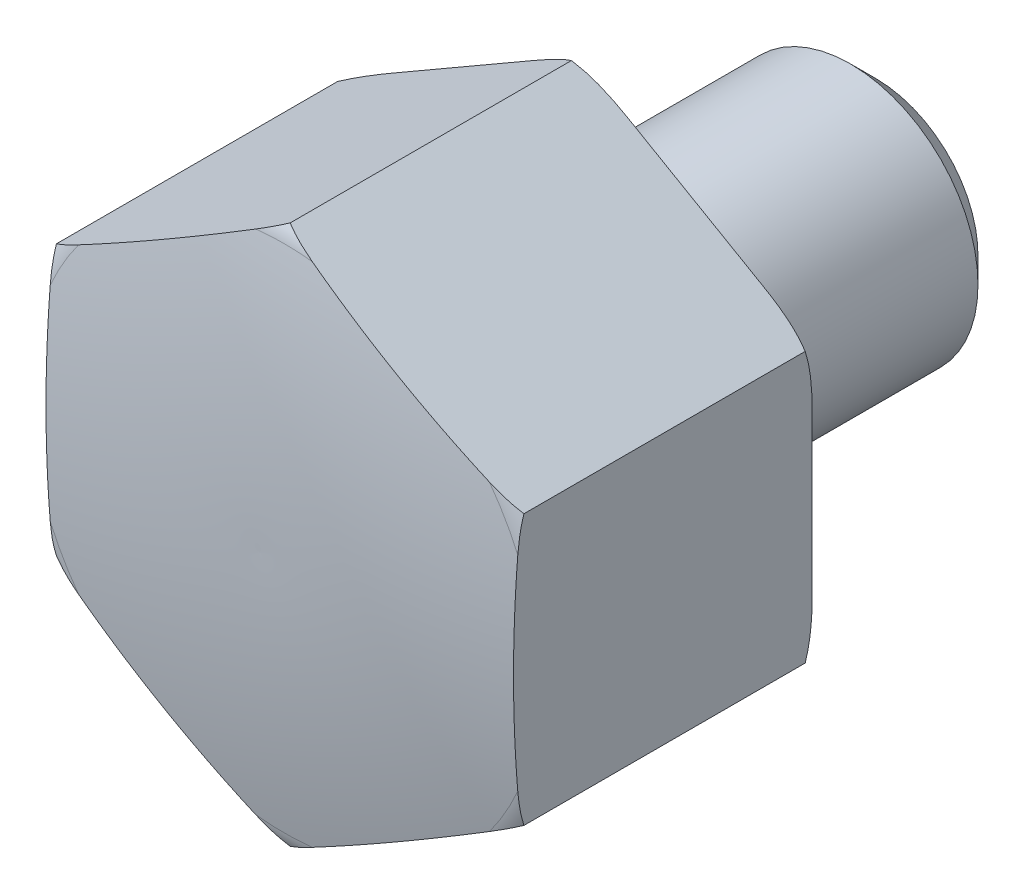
ISO-10303-21;
HEADER;
FILE_DESCRIPTION(('STEP AP214'),'2;1');
FILE_NAME('part.step','',(''),(''),'','','');
FILE_SCHEMA(('AUTOMOTIVE_DESIGN { 1 0 10303 214 1 1 1 1 }'));
ENDSEC;
DATA;
#1=APPLICATION_CONTEXT('core data for automotive mechanical design processes');
#2=APPLICATION_PROTOCOL_DEFINITION('international standard','automotive_design',2000,#1);
#3=PRODUCT_CONTEXT('',#1,'mechanical');
#4=PRODUCT('Part','Part','',(#3));
#5=PRODUCT_RELATED_PRODUCT_CATEGORY('part','',(#4));
#6=PRODUCT_DEFINITION_FORMATION('','',#4);
#7=PRODUCT_DEFINITION_CONTEXT('part definition',#1,'design');
#8=PRODUCT_DEFINITION('design','',#6,#7);
#9=PRODUCT_DEFINITION_SHAPE('','',#8);
#10=(LENGTH_UNIT() NAMED_UNIT(*) SI_UNIT(.MILLI.,.METRE.));
#11=(NAMED_UNIT(*) PLANE_ANGLE_UNIT() SI_UNIT($,.RADIAN.));
#12=(NAMED_UNIT(*) SI_UNIT($,.STERADIAN.) SOLID_ANGLE_UNIT());
#13=UNCERTAINTY_MEASURE_WITH_UNIT(LENGTH_MEASURE(1.E-05),#10,'distance_accuracy_value','');
#14=(GEOMETRIC_REPRESENTATION_CONTEXT(3) GLOBAL_UNCERTAINTY_ASSIGNED_CONTEXT((#13)) GLOBAL_UNIT_ASSIGNED_CONTEXT((#10,
#11,#12)) REPRESENTATION_CONTEXT('',''));
#15=CARTESIAN_POINT('',(0.,0.,0.));
#16=DIRECTION('',(0.,0.,1.));
#17=DIRECTION('',(1.,0.,0.));
#18=AXIS2_PLACEMENT_3D('',#15,#16,#17);
#19=CARTESIAN_POINT('',(0.,0.,2.00000000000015));
#20=DIRECTION('',(0.,0.,-1.));
#21=DIRECTION('',(0.,1.,0.));
#22=AXIS2_PLACEMENT_3D('',#19,#20,#21);
#23=TOROIDAL_SURFACE('',#22,11.5999999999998,2.00000000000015);
#24=CARTESIAN_POINT('',(0.,0.,0.));
#25=DIRECTION('',(0.,0.,-1.));
#26=DIRECTION('',(0.,1.,0.));
#27=AXIS2_PLACEMENT_3D('',#24,#25,#26);
#28=CIRCLE('',#27,11.6);
#29=CARTESIAN_POINT('',(-2.31095625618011,11.3674747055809,0.));
#30=VERTEX_POINT('',#29);
#31=CARTESIAN_POINT('',(2.31095625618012,11.3674747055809,0.));
#32=VERTEX_POINT('',#31);
#33=EDGE_CURVE('E309',#30,#32,#28,.T.);
#34=ORIENTED_EDGE('',*,*,#33,.F.);
#35=CARTESIAN_POINT('',(-11.0001999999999,6.35073749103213,0.330871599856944));
#36=CARTESIAN_POINT('',(-10.9158257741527,6.39945097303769,0.29874534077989));
#37=CARTESIAN_POINT('',(-10.8305838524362,6.44866541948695,0.269839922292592));
#38=CARTESIAN_POINT('',(-10.6588823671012,6.54779731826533,0.217725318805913));
#39=CARTESIAN_POINT('',(-10.5724240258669,6.59771406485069,0.194510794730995));
#40=CARTESIAN_POINT('',(-10.3992093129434,6.69771962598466,0.153109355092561));
#41=CARTESIAN_POINT('',(-10.3124584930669,6.74780523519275,0.134890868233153));
#42=CARTESIAN_POINT('',(-10.1383596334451,6.84832125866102,0.102650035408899));
#43=CARTESIAN_POINT('',(-10.0510114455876,6.89875175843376,0.0886287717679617));
#44=CARTESIAN_POINT('',(-9.78891298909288,7.0500743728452,0.0520689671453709));
#45=CARTESIAN_POINT('',(-9.61359394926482,7.15129486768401,0.0349190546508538));
#46=CARTESIAN_POINT('',(-9.35010257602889,7.30342168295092,0.0171205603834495));
#47=CARTESIAN_POINT('',(-9.26208969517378,7.35423594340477,0.0125080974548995));
#48=CARTESIAN_POINT('',(-9.08599828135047,7.45590236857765,0.00553454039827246));
#49=CARTESIAN_POINT('',(-8.99791975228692,7.50675453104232,0.00317332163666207));
#50=CARTESIAN_POINT('',(-8.72467991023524,7.66450962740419,-0.00126953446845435));
#51=CARTESIAN_POINT('',(-8.53948396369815,7.77143255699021,-0.000176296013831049));
#52=CARTESIAN_POINT('',(-8.16915809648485,7.9852402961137,0.00700842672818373));
#53=CARTESIAN_POINT('',(-7.98402819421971,8.09212509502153,0.0131008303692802));
#54=CARTESIAN_POINT('',(-7.61376513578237,8.30589657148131,0.0274996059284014));
#55=CARTESIAN_POINT('',(-7.4286320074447,8.41278323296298,0.0358068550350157));
#56=CARTESIAN_POINT('',(-7.05837266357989,8.62655256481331,0.0522261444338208));
#57=CARTESIAN_POINT('',(-6.8732464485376,8.73343523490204,0.0603381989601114));
#58=CARTESIAN_POINT('',(-6.50289286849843,8.94725897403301,0.0744335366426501));
#59=CARTESIAN_POINT('',(-6.31766549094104,9.05420005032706,0.080416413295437));
#60=CARTESIAN_POINT('',(-5.9471496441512,9.2681174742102,0.0889344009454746));
#61=CARTESIAN_POINT('',(-5.7618611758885,9.37509382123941,0.0914695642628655));
#62=CARTESIAN_POINT('',(-5.39121547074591,9.58908621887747,0.0925503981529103));
#63=CARTESIAN_POINT('',(-5.20585823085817,9.6961022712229,0.0910947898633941));
#64=CARTESIAN_POINT('',(-4.83518879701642,9.91010836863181,0.0845017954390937));
#65=CARTESIAN_POINT('',(-4.64987660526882,10.0170984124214,0.0793642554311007));
#66=CARTESIAN_POINT('',(-4.27827264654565,10.2316440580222,0.0664888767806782));
#67=CARTESIAN_POINT('',(-4.09198128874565,10.3391994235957,0.0587364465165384));
#68=CARTESIAN_POINT('',(-3.71944098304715,10.5542856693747,0.042456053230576));
#69=CARTESIAN_POINT('',(-3.53319203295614,10.6618165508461,0.0339281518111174));
#70=CARTESIAN_POINT('',(-3.1610772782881,10.8766571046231,0.0184498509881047));
#71=CARTESIAN_POINT('',(-2.97521159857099,10.9839667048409,0.0114958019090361));
#72=CARTESIAN_POINT('',(-2.60330471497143,11.1986872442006,0.00186432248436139));
#73=CARTESIAN_POINT('',(-2.4172634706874,11.3060982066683,-0.000811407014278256));
#74=CARTESIAN_POINT('',(-2.04408158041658,11.5215548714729,0.00125425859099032));
#75=CARTESIAN_POINT('',(-1.85694096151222,11.6296005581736,0.00603976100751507));
#76=CARTESIAN_POINT('',(-1.4832691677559,11.8453400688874,0.0267844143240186));
#77=CARTESIAN_POINT('',(-1.29673752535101,11.9530341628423,0.0427297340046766));
#78=CARTESIAN_POINT('',(-1.01703008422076,12.1145233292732,0.0784814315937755));
#79=CARTESIAN_POINT('',(-0.923298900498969,12.1686390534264,0.0924801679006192));
#80=CARTESIAN_POINT('',(-0.736470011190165,12.2765047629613,0.125154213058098));
#81=CARTESIAN_POINT('',(-0.643372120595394,12.3302548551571,0.143828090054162));
#82=CARTESIAN_POINT('',(-0.457688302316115,12.4374594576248,0.186706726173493));
#83=CARTESIAN_POINT('',(-0.365106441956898,12.4909116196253,0.210935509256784));
#84=CARTESIAN_POINT('',(-0.181287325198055,12.5970396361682,0.265835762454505));
#85=CARTESIAN_POINT('',(-0.0900516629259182,12.6497145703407,0.296514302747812));
#86=CARTESIAN_POINT('',(0.000199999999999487,12.7018213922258,0.330871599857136));
#87=B_SPLINE_CURVE_WITH_KNOTS('',3,(#35,#36,#37,#38,#39,#40,#41,#42,#43,#44,#45,#46,#47,#48,#49,
#50,#51,#52,#53,#54,#55,#56,#57,#58,#59,#60,#61,#62,#63,#64,#65,#66,#67,#68,#69,#70,#71,#72,#73,
#74,#75,#76,#77,#78,#79,#80,#81,#82,#83,#84,#85,#86),.UNSPECIFIED.,.F.,.F.,(4,2,2,2,2,2,2,2,2,2,
2,2,2,2,2,2,2,2,2,2,2,2,2,2,2,4),(0.,0.307623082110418,0.614956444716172,0.920300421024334,
1.22572306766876,1.83475616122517,2.13994387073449,2.44511468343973,3.08654497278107,
3.72809324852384,4.36989598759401,5.01165178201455,5.6535300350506,6.29539854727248,
6.9374727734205,7.57957383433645,8.2253189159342,8.87101274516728,9.51519354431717,
10.15963037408,10.8078912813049,11.4553501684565,11.7826658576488,12.1098814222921,
12.4385397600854,12.7675602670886),.UNSPECIFIED.);
#88=CARTESIAN_POINT('',(0.,12.701705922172,0.330795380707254));
#89=VERTEX_POINT('',#88);
#90=EDGE_CURVE('E151',#30,#89,#87,.T.);
#91=ORIENTED_EDGE('',*,*,#90,.T.);
#92=CARTESIAN_POINT('',(-0.0002,12.7018213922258,0.330871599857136));
#93=CARTESIAN_POINT('',(0.0841742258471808,12.6531079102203,0.298745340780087));
#94=CARTESIAN_POINT('',(0.169416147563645,12.6038934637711,0.269839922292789));
#95=CARTESIAN_POINT('',(0.341117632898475,12.5047615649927,0.217725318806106));
#96=CARTESIAN_POINT('',(0.427575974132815,12.4548448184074,0.194510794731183));
#97=CARTESIAN_POINT('',(0.600790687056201,12.3548392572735,0.153109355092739));
#98=CARTESIAN_POINT('',(0.687541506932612,12.3047536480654,0.134890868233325));
#99=CARTESIAN_POINT('',(0.861640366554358,12.2042376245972,0.102650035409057));
#100=CARTESIAN_POINT('',(0.948988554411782,12.1538071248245,0.0886287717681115));
#101=CARTESIAN_POINT('',(1.21108701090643,12.0024845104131,0.0520689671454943));
#102=CARTESIAN_POINT('',(1.38640605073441,11.9012640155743,0.034919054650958));
#103=CARTESIAN_POINT('',(1.64989742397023,11.7491372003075,0.0171205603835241));
#104=CARTESIAN_POINT('',(1.7379103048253,11.6983229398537,0.012508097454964));
#105=CARTESIAN_POINT('',(1.91400171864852,11.5966565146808,0.00553454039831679));
#106=CARTESIAN_POINT('',(2.00208024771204,11.5458043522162,0.00317332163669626));
#107=CARTESIAN_POINT('',(2.27532008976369,11.3880492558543,-0.00126953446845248));
#108=CARTESIAN_POINT('',(2.4605160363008,11.2811263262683,-0.000176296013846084));
#109=CARTESIAN_POINT('',(2.83084190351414,11.0673185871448,0.00700842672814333));
#110=CARTESIAN_POINT('',(3.0159718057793,10.9604337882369,0.0131008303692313));
#111=CARTESIAN_POINT('',(3.38623486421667,10.7466623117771,0.0274996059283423));
#112=CARTESIAN_POINT('',(3.57136799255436,10.6397756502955,0.0358068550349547));
#113=CARTESIAN_POINT('',(3.94162733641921,10.4260063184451,0.052226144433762));
#114=CARTESIAN_POINT('',(4.12675355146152,10.3191236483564,0.0603381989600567));
#115=CARTESIAN_POINT('',(4.49710713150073,10.1052999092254,0.0744335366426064));
#116=CARTESIAN_POINT('',(4.68233450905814,9.99835883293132,0.0804164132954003));
#117=CARTESIAN_POINT('',(5.05285035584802,9.78444140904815,0.0889344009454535));
#118=CARTESIAN_POINT('',(5.23813882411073,9.67746506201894,0.091469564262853));
#119=CARTESIAN_POINT('',(5.60878452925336,9.46347266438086,0.0925503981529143));
#120=CARTESIAN_POINT('',(5.79414176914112,9.35645661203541,0.0910947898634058));
#121=CARTESIAN_POINT('',(6.1648112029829,9.14245051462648,0.0845017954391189));
#122=CARTESIAN_POINT('',(6.35012339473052,9.03546047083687,0.0793642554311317));
#123=CARTESIAN_POINT('',(6.72172735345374,8.82091482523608,0.0664888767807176));
#124=CARTESIAN_POINT('',(6.90801871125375,8.71335945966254,0.0587364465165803));
#125=CARTESIAN_POINT('',(7.2805590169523,8.49827321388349,0.0424560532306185));
#126=CARTESIAN_POINT('',(7.46680796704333,8.39074233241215,0.0339281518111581));
#127=CARTESIAN_POINT('',(7.83892272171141,8.17590177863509,0.0184498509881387));
#128=CARTESIAN_POINT('',(8.02478840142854,8.06859217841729,0.0114958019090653));
#129=CARTESIAN_POINT('',(8.39669528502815,7.85387163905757,0.00186432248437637));
#130=CARTESIAN_POINT('',(8.58273652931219,7.74646067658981,-0.000811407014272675));
#131=CARTESIAN_POINT('',(8.95591841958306,7.53100401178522,0.00125425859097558));
#132=CARTESIAN_POINT('',(9.14305903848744,7.42295832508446,0.0060397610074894));
#133=CARTESIAN_POINT('',(9.5167308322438,7.20721881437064,0.0267844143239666));
#134=CARTESIAN_POINT('',(9.70326247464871,7.09952472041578,0.0427297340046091));
#135=CARTESIAN_POINT('',(9.98296991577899,6.93803555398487,0.0784814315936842));
#136=CARTESIAN_POINT('',(10.0767010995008,6.88391982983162,0.0924801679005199));
#137=CARTESIAN_POINT('',(10.2635299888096,6.77605412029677,0.125154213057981));
#138=CARTESIAN_POINT('',(10.3566278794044,6.72230402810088,0.143828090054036));
#139=CARTESIAN_POINT('',(10.5423116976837,6.61509942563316,0.186706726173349));
#140=CARTESIAN_POINT('',(10.6348935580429,6.56164726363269,0.210935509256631));
#141=CARTESIAN_POINT('',(10.8187126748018,6.45551924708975,0.265835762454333));
#142=CARTESIAN_POINT('',(10.9099483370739,6.40284431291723,0.29651430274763));
#143=CARTESIAN_POINT('',(11.0001999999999,6.35073749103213,0.330871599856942));
#144=B_SPLINE_CURVE_WITH_KNOTS('',3,(#92,#93,#94,#95,#96,#97,#98,#99,#100,#101,#102,#103,#104,
#105,#106,#107,#108,#109,#110,#111,#112,#113,#114,#115,#116,#117,#118,#119,#120,#121,#122,#123,
#124,#125,#126,#127,#128,#129,#130,#131,#132,#133,#134,#135,#136,#137,#138,#139,#140,#141,#142,
#143),.UNSPECIFIED.,.F.,.F.,(4,2,2,2,2,2,2,2,2,2,2,2,2,2,2,2,2,2,2,2,2,2,2,2,2,4),(0.,
0.307623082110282,0.614956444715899,0.920300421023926,1.22572306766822,1.83475616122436,
2.13994387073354,2.44511468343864,3.08654497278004,3.72809324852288,4.36989598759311,
5.01165178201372,5.65353003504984,6.29539854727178,6.93747277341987,7.57957383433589,
8.22531891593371,8.87101274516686,9.51519354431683,10.1596303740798,10.8078912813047,
11.4553501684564,11.7826658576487,12.109881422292,12.4385397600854,12.7675602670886),.UNSPECIFIED.);
#145=EDGE_CURVE('E373',#89,#32,#144,.T.);
#146=ORIENTED_EDGE('',*,*,#145,.T.);
#147=EDGE_LOOP('',(#34,#91,#146));
#148=FACE_BOUND('',#147,.T.);
#149=ADVANCED_FACE('F14',(#148),#23,.T.);
#150=CARTESIAN_POINT('',(8.68904374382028,7.68508417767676,0.));
#151=VERTEX_POINT('',#150);
#152=CARTESIAN_POINT('',(11.,3.68239052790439,0.));
#153=VERTEX_POINT('',#152);
#154=EDGE_CURVE('E312',#151,#153,#28,.T.);
#155=ORIENTED_EDGE('',*,*,#154,.F.);
#156=CARTESIAN_POINT('',(11.,6.3508529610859,0.330795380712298));
#157=VERTEX_POINT('',#156);
#158=EDGE_CURVE('E340',#151,#157,#144,.T.);
#159=ORIENTED_EDGE('',*,*,#158,.T.);
#160=CARTESIAN_POINT('',(11.,0.,0.092121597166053));
#161=CARTESIAN_POINT('',(11.,-0.166803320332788,0.0921251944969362));
#162=CARTESIAN_POINT('',(11.,-0.333605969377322,0.0909162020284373));
#163=CARTESIAN_POINT('',(11.,-0.66718008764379,0.0862464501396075));
#164=CARTESIAN_POINT('',(11.,-0.833951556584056,0.0827856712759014));
#165=CARTESIAN_POINT('',(11.,-1.16750102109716,0.0740653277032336));
#166=CARTESIAN_POINT('',(11.,-1.33427900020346,0.0688051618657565));
#167=CARTESIAN_POINT('',(11.,-1.66779552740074,0.0572108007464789));
#168=CARTESIAN_POINT('',(11.,-1.83453407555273,0.0508766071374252));
#169=CARTESIAN_POINT('',(11.,-2.16780802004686,0.0380819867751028));
#170=CARTESIAN_POINT('',(11.,-2.33434342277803,0.0316217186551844));
#171=CARTESIAN_POINT('',(11.,-2.66744853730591,0.0196794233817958));
#172=CARTESIAN_POINT('',(11.,-2.83401824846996,0.0141973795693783));
#173=CARTESIAN_POINT('',(11.,-3.16714902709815,0.00547123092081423));
#174=CARTESIAN_POINT('',(11.,-3.33371006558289,0.00222613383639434));
#175=CARTESIAN_POINT('',(11.,-3.6668581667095,-0.000628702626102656));
#176=CARTESIAN_POINT('',(11.,-3.83344522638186,-0.000238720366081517));
#177=CARTESIAN_POINT('',(11.,-4.22683090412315,0.00680238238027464));
#178=CARTESIAN_POINT('',(11.,-4.45360192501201,0.0156683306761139));
#179=CARTESIAN_POINT('',(11.,-4.9073047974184,0.0476165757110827));
#180=CARTESIAN_POINT('',(11.,-5.13423282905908,0.0707623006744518));
#181=CARTESIAN_POINT('',(11.,-5.50857771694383,0.12579811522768));
#182=CARTESIAN_POINT('',(11.,-5.65680935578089,0.152044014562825));
#183=CARTESIAN_POINT('',(11.,-5.9511434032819,0.215354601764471));
#184=CARTESIAN_POINT('',(11.,-6.09724395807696,0.252428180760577));
#185=CARTESIAN_POINT('',(11.,-6.38441677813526,0.339534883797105));
#186=CARTESIAN_POINT('',(11.,-6.52551846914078,0.389469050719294));
#187=CARTESIAN_POINT('',(11.,-6.800877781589,0.505324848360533));
#188=CARTESIAN_POINT('',(11.,-6.93515063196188,0.571208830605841));
#189=CARTESIAN_POINT('',(11.,-7.14508713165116,0.694680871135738));
#190=CARTESIAN_POINT('',(11.,-7.22416927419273,0.746433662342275));
#191=CARTESIAN_POINT('',(11.,-7.37601788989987,0.858763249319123));
#192=CARTESIAN_POINT('',(11.,-7.44877882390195,0.919347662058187));
#193=CARTESIAN_POINT('',(11.,-7.58594623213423,1.05069333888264));
#194=CARTESIAN_POINT('',(11.,-7.65026675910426,1.12154582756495));
#195=CARTESIAN_POINT('',(11.,-7.76598418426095,1.27315886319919));
#196=CARTESIAN_POINT('',(11.,-7.81740644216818,1.35389949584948));
#197=CARTESIAN_POINT('',(11.,-7.89182810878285,1.5019490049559));
#198=CARTESIAN_POINT('',(11.,-7.91874177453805,1.56728418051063));
#199=CARTESIAN_POINT('',(11.,-7.96137411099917,1.70152289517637));
#200=CARTESIAN_POINT('',(11.,-7.97710189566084,1.77042348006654));
#201=CARTESIAN_POINT('',(11.,-7.99617622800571,1.91023874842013));
#202=CARTESIAN_POINT('',(11.,-7.99947088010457,1.98116063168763));
#203=CARTESIAN_POINT('',(11.,-7.99324628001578,2.12244168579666));
#204=CARTESIAN_POINT('',(11.,-7.9837253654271,2.192800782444));
#205=CARTESIAN_POINT('',(11.,-7.95358375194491,2.326761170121));
#206=CARTESIAN_POINT('',(11.,-7.93363837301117,2.39051778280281));
#207=CARTESIAN_POINT('',(11.,-7.88441469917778,2.51427786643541));
#208=CARTESIAN_POINT('',(11.,-7.85513368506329,2.57428023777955));
#209=CARTESIAN_POINT('',(11.,-7.77447876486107,2.71459875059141));
#210=CARTESIAN_POINT('',(11.,-7.71901803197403,2.79256494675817));
#211=CARTESIAN_POINT('',(11.,-7.59632221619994,2.93862878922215));
#212=CARTESIAN_POINT('',(11.,-7.52905759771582,3.00670087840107));
#213=CARTESIAN_POINT('',(11.,-7.34887519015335,3.16637702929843));
#214=CARTESIAN_POINT('',(11.,-7.23045052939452,3.25172483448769));
#215=CARTESIAN_POINT('',(11.,-6.982285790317,3.40347860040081));
#216=CARTESIAN_POINT('',(11.,-6.85253063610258,3.46985880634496));
#217=CARTESIAN_POINT('',(11.,-6.59864877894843,3.58154125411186));
#218=CARTESIAN_POINT('',(11.,-6.47511710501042,3.62822783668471));
#219=CARTESIAN_POINT('',(11.,-6.22445126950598,3.71088652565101));
#220=CARTESIAN_POINT('',(11.,-6.097313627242,3.74684786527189));
#221=CARTESIAN_POINT('',(11.,-5.84042946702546,3.80990007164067));
#222=CARTESIAN_POINT('',(11.,-5.71067545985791,3.8369598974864));
#223=CARTESIAN_POINT('',(11.,-5.51512889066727,3.87188730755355));
#224=CARTESIAN_POINT('',(11.,-5.44982099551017,3.88258283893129));
#225=CARTESIAN_POINT('',(11.,-5.31895147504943,3.90225708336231));
#226=CARTESIAN_POINT('',(11.,-5.25338986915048,3.9112359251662));
#227=CARTESIAN_POINT('',(11.,-5.03839742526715,3.93808577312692));
#228=CARTESIAN_POINT('',(11.,-4.88855675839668,3.95270732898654));
#229=CARTESIAN_POINT('',(11.,-4.58837359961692,3.97551292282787));
#230=CARTESIAN_POINT('',(11.,-4.43803096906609,3.9836950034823));
#231=CARTESIAN_POINT('',(11.,-4.13699274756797,3.99502058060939));
#232=CARTESIAN_POINT('',(11.,-3.98629694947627,3.99815820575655));
#233=CARTESIAN_POINT('',(11.,-3.68490122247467,4.00061441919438));
#234=CARTESIAN_POINT('',(11.,-3.53420129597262,3.99993344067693));
#235=CARTESIAN_POINT('',(11.,-3.08101312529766,3.99385100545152));
#236=CARTESIAN_POINT('',(11.,-2.77859383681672,3.98438430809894));
#237=CARTESIAN_POINT('',(11.,-2.17385986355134,3.96253855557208));
#238=CARTESIAN_POINT('',(11.,-1.87154519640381,3.95015913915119));
#239=CARTESIAN_POINT('',(11.,-1.41709733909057,3.93397244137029));
#240=CARTESIAN_POINT('',(11.,-1.26501322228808,3.92896300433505));
#241=CARTESIAN_POINT('',(11.,-0.960806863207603,3.92031374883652));
#242=CARTESIAN_POINT('',(11.,-0.808684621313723,3.91667391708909));
#243=CARTESIAN_POINT('',(11.,-0.504403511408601,3.91117545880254));
#244=CARTESIAN_POINT('',(11.,-0.352244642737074,3.90931686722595));
#245=CARTESIAN_POINT('',(11.,-0.04791429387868,3.90758243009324));
#246=CARTESIAN_POINT('',(11.,0.104257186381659,3.90770659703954));
#247=CARTESIAN_POINT('',(11.,0.408307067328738,3.90992260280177));
#248=CARTESIAN_POINT('',(11.,0.560185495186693,3.9120108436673));
#249=CARTESIAN_POINT('',(11.,0.863907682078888,3.91792189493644));
#250=CARTESIAN_POINT('',(11.,1.01575144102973,3.92174470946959));
#251=CARTESIAN_POINT('',(11.,1.31941148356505,3.93069989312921));
#252=CARTESIAN_POINT('',(11.,1.47122776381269,3.93583237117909));
#253=CARTESIAN_POINT('',(11.,1.77483390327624,3.94681026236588));
#254=CARTESIAN_POINT('',(11.,1.92662376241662,3.95265567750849));
#255=CARTESIAN_POINT('',(11.,2.22975290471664,3.96430411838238));
#256=CARTESIAN_POINT('',(11.,2.38109218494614,3.97010721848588));
#257=CARTESIAN_POINT('',(11.,2.68380028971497,3.98084177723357));
#258=CARTESIAN_POINT('',(11.,2.83516911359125,3.98577325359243));
#259=CARTESIAN_POINT('',(11.,3.13813939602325,3.99382318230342));
#260=CARTESIAN_POINT('',(11.,3.28974091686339,3.99693946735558));
#261=CARTESIAN_POINT('',(11.,3.5929794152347,4.00030320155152));
#262=CARTESIAN_POINT('',(11.,3.74461639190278,4.00055071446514));
#263=CARTESIAN_POINT('',(11.,4.04691129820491,3.99703420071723));
#264=CARTESIAN_POINT('',(11.,4.197569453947,3.99329510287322));
#265=CARTESIAN_POINT('',(11.,4.49866089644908,3.98058401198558));
#266=CARTESIAN_POINT('',(11.,4.64909421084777,3.97161272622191));
#267=CARTESIAN_POINT('',(11.,4.9491904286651,3.94702959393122));
#268=CARTESIAN_POINT('',(11.,5.09885418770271,3.93142858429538));
#269=CARTESIAN_POINT('',(11.,5.39706339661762,3.89195135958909));
#270=CARTESIAN_POINT('',(11.,5.54560932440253,3.86807891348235));
#271=CARTESIAN_POINT('',(11.,5.79769474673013,3.81855728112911));
#272=CARTESIAN_POINT('',(11.,5.90173189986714,3.79545429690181));
#273=CARTESIAN_POINT('',(11.,6.1083567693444,3.74328382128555));
#274=CARTESIAN_POINT('',(11.,6.21094401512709,3.71421443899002));
#275=CARTESIAN_POINT('',(11.,6.41385708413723,3.64920228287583));
#276=CARTESIAN_POINT('',(11.,6.51418462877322,3.61326495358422));
#277=CARTESIAN_POINT('',(11.,6.71158830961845,3.5334440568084));
#278=CARTESIAN_POINT('',(11.,6.80866661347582,3.48956591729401));
#279=CARTESIAN_POINT('',(11.,7.00820773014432,3.38749543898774));
#280=CARTESIAN_POINT('',(11.,7.11015726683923,3.32828104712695));
#281=CARTESIAN_POINT('',(11.,7.30536999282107,3.19682380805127));
#282=CARTESIAN_POINT('',(11.,7.39864228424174,3.12459485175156));
#283=CARTESIAN_POINT('',(11.,7.55336712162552,2.98255957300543));
#284=CARTESIAN_POINT('',(11.,7.61735706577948,2.91554446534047));
#285=CARTESIAN_POINT('',(11.,7.7339241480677,2.77217553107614));
#286=CARTESIAN_POINT('',(11.,7.78651888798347,2.69583639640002));
#287=CARTESIAN_POINT('',(11.,7.8665396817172,2.55227691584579));
#288=CARTESIAN_POINT('',(11.,7.89695624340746,2.48673313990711));
#289=CARTESIAN_POINT('',(11.,7.9465395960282,2.35149756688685));
#290=CARTESIAN_POINT('',(11.,7.96571497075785,2.28180897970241));
#291=CARTESIAN_POINT('',(11.,7.99138067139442,2.13971177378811));
#292=CARTESIAN_POINT('',(11.,7.99780336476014,2.06729071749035));
#293=CARTESIAN_POINT('',(11.,7.99717373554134,1.92250863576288));
#294=CARTESIAN_POINT('',(11.,7.99012239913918,1.85014760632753));
#295=CARTESIAN_POINT('',(11.,7.96427754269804,1.7136192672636));
#296=CARTESIAN_POINT('',(11.,7.94647063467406,1.64926012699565));
#297=CARTESIAN_POINT('',(11.,7.90122794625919,1.52405314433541));
#298=CARTESIAN_POINT('',(11.,7.87378870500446,1.46320657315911));
#299=CARTESIAN_POINT('',(11.,7.79850034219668,1.32307208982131));
#300=CARTESIAN_POINT('',(11.,7.74686400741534,1.24582083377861));
#301=CARTESIAN_POINT('',(11.,7.63185243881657,1.10063329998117));
#302=CARTESIAN_POINT('',(11.,7.56845243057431,1.03271721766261));
#303=CARTESIAN_POINT('',(11.,7.39932861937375,0.874255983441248));
#304=CARTESIAN_POINT('',(11.,7.28830617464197,0.789403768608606));
#305=CARTESIAN_POINT('',(11.,7.05476556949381,0.637556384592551));
#306=CARTESIAN_POINT('',(11.,6.93222325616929,0.570599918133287));
#307=CARTESIAN_POINT('',(11.,6.69388358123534,0.458131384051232));
#308=CARTESIAN_POINT('',(11.,6.57879562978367,0.411081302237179));
#309=CARTESIAN_POINT('',(11.,6.34496197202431,0.327013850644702));
#310=CARTESIAN_POINT('',(11.,6.22621326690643,0.290004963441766));
#311=CARTESIAN_POINT('',(11.,5.98626183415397,0.22443502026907));
#312=CARTESIAN_POINT('',(11.,5.86505580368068,0.195886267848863));
#313=CARTESIAN_POINT('',(11.,5.62115904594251,0.145961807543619));
#314=CARTESIAN_POINT('',(11.,5.49846779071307,0.124588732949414));
#315=CARTESIAN_POINT('',(11.,5.15455221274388,0.073297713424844));
#316=CARTESIAN_POINT('',(11.,4.93234067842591,0.0500428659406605));
#317=CARTESIAN_POINT('',(11.,4.48688752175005,0.0174325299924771));
#318=CARTESIAN_POINT('',(11.,4.26364527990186,0.00808692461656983));
#319=CARTESIAN_POINT('',(11.,3.81689628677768,-0.00105686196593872));
#320=CARTESIAN_POINT('',(11.,3.59338945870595,-0.000850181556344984));
#321=CARTESIAN_POINT('',(11.,3.1464554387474,0.00540104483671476));
#322=CARTESIAN_POINT('',(11.,2.92302826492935,0.011446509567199));
#323=CARTESIAN_POINT('',(11.,2.47456190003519,0.0262055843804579));
#324=CARTESIAN_POINT('',(11.,2.24952345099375,0.03493924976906));
#325=CARTESIAN_POINT('',(11.,1.7994249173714,0.0522293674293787));
#326=CARTESIAN_POINT('',(11.,1.57436483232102,0.0607858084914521));
#327=CARTESIAN_POINT('',(11.,1.12445564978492,0.0754586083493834));
#328=CARTESIAN_POINT('',(11.,0.899606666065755,0.0815781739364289));
#329=CARTESIAN_POINT('',(11.,0.449838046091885,0.0899071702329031));
#330=CARTESIAN_POINT('',(11.,0.224918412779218,0.0921167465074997));
#331=CARTESIAN_POINT('',(11.,0.,0.092121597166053));
#332=B_SPLINE_CURVE_WITH_KNOTS('',3,(#160,#161,#162,#163,#164,#165,#166,#167,#168,#169,#170,
#171,#172,#173,#174,#175,#176,#177,#178,#179,#180,#181,#182,#183,#184,#185,#186,#187,#188,#189,
#190,#191,#192,#193,#194,#195,#196,#197,#198,#199,#200,#201,#202,#203,#204,#205,#206,#207,#208,
#209,#210,#211,#212,#213,#214,#215,#216,#217,#218,#219,#220,#221,#222,#223,#224,#225,#226,#227,
#228,#229,#230,#231,#232,#233,#234,#235,#236,#237,#238,#239,#240,#241,#242,#243,#244,#245,#246,
#247,#248,#249,#250,#251,#252,#253,#254,#255,#256,#257,#258,#259,#260,#261,#262,#263,#264,#265,
#266,#267,#268,#269,#270,#271,#272,#273,#274,#275,#276,#277,#278,#279,#280,#281,#282,#283,#284,
#285,#286,#287,#288,#289,#290,#291,#292,#293,#294,#295,#296,#297,#298,#299,#300,#301,#302,#303,
#304,#305,#306,#307,#308,#309,#310,#311,#312,#313,#314,#315,#316,#317,#318,#319,#320,#321,#322,
#323,#324,#325,#326,#327,#328,#329,#330,#331),.UNSPECIFIED.,.T.,.F.,(4,2,2,2,2,2,2,2,2,2,2,2,2,
2,2,2,2,2,2,2,2,2,2,2,2,2,2,2,2,2,2,2,2,2,2,2,2,2,2,2,2,2,2,2,2,2,2,2,2,2,2,2,2,2,2,2,2,2,2,2,2,
2,2,2,2,2,2,2,2,2,2,2,2,2,2,2,2,2,2,2,2,2,2,2,2,4),(0.,0.500404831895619,1.00081398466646,
1.50139047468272,2.00196618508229,2.50194817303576,3.00192164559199,3.50167320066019,
4.0013864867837,4.68194588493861,5.36555018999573,5.81685580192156,6.26853304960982,
6.71683357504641,7.16408606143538,7.44712965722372,7.73041882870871,8.01639963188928,
8.30181367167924,8.51294124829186,8.72389660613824,8.9357315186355,9.14759391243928,
9.34717689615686,9.54681806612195,9.83224382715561,10.1183942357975,10.5538633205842,
10.9899209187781,11.3855142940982,11.781503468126,12.1788592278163,12.3773748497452,
12.5758755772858,13.0273332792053,13.4789281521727,13.9310482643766,14.383117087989,
15.2907249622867,16.1984454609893,16.6549393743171,17.1114288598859,17.5679273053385,
18.024428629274,18.4800953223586,18.935763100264,19.3914687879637,19.8471757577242,
20.3015270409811,20.7558690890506,21.2107525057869,21.6656258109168,22.1176713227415,
22.5696557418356,23.0209041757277,23.4719472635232,23.7915174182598,24.1111890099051,
24.430608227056,24.7498099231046,25.1027050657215,25.4552257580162,25.7322839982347,
26.0089111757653,26.2248174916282,26.440558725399,26.6574410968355,26.8743075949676,
27.0737892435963,27.2733426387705,27.5505428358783,27.8283335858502,28.2451940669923,
28.6629489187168,29.0354060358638,29.4081768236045,29.7814870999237,30.1549342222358,
30.8245063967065,31.4945541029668,32.1649428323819,32.8354370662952,33.5110600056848,
34.1867255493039,34.8614989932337,35.5362473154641),.UNSPECIFIED.);
#333=EDGE_CURVE('E341',#157,#153,#332,.T.);
#334=ORIENTED_EDGE('',*,*,#333,.T.);
#335=EDGE_LOOP('',(#155,#159,#334));
#336=FACE_BOUND('',#335,.T.);
#337=ADVANCED_FACE('F339',(#336),#23,.T.);
#338=CARTESIAN_POINT('',(11.,-3.68239052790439,0.));
#339=VERTEX_POINT('',#338);
#340=CARTESIAN_POINT('',(8.68904374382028,-7.68508417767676,0.));
#341=VERTEX_POINT('',#340);
#342=EDGE_CURVE('E342',#339,#341,#28,.T.);
#343=ORIENTED_EDGE('',*,*,#342,.F.);
#344=CARTESIAN_POINT('',(11.,-6.3508529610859,0.330795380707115));
#345=VERTEX_POINT('',#344);
#346=EDGE_CURVE('E405',#339,#345,#332,.T.);
#347=ORIENTED_EDGE('',*,*,#346,.T.);
#348=CARTESIAN_POINT('',(11.0001999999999,-6.35073749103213,0.330871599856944));
#349=CARTESIAN_POINT('',(10.9158257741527,-6.39945097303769,0.29874534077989));
#350=CARTESIAN_POINT('',(10.8305838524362,-6.44866541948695,0.269839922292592));
#351=CARTESIAN_POINT('',(10.6588823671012,-6.54779731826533,0.217725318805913));
#352=CARTESIAN_POINT('',(10.5724240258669,-6.59771406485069,0.194510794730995));
#353=CARTESIAN_POINT('',(10.3992093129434,-6.69771962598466,0.153109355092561));
#354=CARTESIAN_POINT('',(10.3124584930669,-6.74780523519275,0.134890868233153));
#355=CARTESIAN_POINT('',(10.1383596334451,-6.84832125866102,0.102650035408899));
#356=CARTESIAN_POINT('',(10.0510114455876,-6.89875175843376,0.0886287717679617));
#357=CARTESIAN_POINT('',(9.78891298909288,-7.0500743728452,0.0520689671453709));
#358=CARTESIAN_POINT('',(9.61359394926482,-7.15129486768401,0.0349190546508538));
#359=CARTESIAN_POINT('',(9.35010257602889,-7.30342168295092,0.0171205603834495));
#360=CARTESIAN_POINT('',(9.26208969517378,-7.35423594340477,0.0125080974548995));
#361=CARTESIAN_POINT('',(9.08599828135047,-7.45590236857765,0.00553454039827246));
#362=CARTESIAN_POINT('',(8.99791975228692,-7.50675453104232,0.00317332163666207));
#363=CARTESIAN_POINT('',(8.72467991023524,-7.66450962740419,-0.00126953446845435));
#364=CARTESIAN_POINT('',(8.53948396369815,-7.77143255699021,-0.000176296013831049));
#365=CARTESIAN_POINT('',(8.16915809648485,-7.9852402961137,0.00700842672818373));
#366=CARTESIAN_POINT('',(7.98402819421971,-8.09212509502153,0.0131008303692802));
#367=CARTESIAN_POINT('',(7.61376513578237,-8.30589657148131,0.0274996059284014));
#368=CARTESIAN_POINT('',(7.4286320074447,-8.41278323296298,0.0358068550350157));
#369=CARTESIAN_POINT('',(7.05837266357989,-8.62655256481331,0.0522261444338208));
#370=CARTESIAN_POINT('',(6.8732464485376,-8.73343523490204,0.0603381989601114));
#371=CARTESIAN_POINT('',(6.50289286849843,-8.94725897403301,0.0744335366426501));
#372=CARTESIAN_POINT('',(6.31766549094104,-9.05420005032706,0.080416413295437));
#373=CARTESIAN_POINT('',(5.9471496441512,-9.2681174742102,0.0889344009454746));
#374=CARTESIAN_POINT('',(5.7618611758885,-9.37509382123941,0.0914695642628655));
#375=CARTESIAN_POINT('',(5.39121547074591,-9.58908621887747,0.0925503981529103));
#376=CARTESIAN_POINT('',(5.20585823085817,-9.6961022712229,0.0910947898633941));
#377=CARTESIAN_POINT('',(4.83518879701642,-9.91010836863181,0.0845017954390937));
#378=CARTESIAN_POINT('',(4.64987660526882,-10.0170984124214,0.0793642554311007));
#379=CARTESIAN_POINT('',(4.27827264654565,-10.2316440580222,0.0664888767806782));
#380=CARTESIAN_POINT('',(4.09198128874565,-10.3391994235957,0.0587364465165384));
#381=CARTESIAN_POINT('',(3.71944098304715,-10.5542856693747,0.042456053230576));
#382=CARTESIAN_POINT('',(3.53319203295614,-10.6618165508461,0.0339281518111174));
#383=CARTESIAN_POINT('',(3.1610772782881,-10.8766571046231,0.0184498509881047));
#384=CARTESIAN_POINT('',(2.97521159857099,-10.9839667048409,0.0114958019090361));
#385=CARTESIAN_POINT('',(2.60330471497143,-11.1986872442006,0.00186432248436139));
#386=CARTESIAN_POINT('',(2.4172634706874,-11.3060982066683,-0.000811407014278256));
#387=CARTESIAN_POINT('',(2.04408158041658,-11.5215548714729,0.00125425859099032));
#388=CARTESIAN_POINT('',(1.85694096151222,-11.6296005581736,0.00603976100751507));
#389=CARTESIAN_POINT('',(1.4832691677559,-11.8453400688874,0.0267844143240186));
#390=CARTESIAN_POINT('',(1.29673752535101,-11.9530341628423,0.0427297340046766));
#391=CARTESIAN_POINT('',(1.01703008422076,-12.1145233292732,0.0784814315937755));
#392=CARTESIAN_POINT('',(0.923298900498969,-12.1686390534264,0.0924801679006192));
#393=CARTESIAN_POINT('',(0.736470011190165,-12.2765047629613,0.125154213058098));
#394=CARTESIAN_POINT('',(0.643372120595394,-12.3302548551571,0.143828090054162));
#395=CARTESIAN_POINT('',(0.457688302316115,-12.4374594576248,0.186706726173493));
#396=CARTESIAN_POINT('',(0.365106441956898,-12.4909116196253,0.210935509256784));
#397=CARTESIAN_POINT('',(0.181287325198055,-12.5970396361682,0.265835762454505));
#398=CARTESIAN_POINT('',(0.0900516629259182,-12.6497145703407,0.296514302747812));
#399=CARTESIAN_POINT('',(-0.000199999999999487,-12.7018213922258,0.330871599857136));
#400=B_SPLINE_CURVE_WITH_KNOTS('',3,(#348,#349,#350,#351,#352,#353,#354,#355,#356,#357,#358,
#359,#360,#361,#362,#363,#364,#365,#366,#367,#368,#369,#370,#371,#372,#373,#374,#375,#376,#377,
#378,#379,#380,#381,#382,#383,#384,#385,#386,#387,#388,#389,#390,#391,#392,#393,#394,#395,#396,
#397,#398,#399),.UNSPECIFIED.,.F.,.F.,(4,2,2,2,2,2,2,2,2,2,2,2,2,2,2,2,2,2,2,2,2,2,2,2,2,4),(0.,
0.307623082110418,0.614956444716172,0.920300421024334,1.22572306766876,1.83475616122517,
2.13994387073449,2.44511468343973,3.08654497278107,3.72809324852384,4.36989598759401,
5.01165178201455,5.6535300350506,6.29539854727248,6.9374727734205,7.57957383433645,
8.2253189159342,8.87101274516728,9.51519354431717,10.15963037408,10.8078912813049,
11.4553501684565,11.7826658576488,12.1098814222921,12.4385397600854,12.7675602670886),.UNSPECIFIED.);
#401=EDGE_CURVE('E419',#345,#341,#400,.T.);
#402=ORIENTED_EDGE('',*,*,#401,.T.);
#403=EDGE_LOOP('',(#343,#347,#402));
#404=FACE_BOUND('',#403,.T.);
#405=ADVANCED_FACE('F463',(#404),#23,.T.);
#406=CARTESIAN_POINT('',(2.31095625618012,-11.3674747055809,0.));
#407=VERTEX_POINT('',#406);
#408=CARTESIAN_POINT('',(-2.31095625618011,-11.3674747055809,0.));
#409=VERTEX_POINT('',#408);
#410=EDGE_CURVE('E344',#407,#409,#28,.T.);
#411=ORIENTED_EDGE('',*,*,#410,.F.);
#412=CARTESIAN_POINT('',(0.,-12.701705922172,0.330795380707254));
#413=VERTEX_POINT('',#412);
#414=EDGE_CURVE('E430',#407,#413,#400,.T.);
#415=ORIENTED_EDGE('',*,*,#414,.T.);
#416=CARTESIAN_POINT('',(0.0002,-12.7018213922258,0.330871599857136));
#417=CARTESIAN_POINT('',(-0.0841742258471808,-12.6531079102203,0.298745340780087));
#418=CARTESIAN_POINT('',(-0.169416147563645,-12.6038934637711,0.269839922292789));
#419=CARTESIAN_POINT('',(-0.341117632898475,-12.5047615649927,0.217725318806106));
#420=CARTESIAN_POINT('',(-0.427575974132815,-12.4548448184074,0.194510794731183));
#421=CARTESIAN_POINT('',(-0.600790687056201,-12.3548392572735,0.153109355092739));
#422=CARTESIAN_POINT('',(-0.687541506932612,-12.3047536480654,0.134890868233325));
#423=CARTESIAN_POINT('',(-0.861640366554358,-12.2042376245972,0.102650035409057));
#424=CARTESIAN_POINT('',(-0.948988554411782,-12.1538071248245,0.0886287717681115));
#425=CARTESIAN_POINT('',(-1.21108701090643,-12.0024845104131,0.0520689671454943));
#426=CARTESIAN_POINT('',(-1.38640605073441,-11.9012640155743,0.034919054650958));
#427=CARTESIAN_POINT('',(-1.64989742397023,-11.7491372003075,0.0171205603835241));
#428=CARTESIAN_POINT('',(-1.7379103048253,-11.6983229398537,0.012508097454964));
#429=CARTESIAN_POINT('',(-1.91400171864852,-11.5966565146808,0.00553454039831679));
#430=CARTESIAN_POINT('',(-2.00208024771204,-11.5458043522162,0.00317332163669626));
#431=CARTESIAN_POINT('',(-2.27532008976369,-11.3880492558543,-0.00126953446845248));
#432=CARTESIAN_POINT('',(-2.4605160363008,-11.2811263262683,-0.000176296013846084));
#433=CARTESIAN_POINT('',(-2.83084190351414,-11.0673185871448,0.00700842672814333));
#434=CARTESIAN_POINT('',(-3.0159718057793,-10.9604337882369,0.0131008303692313));
#435=CARTESIAN_POINT('',(-3.38623486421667,-10.7466623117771,0.0274996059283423));
#436=CARTESIAN_POINT('',(-3.57136799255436,-10.6397756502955,0.0358068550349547));
#437=CARTESIAN_POINT('',(-3.94162733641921,-10.4260063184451,0.052226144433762));
#438=CARTESIAN_POINT('',(-4.12675355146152,-10.3191236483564,0.0603381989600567));
#439=CARTESIAN_POINT('',(-4.49710713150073,-10.1052999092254,0.0744335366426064));
#440=CARTESIAN_POINT('',(-4.68233450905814,-9.99835883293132,0.0804164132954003));
#441=CARTESIAN_POINT('',(-5.05285035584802,-9.78444140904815,0.0889344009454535));
#442=CARTESIAN_POINT('',(-5.23813882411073,-9.67746506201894,0.091469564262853));
#443=CARTESIAN_POINT('',(-5.60878452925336,-9.46347266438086,0.0925503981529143));
#444=CARTESIAN_POINT('',(-5.79414176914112,-9.35645661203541,0.0910947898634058));
#445=CARTESIAN_POINT('',(-6.1648112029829,-9.14245051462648,0.0845017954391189));
#446=CARTESIAN_POINT('',(-6.35012339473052,-9.03546047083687,0.0793642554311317));
#447=CARTESIAN_POINT('',(-6.72172735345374,-8.82091482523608,0.0664888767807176));
#448=CARTESIAN_POINT('',(-6.90801871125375,-8.71335945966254,0.0587364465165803));
#449=CARTESIAN_POINT('',(-7.2805590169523,-8.49827321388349,0.0424560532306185));
#450=CARTESIAN_POINT('',(-7.46680796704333,-8.39074233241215,0.0339281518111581));
#451=CARTESIAN_POINT('',(-7.83892272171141,-8.17590177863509,0.0184498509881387));
#452=CARTESIAN_POINT('',(-8.02478840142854,-8.06859217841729,0.0114958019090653));
#453=CARTESIAN_POINT('',(-8.39669528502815,-7.85387163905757,0.00186432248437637));
#454=CARTESIAN_POINT('',(-8.58273652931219,-7.74646067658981,-0.000811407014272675));
#455=CARTESIAN_POINT('',(-8.95591841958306,-7.53100401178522,0.00125425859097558));
#456=CARTESIAN_POINT('',(-9.14305903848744,-7.42295832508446,0.0060397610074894));
#457=CARTESIAN_POINT('',(-9.5167308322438,-7.20721881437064,0.0267844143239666));
#458=CARTESIAN_POINT('',(-9.70326247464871,-7.09952472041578,0.0427297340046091));
#459=CARTESIAN_POINT('',(-9.98296991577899,-6.93803555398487,0.0784814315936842));
#460=CARTESIAN_POINT('',(-10.0767010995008,-6.88391982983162,0.0924801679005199));
#461=CARTESIAN_POINT('',(-10.2635299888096,-6.77605412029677,0.125154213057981));
#462=CARTESIAN_POINT('',(-10.3566278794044,-6.72230402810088,0.143828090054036));
#463=CARTESIAN_POINT('',(-10.5423116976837,-6.61509942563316,0.186706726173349));
#464=CARTESIAN_POINT('',(-10.6348935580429,-6.56164726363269,0.210935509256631));
#465=CARTESIAN_POINT('',(-10.8187126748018,-6.45551924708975,0.265835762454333));
#466=CARTESIAN_POINT('',(-10.9099483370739,-6.40284431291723,0.29651430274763));
#467=CARTESIAN_POINT('',(-11.0001999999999,-6.35073749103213,0.330871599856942));
#468=B_SPLINE_CURVE_WITH_KNOTS('',3,(#416,#417,#418,#419,#420,#421,#422,#423,#424,#425,#426,
#427,#428,#429,#430,#431,#432,#433,#434,#435,#436,#437,#438,#439,#440,#441,#442,#443,#444,#445,
#446,#447,#448,#449,#450,#451,#452,#453,#454,#455,#456,#457,#458,#459,#460,#461,#462,#463,#464,
#465,#466,#467),.UNSPECIFIED.,.F.,.F.,(4,2,2,2,2,2,2,2,2,2,2,2,2,2,2,2,2,2,2,2,2,2,2,2,2,4),(0.,
0.307623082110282,0.614956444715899,0.920300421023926,1.22572306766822,1.83475616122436,
2.13994387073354,2.44511468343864,3.08654497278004,3.72809324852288,4.36989598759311,
5.01165178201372,5.65353003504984,6.29539854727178,6.93747277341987,7.57957383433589,
8.22531891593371,8.87101274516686,9.51519354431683,10.1596303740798,10.8078912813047,
11.4553501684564,11.7826658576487,12.109881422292,12.4385397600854,12.7675602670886),.UNSPECIFIED.);
#469=EDGE_CURVE('E200',#413,#409,#468,.T.);
#470=ORIENTED_EDGE('',*,*,#469,.T.);
#471=EDGE_LOOP('',(#411,#415,#470));
#472=FACE_BOUND('',#471,.T.);
#473=ADVANCED_FACE('F471',(#472),#23,.T.);
#474=CARTESIAN_POINT('',(-11.,0.,0.092121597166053));
#475=CARTESIAN_POINT('',(-11.,0.166803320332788,0.0921251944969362));
#476=CARTESIAN_POINT('',(-11.,0.333605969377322,0.0909162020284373));
#477=CARTESIAN_POINT('',(-11.,0.66718008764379,0.0862464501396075));
#478=CARTESIAN_POINT('',(-11.,0.833951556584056,0.0827856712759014));
#479=CARTESIAN_POINT('',(-11.,1.16750102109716,0.0740653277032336));
#480=CARTESIAN_POINT('',(-11.,1.33427900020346,0.0688051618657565));
#481=CARTESIAN_POINT('',(-11.,1.66779552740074,0.0572108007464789));
#482=CARTESIAN_POINT('',(-11.,1.83453407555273,0.0508766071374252));
#483=CARTESIAN_POINT('',(-11.,2.16780802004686,0.0380819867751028));
#484=CARTESIAN_POINT('',(-11.,2.33434342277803,0.0316217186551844));
#485=CARTESIAN_POINT('',(-11.,2.66744853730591,0.0196794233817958));
#486=CARTESIAN_POINT('',(-11.,2.83401824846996,0.0141973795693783));
#487=CARTESIAN_POINT('',(-11.,3.16714902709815,0.00547123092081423));
#488=CARTESIAN_POINT('',(-11.,3.33371006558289,0.00222613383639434));
#489=CARTESIAN_POINT('',(-11.,3.6668581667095,-0.000628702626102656));
#490=CARTESIAN_POINT('',(-11.,3.83344522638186,-0.000238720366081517));
#491=CARTESIAN_POINT('',(-11.,4.22683090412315,0.00680238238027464));
#492=CARTESIAN_POINT('',(-11.,4.45360192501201,0.0156683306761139));
#493=CARTESIAN_POINT('',(-11.,4.9073047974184,0.0476165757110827));
#494=CARTESIAN_POINT('',(-11.,5.13423282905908,0.0707623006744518));
#495=CARTESIAN_POINT('',(-11.,5.50857771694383,0.12579811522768));
#496=CARTESIAN_POINT('',(-11.,5.65680935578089,0.152044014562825));
#497=CARTESIAN_POINT('',(-11.,5.9511434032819,0.215354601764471));
#498=CARTESIAN_POINT('',(-11.,6.09724395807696,0.252428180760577));
#499=CARTESIAN_POINT('',(-11.,6.38441677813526,0.339534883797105));
#500=CARTESIAN_POINT('',(-11.,6.52551846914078,0.389469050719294));
#501=CARTESIAN_POINT('',(-11.,6.800877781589,0.505324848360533));
#502=CARTESIAN_POINT('',(-11.,6.93515063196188,0.571208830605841));
#503=CARTESIAN_POINT('',(-11.,7.14508713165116,0.694680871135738));
#504=CARTESIAN_POINT('',(-11.,7.22416927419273,0.746433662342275));
#505=CARTESIAN_POINT('',(-11.,7.37601788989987,0.858763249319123));
#506=CARTESIAN_POINT('',(-11.,7.44877882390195,0.919347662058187));
#507=CARTESIAN_POINT('',(-11.,7.58594623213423,1.05069333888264));
#508=CARTESIAN_POINT('',(-11.,7.65026675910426,1.12154582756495));
#509=CARTESIAN_POINT('',(-11.,7.76598418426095,1.27315886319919));
#510=CARTESIAN_POINT('',(-11.,7.81740644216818,1.35389949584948));
#511=CARTESIAN_POINT('',(-11.,7.89182810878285,1.5019490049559));
#512=CARTESIAN_POINT('',(-11.,7.91874177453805,1.56728418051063));
#513=CARTESIAN_POINT('',(-11.,7.96137411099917,1.70152289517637));
#514=CARTESIAN_POINT('',(-11.,7.97710189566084,1.77042348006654));
#515=CARTESIAN_POINT('',(-11.,7.99617622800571,1.91023874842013));
#516=CARTESIAN_POINT('',(-11.,7.99947088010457,1.98116063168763));
#517=CARTESIAN_POINT('',(-11.,7.99324628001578,2.12244168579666));
#518=CARTESIAN_POINT('',(-11.,7.9837253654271,2.192800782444));
#519=CARTESIAN_POINT('',(-11.,7.95358375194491,2.326761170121));
#520=CARTESIAN_POINT('',(-11.,7.93363837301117,2.39051778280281));
#521=CARTESIAN_POINT('',(-11.,7.88441469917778,2.51427786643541));
#522=CARTESIAN_POINT('',(-11.,7.85513368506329,2.57428023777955));
#523=CARTESIAN_POINT('',(-11.,7.77447876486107,2.71459875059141));
#524=CARTESIAN_POINT('',(-11.,7.71901803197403,2.79256494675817));
#525=CARTESIAN_POINT('',(-11.,7.59632221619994,2.93862878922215));
#526=CARTESIAN_POINT('',(-11.,7.52905759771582,3.00670087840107));
#527=CARTESIAN_POINT('',(-11.,7.34887519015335,3.16637702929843));
#528=CARTESIAN_POINT('',(-11.,7.23045052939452,3.25172483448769));
#529=CARTESIAN_POINT('',(-11.,6.982285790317,3.40347860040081));
#530=CARTESIAN_POINT('',(-11.,6.85253063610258,3.46985880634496));
#531=CARTESIAN_POINT('',(-11.,6.59864877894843,3.58154125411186));
#532=CARTESIAN_POINT('',(-11.,6.47511710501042,3.62822783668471));
#533=CARTESIAN_POINT('',(-11.,6.22445126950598,3.71088652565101));
#534=CARTESIAN_POINT('',(-11.,6.097313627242,3.74684786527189));
#535=CARTESIAN_POINT('',(-11.,5.84042946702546,3.80990007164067));
#536=CARTESIAN_POINT('',(-11.,5.71067545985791,3.8369598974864));
#537=CARTESIAN_POINT('',(-11.,5.51512889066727,3.87188730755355));
#538=CARTESIAN_POINT('',(-11.,5.44982099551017,3.88258283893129));
#539=CARTESIAN_POINT('',(-11.,5.31895147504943,3.90225708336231));
#540=CARTESIAN_POINT('',(-11.,5.25338986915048,3.9112359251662));
#541=CARTESIAN_POINT('',(-11.,5.03839742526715,3.93808577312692));
#542=CARTESIAN_POINT('',(-11.,4.88855675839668,3.95270732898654));
#543=CARTESIAN_POINT('',(-11.,4.58837359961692,3.97551292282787));
#544=CARTESIAN_POINT('',(-11.,4.43803096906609,3.9836950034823));
#545=CARTESIAN_POINT('',(-11.,4.13699274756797,3.99502058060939));
#546=CARTESIAN_POINT('',(-11.,3.98629694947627,3.99815820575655));
#547=CARTESIAN_POINT('',(-11.,3.68490122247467,4.00061441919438));
#548=CARTESIAN_POINT('',(-11.,3.53420129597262,3.99993344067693));
#549=CARTESIAN_POINT('',(-11.,3.08101312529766,3.99385100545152));
#550=CARTESIAN_POINT('',(-11.,2.77859383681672,3.98438430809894));
#551=CARTESIAN_POINT('',(-11.,2.17385986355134,3.96253855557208));
#552=CARTESIAN_POINT('',(-11.,1.87154519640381,3.95015913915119));
#553=CARTESIAN_POINT('',(-11.,1.41709733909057,3.93397244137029));
#554=CARTESIAN_POINT('',(-11.,1.26501322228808,3.92896300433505));
#555=CARTESIAN_POINT('',(-11.,0.960806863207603,3.92031374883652));
#556=CARTESIAN_POINT('',(-11.,0.808684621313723,3.91667391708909));
#557=CARTESIAN_POINT('',(-11.,0.504403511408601,3.91117545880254));
#558=CARTESIAN_POINT('',(-11.,0.352244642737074,3.90931686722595));
#559=CARTESIAN_POINT('',(-11.,0.04791429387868,3.90758243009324));
#560=CARTESIAN_POINT('',(-11.,-0.104257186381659,3.90770659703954));
#561=CARTESIAN_POINT('',(-11.,-0.408307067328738,3.90992260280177));
#562=CARTESIAN_POINT('',(-11.,-0.560185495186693,3.9120108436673));
#563=CARTESIAN_POINT('',(-11.,-0.863907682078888,3.91792189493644));
#564=CARTESIAN_POINT('',(-11.,-1.01575144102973,3.92174470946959));
#565=CARTESIAN_POINT('',(-11.,-1.31941148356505,3.93069989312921));
#566=CARTESIAN_POINT('',(-11.,-1.47122776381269,3.93583237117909));
#567=CARTESIAN_POINT('',(-11.,-1.77483390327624,3.94681026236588));
#568=CARTESIAN_POINT('',(-11.,-1.92662376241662,3.95265567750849));
#569=CARTESIAN_POINT('',(-11.,-2.22975290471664,3.96430411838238));
#570=CARTESIAN_POINT('',(-11.,-2.38109218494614,3.97010721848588));
#571=CARTESIAN_POINT('',(-11.,-2.68380028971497,3.98084177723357));
#572=CARTESIAN_POINT('',(-11.,-2.83516911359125,3.98577325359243));
#573=CARTESIAN_POINT('',(-11.,-3.13813939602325,3.99382318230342));
#574=CARTESIAN_POINT('',(-11.,-3.28974091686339,3.99693946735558));
#575=CARTESIAN_POINT('',(-11.,-3.5929794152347,4.00030320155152));
#576=CARTESIAN_POINT('',(-11.,-3.74461639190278,4.00055071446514));
#577=CARTESIAN_POINT('',(-11.,-4.04691129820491,3.99703420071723));
#578=CARTESIAN_POINT('',(-11.,-4.197569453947,3.99329510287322));
#579=CARTESIAN_POINT('',(-11.,-4.49866089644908,3.98058401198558));
#580=CARTESIAN_POINT('',(-11.,-4.64909421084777,3.97161272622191));
#581=CARTESIAN_POINT('',(-11.,-4.9491904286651,3.94702959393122));
#582=CARTESIAN_POINT('',(-11.,-5.09885418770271,3.93142858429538));
#583=CARTESIAN_POINT('',(-11.,-5.39706339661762,3.89195135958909));
#584=CARTESIAN_POINT('',(-11.,-5.54560932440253,3.86807891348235));
#585=CARTESIAN_POINT('',(-11.,-5.79769474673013,3.81855728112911));
#586=CARTESIAN_POINT('',(-11.,-5.90173189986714,3.79545429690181));
#587=CARTESIAN_POINT('',(-11.,-6.1083567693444,3.74328382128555));
#588=CARTESIAN_POINT('',(-11.,-6.21094401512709,3.71421443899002));
#589=CARTESIAN_POINT('',(-11.,-6.41385708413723,3.64920228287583));
#590=CARTESIAN_POINT('',(-11.,-6.51418462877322,3.61326495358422));
#591=CARTESIAN_POINT('',(-11.,-6.71158830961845,3.5334440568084));
#592=CARTESIAN_POINT('',(-11.,-6.80866661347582,3.48956591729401));
#593=CARTESIAN_POINT('',(-11.,-7.00820773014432,3.38749543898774));
#594=CARTESIAN_POINT('',(-11.,-7.11015726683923,3.32828104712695));
#595=CARTESIAN_POINT('',(-11.,-7.30536999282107,3.19682380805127));
#596=CARTESIAN_POINT('',(-11.,-7.39864228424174,3.12459485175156));
#597=CARTESIAN_POINT('',(-11.,-7.55336712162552,2.98255957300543));
#598=CARTESIAN_POINT('',(-11.,-7.61735706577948,2.91554446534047));
#599=CARTESIAN_POINT('',(-11.,-7.7339241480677,2.77217553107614));
#600=CARTESIAN_POINT('',(-11.,-7.78651888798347,2.69583639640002));
#601=CARTESIAN_POINT('',(-11.,-7.8665396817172,2.55227691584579));
#602=CARTESIAN_POINT('',(-11.,-7.89695624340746,2.48673313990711));
#603=CARTESIAN_POINT('',(-11.,-7.9465395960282,2.35149756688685));
#604=CARTESIAN_POINT('',(-11.,-7.96571497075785,2.28180897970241));
#605=CARTESIAN_POINT('',(-11.,-7.99138067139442,2.13971177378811));
#606=CARTESIAN_POINT('',(-11.,-7.99780336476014,2.06729071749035));
#607=CARTESIAN_POINT('',(-11.,-7.99717373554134,1.92250863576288));
#608=CARTESIAN_POINT('',(-11.,-7.99012239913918,1.85014760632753));
#609=CARTESIAN_POINT('',(-11.,-7.96427754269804,1.7136192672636));
#610=CARTESIAN_POINT('',(-11.,-7.94647063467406,1.64926012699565));
#611=CARTESIAN_POINT('',(-11.,-7.90122794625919,1.52405314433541));
#612=CARTESIAN_POINT('',(-11.,-7.87378870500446,1.46320657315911));
#613=CARTESIAN_POINT('',(-11.,-7.79850034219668,1.32307208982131));
#614=CARTESIAN_POINT('',(-11.,-7.74686400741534,1.24582083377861));
#615=CARTESIAN_POINT('',(-11.,-7.63185243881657,1.10063329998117));
#616=CARTESIAN_POINT('',(-11.,-7.56845243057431,1.03271721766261));
#617=CARTESIAN_POINT('',(-11.,-7.39932861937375,0.874255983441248));
#618=CARTESIAN_POINT('',(-11.,-7.28830617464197,0.789403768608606));
#619=CARTESIAN_POINT('',(-11.,-7.05476556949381,0.637556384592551));
#620=CARTESIAN_POINT('',(-11.,-6.93222325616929,0.570599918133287));
#621=CARTESIAN_POINT('',(-11.,-6.69388358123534,0.458131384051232));
#622=CARTESIAN_POINT('',(-11.,-6.57879562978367,0.411081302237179));
#623=CARTESIAN_POINT('',(-11.,-6.34496197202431,0.327013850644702));
#624=CARTESIAN_POINT('',(-11.,-6.22621326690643,0.290004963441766));
#625=CARTESIAN_POINT('',(-11.,-5.98626183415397,0.22443502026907));
#626=CARTESIAN_POINT('',(-11.,-5.86505580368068,0.195886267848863));
#627=CARTESIAN_POINT('',(-11.,-5.62115904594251,0.145961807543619));
#628=CARTESIAN_POINT('',(-11.,-5.49846779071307,0.124588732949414));
#629=CARTESIAN_POINT('',(-11.,-5.15455221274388,0.073297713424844));
#630=CARTESIAN_POINT('',(-11.,-4.93234067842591,0.0500428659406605));
#631=CARTESIAN_POINT('',(-11.,-4.48688752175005,0.0174325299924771));
#632=CARTESIAN_POINT('',(-11.,-4.26364527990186,0.00808692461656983));
#633=CARTESIAN_POINT('',(-11.,-3.81689628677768,-0.00105686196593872));
#634=CARTESIAN_POINT('',(-11.,-3.59338945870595,-0.000850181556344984));
#635=CARTESIAN_POINT('',(-11.,-3.1464554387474,0.00540104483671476));
#636=CARTESIAN_POINT('',(-11.,-2.92302826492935,0.011446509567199));
#637=CARTESIAN_POINT('',(-11.,-2.47456190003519,0.0262055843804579));
#638=CARTESIAN_POINT('',(-11.,-2.24952345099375,0.03493924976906));
#639=CARTESIAN_POINT('',(-11.,-1.7994249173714,0.0522293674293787));
#640=CARTESIAN_POINT('',(-11.,-1.57436483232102,0.0607858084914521));
#641=CARTESIAN_POINT('',(-11.,-1.12445564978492,0.0754586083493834));
#642=CARTESIAN_POINT('',(-11.,-0.899606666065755,0.0815781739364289));
#643=CARTESIAN_POINT('',(-11.,-0.449838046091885,0.0899071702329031));
#644=CARTESIAN_POINT('',(-11.,-0.224918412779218,0.0921167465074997));
#645=CARTESIAN_POINT('',(-11.,0.,0.092121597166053));
#646=B_SPLINE_CURVE_WITH_KNOTS('',3,(#474,#475,#476,#477,#478,#479,#480,#481,#482,#483,#484,
#485,#486,#487,#488,#489,#490,#491,#492,#493,#494,#495,#496,#497,#498,#499,#500,#501,#502,#503,
#504,#505,#506,#507,#508,#509,#510,#511,#512,#513,#514,#515,#516,#517,#518,#519,#520,#521,#522,
#523,#524,#525,#526,#527,#528,#529,#530,#531,#532,#533,#534,#535,#536,#537,#538,#539,#540,#541,
#542,#543,#544,#545,#546,#547,#548,#549,#550,#551,#552,#553,#554,#555,#556,#557,#558,#559,#560,
#561,#562,#563,#564,#565,#566,#567,#568,#569,#570,#571,#572,#573,#574,#575,#576,#577,#578,#579,
#580,#581,#582,#583,#584,#585,#586,#587,#588,#589,#590,#591,#592,#593,#594,#595,#596,#597,#598,
#599,#600,#601,#602,#603,#604,#605,#606,#607,#608,#609,#610,#611,#612,#613,#614,#615,#616,#617,
#618,#619,#620,#621,#622,#623,#624,#625,#626,#627,#628,#629,#630,#631,#632,#633,#634,#635,#636,
#637,#638,#639,#640,#641,#642,#643,#644,#645),.UNSPECIFIED.,.T.,.F.,(4,2,2,2,2,2,2,2,2,2,2,2,2,
2,2,2,2,2,2,2,2,2,2,2,2,2,2,2,2,2,2,2,2,2,2,2,2,2,2,2,2,2,2,2,2,2,2,2,2,2,2,2,2,2,2,2,2,2,2,2,2,
2,2,2,2,2,2,2,2,2,2,2,2,2,2,2,2,2,2,2,2,2,2,2,2,4),(0.,0.500404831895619,1.00081398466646,
1.50139047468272,2.00196618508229,2.50194817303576,3.00192164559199,3.50167320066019,
4.0013864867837,4.68194588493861,5.36555018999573,5.81685580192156,6.26853304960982,
6.71683357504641,7.16408606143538,7.44712965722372,7.73041882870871,8.01639963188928,
8.30181367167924,8.51294124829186,8.72389660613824,8.9357315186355,9.14759391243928,
9.34717689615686,9.54681806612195,9.83224382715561,10.1183942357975,10.5538633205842,
10.9899209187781,11.3855142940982,11.781503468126,12.1788592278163,12.3773748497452,
12.5758755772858,13.0273332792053,13.4789281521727,13.9310482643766,14.383117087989,
15.2907249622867,16.1984454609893,16.6549393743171,17.1114288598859,17.5679273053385,
18.024428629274,18.4800953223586,18.935763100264,19.3914687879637,19.8471757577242,
20.3015270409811,20.7558690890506,21.2107525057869,21.6656258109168,22.1176713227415,
22.5696557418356,23.0209041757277,23.4719472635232,23.7915174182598,24.1111890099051,
24.430608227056,24.7498099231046,25.1027050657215,25.4552257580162,25.7322839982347,
26.0089111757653,26.2248174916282,26.440558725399,26.6574410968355,26.8743075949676,
27.0737892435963,27.2733426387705,27.5505428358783,27.8283335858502,28.2451940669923,
28.6629489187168,29.0354060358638,29.4081768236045,29.7814870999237,30.1549342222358,
30.8245063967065,31.4945541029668,32.1649428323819,32.8354370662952,33.5110600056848,
34.1867255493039,34.8614989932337,35.5362473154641),.UNSPECIFIED.);
#647=CARTESIAN_POINT('',(-11.,3.68239052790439,0.));
#648=VERTEX_POINT('',#647);
#649=CARTESIAN_POINT('',(-11.,6.3508529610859,0.330795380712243));
#650=VERTEX_POINT('',#649);
#651=EDGE_CURVE('E37',#648,#650,#646,.T.);
#652=ORIENTED_EDGE('',*,*,#651,.T.);
#653=CARTESIAN_POINT('',(-8.68904374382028,7.68508417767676,0.));
#654=VERTEX_POINT('',#653);
#655=EDGE_CURVE('E143',#650,#654,#87,.T.);
#656=ORIENTED_EDGE('',*,*,#655,.T.);
#657=EDGE_CURVE('E158',#648,#654,#28,.T.);
#658=ORIENTED_EDGE('',*,*,#657,.F.);
#659=EDGE_LOOP('',(#652,#656,#658));
#660=FACE_BOUND('',#659,.T.);
#661=ADVANCED_FACE('F157',(#660),#23,.T.);
#662=CARTESIAN_POINT('',(-8.68904374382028,-7.68508417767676,0.));
#663=VERTEX_POINT('',#662);
#664=CARTESIAN_POINT('',(-11.,-3.68239052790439,0.));
#665=VERTEX_POINT('',#664);
#666=EDGE_CURVE('E347',#663,#665,#28,.T.);
#667=ORIENTED_EDGE('',*,*,#666,.F.);
#668=CARTESIAN_POINT('',(-11.,-6.3508529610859,0.330795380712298));
#669=VERTEX_POINT('',#668);
#670=EDGE_CURVE('E193',#663,#669,#468,.T.);
#671=ORIENTED_EDGE('',*,*,#670,.T.);
#672=EDGE_CURVE('E159',#669,#665,#646,.T.);
#673=ORIENTED_EDGE('',*,*,#672,.T.);
#674=EDGE_LOOP('',(#667,#671,#673));
#675=FACE_BOUND('',#674,.T.);
#676=ADVANCED_FACE('F354',(#675),#23,.T.);
#677=CARTESIAN_POINT('',(11.6,0.,0.));
#678=DIRECTION('',(0.,0.,-1.));
#679=DIRECTION('',(0.,1.,0.));
#680=AXIS2_PLACEMENT_3D('',#677,#678,#679);
#681=PLANE('',#680);
#682=CARTESIAN_POINT('',(0.,0.,0.));
#683=DIRECTION('',(0.,0.,-1.));
#684=DIRECTION('',(0.,1.,0.));
#685=AXIS2_PLACEMENT_3D('',#682,#683,#684);
#686=CIRCLE('',#685,4.8);
#687=CARTESIAN_POINT('',(0.,4.8,0.));
#688=VERTEX_POINT('',#687);
#689=EDGE_CURVE('E306',#688,#688,#686,.T.);
#690=ORIENTED_EDGE('',*,*,#689,.F.);
#691=EDGE_LOOP('',(#690));
#692=FACE_BOUND('',#691,.T.);
#693=ORIENTED_EDGE('',*,*,#657,.T.);
#694=DIRECTION('',(0.866025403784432,0.500000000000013,0.));
#695=VECTOR('',#694,1.);
#696=CARTESIAN_POINT('',(3.19999999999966,14.5492267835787,0.));
#697=LINE('',#696,#695);
#698=EDGE_CURVE('E9',#654,#30,#697,.T.);
#699=ORIENTED_EDGE('',*,*,#698,.T.);
#700=ORIENTED_EDGE('',*,*,#33,.T.);
#701=DIRECTION('',(0.866025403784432,-0.500000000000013,0.));
#702=VECTOR('',#701,1.);
#703=CARTESIAN_POINT('',(14.2,4.50333209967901,0.));
#704=LINE('',#703,#702);
#705=EDGE_CURVE('E23',#32,#151,#704,.T.);
#706=ORIENTED_EDGE('',*,*,#705,.T.);
#707=ORIENTED_EDGE('',*,*,#154,.T.);
#708=DIRECTION('',(0.,-1.,0.));
#709=VECTOR('',#708,1.);
#710=CARTESIAN_POINT('',(11.,0.,0.));
#711=LINE('',#710,#709);
#712=EDGE_CURVE('E326',#153,#339,#711,.T.);
#713=ORIENTED_EDGE('',*,*,#712,.T.);
#714=ORIENTED_EDGE('',*,*,#342,.T.);
#715=DIRECTION('',(-0.866025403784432,-0.500000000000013,0.));
#716=VECTOR('',#715,1.);
#717=CARTESIAN_POINT('',(14.2,-4.50333209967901,0.));
#718=LINE('',#717,#716);
#719=EDGE_CURVE('E323',#341,#407,#718,.T.);
#720=ORIENTED_EDGE('',*,*,#719,.T.);
#721=ORIENTED_EDGE('',*,*,#410,.T.);
#722=DIRECTION('',(-0.866025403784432,0.500000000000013,0.));
#723=VECTOR('',#722,1.);
#724=CARTESIAN_POINT('',(3.19999999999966,-14.5492267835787,0.));
#725=LINE('',#724,#723);
#726=EDGE_CURVE('E320',#409,#663,#725,.T.);
#727=ORIENTED_EDGE('',*,*,#726,.T.);
#728=ORIENTED_EDGE('',*,*,#666,.T.);
#729=DIRECTION('',(0.,1.,0.));
#730=VECTOR('',#729,1.);
#731=CARTESIAN_POINT('',(-11.,0.,0.));
#732=LINE('',#731,#730);
#733=EDGE_CURVE('E318',#665,#648,#732,.T.);
#734=ORIENTED_EDGE('',*,*,#733,.T.);
#735=EDGE_LOOP('',(#693,#699,#700,#706,#707,#713,#714,#720,#721,#727,#728,#734));
#736=FACE_BOUND('',#735,.T.);
#737=ADVANCED_FACE('F332',(#692,#736),#681,.T.);
#738=CARTESIAN_POINT('',(0.,0.,-14.));
#739=DIRECTION('',(0.,0.,-1.));
#740=DIRECTION('',(0.,1.,0.));
#741=AXIS2_PLACEMENT_3D('',#738,#739,#740);
#742=CYLINDRICAL_SURFACE('',#741,4.8);
#743=ORIENTED_EDGE('',*,*,#689,.T.);
#744=EDGE_LOOP('',(#743));
#745=FACE_BOUND('',#744,.T.);
#746=CARTESIAN_POINT('',(0.,0.,-1.875));
#747=DIRECTION('',(0.,0.,-1.));
#748=DIRECTION('',(0.,1.,0.));
#749=AXIS2_PLACEMENT_3D('',#746,#747,#748);
#750=CIRCLE('',#749,4.8);
#751=CARTESIAN_POINT('',(0.,4.8,-1.875));
#752=VERTEX_POINT('',#751);
#753=EDGE_CURVE('E303',#752,#752,#750,.T.);
#754=ORIENTED_EDGE('',*,*,#753,.F.);
#755=EDGE_LOOP('',(#754));
#756=FACE_BOUND('',#755,.T.);
#757=ADVANCED_FACE('F469',(#745,#756),#742,.T.);
#758=CARTESIAN_POINT('',(0.,0.,-3.075));
#759=DIRECTION('',(0.,0.,-1.));
#760=DIRECTION('',(0.,1.,0.));
#761=AXIS2_PLACEMENT_3D('',#758,#759,#760);
#762=CONICAL_SURFACE('',#761,6.,0.785398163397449);
#763=ORIENTED_EDGE('',*,*,#753,.T.);
#764=EDGE_LOOP('',(#763));
#765=FACE_BOUND('',#764,.T.);
#766=CARTESIAN_POINT('',(0.,0.,-3.075));
#767=DIRECTION('',(0.,0.,-1.));
#768=DIRECTION('',(0.,1.,0.));
#769=AXIS2_PLACEMENT_3D('',#766,#767,#768);
#770=CIRCLE('',#769,6.);
#771=CARTESIAN_POINT('',(0.,6.,-3.075));
#772=VERTEX_POINT('',#771);
#773=EDGE_CURVE('E300',#772,#772,#770,.T.);
#774=ORIENTED_EDGE('',*,*,#773,.F.);
#775=EDGE_LOOP('',(#774));
#776=FACE_BOUND('',#775,.T.);
#777=ADVANCED_FACE('F577',(#765,#776),#762,.T.);
#778=CARTESIAN_POINT('',(0.,0.,-14.));
#779=DIRECTION('',(0.,0.,-1.));
#780=DIRECTION('',(0.,1.,0.));
#781=AXIS2_PLACEMENT_3D('',#778,#779,#780);
#782=CYLINDRICAL_SURFACE('',#781,6.);
#783=ORIENTED_EDGE('',*,*,#773,.T.);
#784=EDGE_LOOP('',(#783));
#785=FACE_BOUND('',#784,.T.);
#786=CARTESIAN_POINT('',(0.,0.,-12.8));
#787=DIRECTION('',(0.,0.,-1.));
#788=DIRECTION('',(0.,1.,0.));
#789=AXIS2_PLACEMENT_3D('',#786,#787,#788);
#790=CIRCLE('',#789,6.);
#791=CARTESIAN_POINT('',(0.,6.,-12.8));
#792=VERTEX_POINT('',#791);
#793=EDGE_CURVE('E297',#792,#792,#790,.T.);
#794=ORIENTED_EDGE('',*,*,#793,.F.);
#795=EDGE_LOOP('',(#794));
#796=FACE_BOUND('',#795,.T.);
#797=ADVANCED_FACE('F568',(#785,#796),#782,.T.);
#798=CARTESIAN_POINT('',(0.,0.,-14.));
#799=DIRECTION('',(0.,0.,1.));
#800=DIRECTION('',(0.,-1.,0.));
#801=AXIS2_PLACEMENT_3D('',#798,#799,#800);
#802=CONICAL_SURFACE('',#801,4.8,0.785398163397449);
#803=ORIENTED_EDGE('',*,*,#793,.T.);
#804=EDGE_LOOP('',(#803));
#805=FACE_BOUND('',#804,.T.);
#806=CARTESIAN_POINT('',(0.,0.,-14.));
#807=DIRECTION('',(0.,0.,-1.));
#808=DIRECTION('',(0.,1.,0.));
#809=AXIS2_PLACEMENT_3D('',#806,#807,#808);
#810=CIRCLE('',#809,4.8);
#811=CARTESIAN_POINT('',(0.,4.8,-14.));
#812=VERTEX_POINT('',#811);
#813=EDGE_CURVE('E294',#812,#812,#810,.T.);
#814=ORIENTED_EDGE('',*,*,#813,.F.);
#815=EDGE_LOOP('',(#814));
#816=FACE_BOUND('',#815,.T.);
#817=ADVANCED_FACE('F560',(#805,#816),#802,.T.);
#818=CARTESIAN_POINT('',(4.8,0.,-14.));
#819=DIRECTION('',(0.,0.,-1.));
#820=DIRECTION('',(0.,1.,0.));
#821=AXIS2_PLACEMENT_3D('',#818,#819,#820);
#822=PLANE('',#821);
#823=ORIENTED_EDGE('',*,*,#813,.T.);
#824=EDGE_LOOP('',(#823));
#825=FACE_BOUND('',#824,.T.);
#826=ADVANCED_FACE('F553',(#825),#822,.T.);
#827=CARTESIAN_POINT('',(0.,12.701705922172,-4.));
#828=DIRECTION('',(-0.500000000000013,0.866025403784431,0.));
#829=DIRECTION('',(-0.866025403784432,-0.500000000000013,0.));
#830=AXIS2_PLACEMENT_3D('',#827,#828,#829);
#831=PLANE('',#830);
#832=CARTESIAN_POINT('',(-1.32968502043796,11.9340119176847,13.8555788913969));
#833=CARTESIAN_POINT('',(-2.02373596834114,11.5333014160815,13.9223329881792));
#834=CARTESIAN_POINT('',(-2.71898615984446,11.1318985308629,13.9722726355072));
#835=CARTESIAN_POINT('',(-4.1094922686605,10.3290894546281,14.0386894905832));
#836=CARTESIAN_POINT('',(-4.8047461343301,9.92768444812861,14.0552238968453));
#837=CARTESIAN_POINT('',(-6.19525386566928,9.12487443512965,14.0552238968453));
#838=CARTESIAN_POINT('',(-6.89050773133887,8.72346942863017,14.0386894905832));
#839=CARTESIAN_POINT('',(-8.28101384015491,7.92066035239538,13.9722726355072));
#840=CARTESIAN_POINT('',(-8.97626403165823,7.51925746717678,13.9223329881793));
#841=CARTESIAN_POINT('',(-9.67031497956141,7.11854696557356,13.855578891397));
#842=B_SPLINE_CURVE_WITH_KNOTS('',3,(#832,#833,#834,#835,#836,#837,#838,#839,#840,#841),
.UNSPECIFIED.,.F.,.F.,(4,2,2,2,4),(0.,2.41238795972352,4.82064176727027,7.22889557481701,
9.64128353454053),.UNSPECIFIED.);
#843=CARTESIAN_POINT('',(-1.33176387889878,11.9328116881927,13.855778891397));
#844=VERTEX_POINT('',#843);
#845=CARTESIAN_POINT('',(-9.6682361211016,7.11974719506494,13.855778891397));
#846=VERTEX_POINT('',#845);
#847=EDGE_CURVE('E278',#844,#846,#842,.T.);
#848=ORIENTED_EDGE('',*,*,#847,.F.);
#849=CARTESIAN_POINT('',(0.000199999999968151,12.7018213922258,13.566736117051));
#850=CARTESIAN_POINT('',(-0.0537663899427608,12.6706638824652,13.587299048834));
#851=CARTESIAN_POINT('',(-0.108099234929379,12.6392947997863,13.6065330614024));
#852=CARTESIAN_POINT('',(-0.217352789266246,12.57621723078,13.6425556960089));
#853=CARTESIAN_POINT('',(-0.27227331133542,12.5445088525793,13.6593450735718));
#854=CARTESIAN_POINT('',(-0.437370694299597,12.4491898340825,13.7062748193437));
#855=CARTESIAN_POINT('',(-0.548255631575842,12.3851703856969,13.7331149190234));
#856=CARTESIAN_POINT('',(-0.771037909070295,12.2565469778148,13.7794173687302));
#857=CARTESIAN_POINT('',(-0.882934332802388,12.1919435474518,13.7988858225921));
#858=CARTESIAN_POINT('',(-1.1077909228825,12.0621225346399,13.831737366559));
#859=CARTESIAN_POINT('',(-1.22075341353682,11.9969036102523,13.8450995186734));
#860=CARTESIAN_POINT('',(-1.33384627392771,11.9316094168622,13.8559788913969));
#861=B_SPLINE_CURVE_WITH_KNOTS('',3,(#849,#850,#851,#852,#853,#854,#855,#856,#857,#858,#859,
#860),.UNSPECIFIED.,.F.,.F.,(4,2,2,2,2,4),(0.,0.196822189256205,0.393583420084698,
0.785754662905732,1.17760046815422,1.57077997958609),.UNSPECIFIED.);
#862=CARTESIAN_POINT('',(0.,12.701705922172,13.5668123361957));
#863=VERTEX_POINT('',#862);
#864=EDGE_CURVE('E150',#863,#844,#861,.T.);
#865=ORIENTED_EDGE('',*,*,#864,.F.);
#866=DIRECTION('',(0.,0.,1.));
#867=VECTOR('',#866,1.);
#868=CARTESIAN_POINT('',(0.,12.701705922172,-4.));
#869=LINE('',#868,#867);
#870=EDGE_CURVE('E164',#89,#863,#869,.T.);
#871=ORIENTED_EDGE('',*,*,#870,.F.);
#872=ORIENTED_EDGE('',*,*,#90,.F.);
#873=ORIENTED_EDGE('',*,*,#698,.F.);
#874=ORIENTED_EDGE('',*,*,#655,.F.);
#875=DIRECTION('',(0.,0.,1.));
#876=VECTOR('',#875,1.);
#877=CARTESIAN_POINT('',(-11.,6.3508529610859,-4.));
#878=LINE('',#877,#876);
#879=CARTESIAN_POINT('',(-11.,6.3508529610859,13.5668123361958));
#880=VERTEX_POINT('',#879);
#881=EDGE_CURVE('E145',#650,#880,#878,.T.);
#882=ORIENTED_EDGE('',*,*,#881,.T.);
#883=CARTESIAN_POINT('',(-9.6661537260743,7.12094946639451,13.8559788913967));
#884=CARTESIAN_POINT('',(-9.77924658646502,7.0556552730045,13.8450995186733));
#885=CARTESIAN_POINT('',(-9.89220907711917,6.99043634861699,13.8317373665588));
#886=CARTESIAN_POINT('',(-10.117065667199,6.86061533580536,13.7988858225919));
#887=CARTESIAN_POINT('',(-10.2289620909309,6.79601190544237,13.77941736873));
#888=CARTESIAN_POINT('',(-10.451744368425,6.66738849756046,13.7331149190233));
#889=CARTESIAN_POINT('',(-10.5626293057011,6.60336904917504,13.7062748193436));
#890=CARTESIAN_POINT('',(-10.727726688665,6.50805003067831,13.6593450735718));
#891=CARTESIAN_POINT('',(-10.7826472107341,6.47634165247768,13.6425556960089));
#892=CARTESIAN_POINT('',(-10.8919007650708,6.41326408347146,13.6065330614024));
#893=CARTESIAN_POINT('',(-10.9462336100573,6.38189500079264,13.5872990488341));
#894=CARTESIAN_POINT('',(-11.0002,6.35073749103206,13.5667361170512));
#895=B_SPLINE_CURVE_WITH_KNOTS('',3,(#883,#884,#885,#886,#887,#888,#889,#890,#891,#892,#893,
#894),.UNSPECIFIED.,.F.,.F.,(4,2,2,2,2,4),(0.,0.393179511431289,0.785025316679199,
1.17719655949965,1.37395779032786,1.57077997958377),.UNSPECIFIED.);
#896=EDGE_CURVE('E288',#846,#880,#895,.T.);
#897=ORIENTED_EDGE('',*,*,#896,.F.);
#898=EDGE_LOOP('',(#848,#865,#871,#872,#873,#874,#882,#897));
#899=FACE_BOUND('',#898,.T.);
#900=ADVANCED_FACE('F144',(#899),#831,.T.);
#901=CARTESIAN_POINT('',(11.,6.3508529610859,-4.));
#902=DIRECTION('',(0.500000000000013,0.866025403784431,0.));
#903=DIRECTION('',(-0.866025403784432,0.500000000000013,0.));
#904=AXIS2_PLACEMENT_3D('',#901,#902,#903);
#905=PLANE('',#904);
#906=CARTESIAN_POINT('',(9.67031497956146,7.11854696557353,13.855578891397));
#907=CARTESIAN_POINT('',(8.97626403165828,7.51925746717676,13.9223329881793));
#908=CARTESIAN_POINT('',(8.28101384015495,7.92066035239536,13.9722726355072));
#909=CARTESIAN_POINT('',(6.8905077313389,8.72346942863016,14.0386894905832));
#910=CARTESIAN_POINT('',(6.19525386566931,9.12487443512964,14.0552238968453));
#911=CARTESIAN_POINT('',(4.80474613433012,9.9276844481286,14.0552238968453));
#912=CARTESIAN_POINT('',(4.10949226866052,10.3290894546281,14.0386894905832));
#913=CARTESIAN_POINT('',(2.71898615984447,11.1318985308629,13.9722726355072));
#914=CARTESIAN_POINT('',(2.02373596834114,11.5333014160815,13.9223329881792));
#915=CARTESIAN_POINT('',(1.32968502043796,11.9340119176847,13.8555788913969));
#916=B_SPLINE_CURVE_WITH_KNOTS('',3,(#906,#907,#908,#909,#910,#911,#912,#913,#914,#915),
.UNSPECIFIED.,.F.,.F.,(4,2,2,2,4),(0.,2.41238795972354,4.82064176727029,7.22889557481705,
9.64128353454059),.UNSPECIFIED.);
#917=CARTESIAN_POINT('',(9.6682361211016,7.11974719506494,13.855778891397));
#918=VERTEX_POINT('',#917);
#919=CARTESIAN_POINT('',(1.33176387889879,11.9328116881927,13.855778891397));
#920=VERTEX_POINT('',#919);
#921=EDGE_CURVE('E376',#918,#920,#916,.T.);
#922=ORIENTED_EDGE('',*,*,#921,.F.);
#923=CARTESIAN_POINT('',(11.0002,6.35073749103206,13.5667361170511));
#924=CARTESIAN_POINT('',(10.9462336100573,6.38189500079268,13.5872990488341));
#925=CARTESIAN_POINT('',(10.8919007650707,6.41326408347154,13.6065330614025));
#926=CARTESIAN_POINT('',(10.7826472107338,6.47634165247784,13.642555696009));
#927=CARTESIAN_POINT('',(10.7277266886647,6.5080500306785,13.6593450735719));
#928=CARTESIAN_POINT('',(10.5626293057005,6.60336904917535,13.7062748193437));
#929=CARTESIAN_POINT('',(10.4517443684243,6.66738849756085,13.7331149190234));
#930=CARTESIAN_POINT('',(10.2289620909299,6.79601190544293,13.7794173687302));
#931=CARTESIAN_POINT('',(10.1170656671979,6.86061533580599,13.7988858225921));
#932=CARTESIAN_POINT('',(9.89220907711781,6.99043634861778,13.831737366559));
#933=CARTESIAN_POINT('',(9.77924658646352,7.05565527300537,13.8450995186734));
#934=CARTESIAN_POINT('',(9.66615372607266,7.12094946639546,13.8559788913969));
#935=B_SPLINE_CURVE_WITH_KNOTS('',3,(#923,#924,#925,#926,#927,#928,#929,#930,#931,#932,#933,
#934),.UNSPECIFIED.,.F.,.F.,(4,2,2,2,2,4),(0.,0.196822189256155,0.393583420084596,
0.785754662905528,1.17760046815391,1.57077997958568),.UNSPECIFIED.);
#936=CARTESIAN_POINT('',(11.,6.3508529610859,13.5668123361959));
#937=VERTEX_POINT('',#936);
#938=EDGE_CURVE('E257',#937,#918,#935,.T.);
#939=ORIENTED_EDGE('',*,*,#938,.F.);
#940=DIRECTION('',(0.,0.,1.));
#941=VECTOR('',#940,1.);
#942=CARTESIAN_POINT('',(11.,6.3508529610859,-4.));
#943=LINE('',#942,#941);
#944=EDGE_CURVE('E365',#157,#937,#943,.T.);
#945=ORIENTED_EDGE('',*,*,#944,.F.);
#946=ORIENTED_EDGE('',*,*,#158,.F.);
#947=ORIENTED_EDGE('',*,*,#705,.F.);
#948=ORIENTED_EDGE('',*,*,#145,.F.);
#949=ORIENTED_EDGE('',*,*,#870,.T.);
#950=CARTESIAN_POINT('',(1.33384627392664,11.9316094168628,13.8559788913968));
#951=CARTESIAN_POINT('',(1.22075341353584,11.9969036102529,13.8450995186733));
#952=CARTESIAN_POINT('',(1.10779092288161,12.0621225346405,13.8317373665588));
#953=CARTESIAN_POINT('',(0.882934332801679,12.1919435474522,13.798885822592));
#954=CARTESIAN_POINT('',(0.771037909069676,12.2565469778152,13.77941736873));
#955=CARTESIAN_POINT('',(0.548255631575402,12.3851703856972,13.7331149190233));
#956=CARTESIAN_POINT('',(0.437370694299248,12.4491898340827,13.7062748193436));
#957=CARTESIAN_POINT('',(0.272273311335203,12.5445088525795,13.6593450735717));
#958=CARTESIAN_POINT('',(0.217352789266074,12.5762172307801,13.6425556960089));
#959=CARTESIAN_POINT('',(0.108099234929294,12.6392947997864,13.6065330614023));
#960=CARTESIAN_POINT('',(0.0537663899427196,12.6706638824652,13.587299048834));
#961=CARTESIAN_POINT('',(-0.000199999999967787,12.7018213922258,13.566736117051));
#962=B_SPLINE_CURVE_WITH_KNOTS('',3,(#950,#951,#952,#953,#954,#955,#956,#957,#958,#959,#960,
#961),.UNSPECIFIED.,.F.,.F.,(4,2,2,2,2,4),(0.,0.393179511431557,0.785025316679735,
1.17719655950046,1.3739577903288,1.57077997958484),.UNSPECIFIED.);
#963=EDGE_CURVE('E266',#920,#863,#962,.T.);
#964=ORIENTED_EDGE('',*,*,#963,.F.);
#965=EDGE_LOOP('',(#922,#939,#945,#946,#947,#948,#949,#964));
#966=FACE_BOUND('',#965,.T.);
#967=ADVANCED_FACE('F371',(#966),#905,.T.);
#968=CARTESIAN_POINT('',(11.,-6.3508529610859,-4.));
#969=DIRECTION('',(1.,0.,0.));
#970=DIRECTION('',(0.,1.,0.));
#971=AXIS2_PLACEMENT_3D('',#968,#969,#970);
#972=PLANE('',#971);
#973=CARTESIAN_POINT('',(11.,0.,14.0552238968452));
#974=CARTESIAN_POINT('',(11.,0.930814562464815,14.0552253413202));
#975=CARTESIAN_POINT('',(11.,1.86164905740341,14.0329911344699));
#976=CARTESIAN_POINT('',(11.,3.72091840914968,13.9437647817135));
#977=CARTESIAN_POINT('',(11.,4.64935384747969,13.8767847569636));
#978=CARTESIAN_POINT('',(11.,6.5015637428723,13.6974833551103));
#979=CARTESIAN_POINT('',(11.,7.42533952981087,13.5851757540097));
#980=CARTESIAN_POINT('',(11.,9.26624591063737,13.3147136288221));
#981=CARTESIAN_POINT('',(11.,10.1833760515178,13.1565560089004));
#982=CARTESIAN_POINT('',(11.,11.8493067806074,12.825835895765));
#983=CARTESIAN_POINT('',(11.,12.5995694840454,12.6605959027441));
#984=CARTESIAN_POINT('',(11.,14.0925771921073,12.2988091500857));
#985=CARTESIAN_POINT('',(11.,14.835321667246,12.1022602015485));
#986=CARTESIAN_POINT('',(11.,16.3120068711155,11.6780145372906));
#987=CARTESIAN_POINT('',(11.,17.0459459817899,11.4503121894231));
#988=CARTESIAN_POINT('',(11.,18.5036069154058,10.9640615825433));
#989=CARTESIAN_POINT('',(11.,19.22732779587,10.7055104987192));
#990=CARTESIAN_POINT('',(11.,20.6639768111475,10.1576477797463));
#991=CARTESIAN_POINT('',(11.,21.3768919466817,9.86830200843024));
#992=CARTESIAN_POINT('',(11.,22.7897971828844,9.25956227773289));
#993=CARTESIAN_POINT('',(11.,23.4897860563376,8.94016548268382));
#994=CARTESIAN_POINT('',(11.,25.5681975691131,7.93776355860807));
#995=CARTESIAN_POINT('',(11.,26.9255472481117,7.21036303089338));
#996=CARTESIAN_POINT('',(11.,29.5679919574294,5.64566272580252));
#997=CARTESIAN_POINT('',(11.,30.8533465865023,4.80879971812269));
#998=CARTESIAN_POINT('',(11.,33.3483580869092,3.02882637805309));
#999=CARTESIAN_POINT('',(11.,34.558013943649,2.08571462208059));
#1000=CARTESIAN_POINT('',(11.,36.8924570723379,0.100274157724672));
#1001=CARTESIAN_POINT('',(11.,38.0172639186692,-0.942031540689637));
#1002=CARTESIAN_POINT('',(11.,40.1741421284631,-3.1185351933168));
#1003=CARTESIAN_POINT('',(11.,41.2062143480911,-4.25273229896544));
#1004=CARTESIAN_POINT('',(11.,43.1613434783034,-6.59431503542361));
#1005=CARTESIAN_POINT('',(11.,44.0852912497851,-7.80095700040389));
#1006=CARTESIAN_POINT('',(11.,45.8281236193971,-10.2878645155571));
#1007=CARTESIAN_POINT('',(11.,46.647008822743,-11.5681296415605));
#1008=CARTESIAN_POINT('',(11.,48.1738605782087,-14.1931615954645));
#1009=CARTESIAN_POINT('',(11.,48.8818279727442,-15.5379279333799));
#1010=CARTESIAN_POINT('',(11.,50.1817942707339,-18.2823935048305));
#1011=CARTESIAN_POINT('',(11.,50.773793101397,-19.6820927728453));
#1012=CARTESIAN_POINT('',(11.,51.8369184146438,-22.5246467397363));
#1013=CARTESIAN_POINT('',(11.,52.3081967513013,-23.9674446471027));
#1014=CARTESIAN_POINT('',(11.,53.1274991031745,-26.8876202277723));
#1015=CARTESIAN_POINT('',(11.,53.4755232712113,-28.3649978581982));
#1016=CARTESIAN_POINT('',(11.,54.0458410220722,-31.3438437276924));
#1017=CARTESIAN_POINT('',(11.,54.268133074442,-32.8453122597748));
#1018=CARTESIAN_POINT('',(11.,54.5853959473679,-35.8616415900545));
#1019=CARTESIAN_POINT('',(11.,54.6803667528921,-37.3765023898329));
#1020=CARTESIAN_POINT('',(11.,54.7423010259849,-40.4083845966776));
#1021=CARTESIAN_POINT('',(11.,54.7093027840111,-41.9254052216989));
#1022=CARTESIAN_POINT('',(11.,54.5156199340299,-44.9512730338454));
#1023=CARTESIAN_POINT('',(11.,54.3549353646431,-46.4601202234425));
#1024=CARTESIAN_POINT('',(11.,53.907028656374,-49.4588848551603));
#1025=CARTESIAN_POINT('',(11.,53.6198089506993,-50.9488026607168));
#1026=CARTESIAN_POINT('',(11.,52.9208781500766,-53.8991464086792));
#1027=CARTESIAN_POINT('',(11.,52.5091670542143,-55.3595723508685));
#1028=CARTESIAN_POINT('',(11.,51.5642008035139,-58.2405062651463));
#1029=CARTESIAN_POINT('',(11.,51.0309494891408,-59.6610154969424));
#1030=CARTESIAN_POINT('',(11.,49.8466933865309,-62.4520704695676));
#1031=CARTESIAN_POINT('',(11.,49.1956885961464,-63.8226162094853));
#1032=CARTESIAN_POINT('',(11.,47.7805357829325,-66.5040599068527));
#1033=CARTESIAN_POINT('',(11.,47.0163834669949,-67.8149555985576));
#1034=CARTESIAN_POINT('',(11.,45.3803964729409,-70.3677373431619));
#1035=CARTESIAN_POINT('',(11.,44.5085618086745,-71.6096234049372));
#1036=CARTESIAN_POINT('',(11.,42.663206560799,-74.0158599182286));
#1037=CARTESIAN_POINT('',(11.,41.6896619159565,-75.1801919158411));
#1038=CARTESIAN_POINT('',(11.,39.6479803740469,-77.4227568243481));
#1039=CARTESIAN_POINT('',(11.,38.5798433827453,-78.5009896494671));
#1040=CARTESIAN_POINT('',(11.,36.3567333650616,-80.5636222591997));
#1041=CARTESIAN_POINT('',(11.,35.2017665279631,-81.5480287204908));
#1042=CARTESIAN_POINT('',(11.,32.8129439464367,-83.416292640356));
#1043=CARTESIAN_POINT('',(11.,31.5790884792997,-84.3001504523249));
#1044=CARTESIAN_POINT('',(11.,29.6756178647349,-85.5460168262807));
#1045=CARTESIAN_POINT('',(11.,29.0319508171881,-85.9481993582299));
#1046=CARTESIAN_POINT('',(11.,27.7282668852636,-86.7251294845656));
#1047=CARTESIAN_POINT('',(11.,27.0682510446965,-87.0998788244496));
#1048=CARTESIAN_POINT('',(11.,25.7331006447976,-87.8212624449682));
#1049=CARTESIAN_POINT('',(11.,25.0579673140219,-88.1678989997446));
#1050=CARTESIAN_POINT('',(11.,23.6936129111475,-88.8325805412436));
#1051=CARTESIAN_POINT('',(11.,23.0043884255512,-89.150618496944));
#1052=CARTESIAN_POINT('',(11.,20.9179771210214,-90.0607474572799));
#1053=CARTESIAN_POINT('',(11.,19.5014596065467,-90.609173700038));
#1054=CARTESIAN_POINT('',(11.,16.6275701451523,-91.5858016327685));
#1055=CARTESIAN_POINT('',(11.,15.1701974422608,-92.0140010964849));
#1056=CARTESIAN_POINT('',(11.,12.958203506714,-92.5654978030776));
#1057=CARTESIAN_POINT('',(11.,12.2147053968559,-92.7344964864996));
#1058=CARTESIAN_POINT('',(11.,10.7215072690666,-93.041583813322));
#1059=CARTESIAN_POINT('',(11.,9.97180888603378,-93.1796803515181));
#1060=CARTESIAN_POINT('',(11.,8.46729391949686,-93.4250698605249));
#1061=CARTESIAN_POINT('',(11.,7.71247661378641,-93.5323583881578));
#1062=CARTESIAN_POINT('',(11.,6.19906926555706,-93.716320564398));
#1063=CARTESIAN_POINT('',(11.,5.44047896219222,-93.7929920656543));
#1064=CARTESIAN_POINT('',(11.,3.92045403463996,-93.9160591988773));
#1065=CARTESIAN_POINT('',(11.,3.15901813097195,-93.9624389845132));
#1066=CARTESIAN_POINT('',(11.,1.63492956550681,-94.0251821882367));
#1067=CARTESIAN_POINT('',(11.,0.872276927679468,-94.0415461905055));
#1068=CARTESIAN_POINT('',(11.,-0.65311059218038,-94.044409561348));
#1069=CARTESIAN_POINT('',(11.,-1.41584547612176,-94.0309079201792));
#1070=CARTESIAN_POINT('',(11.,-2.94021630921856,-93.9739121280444));
#1071=CARTESIAN_POINT('',(11.,-3.70185222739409,-93.9304171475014));
#1072=CARTESIAN_POINT('',(11.,-5.26144924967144,-93.8101367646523));
#1073=CARTESIAN_POINT('',(11.,-6.05928932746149,-93.7317718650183));
#1074=CARTESIAN_POINT('',(11.,-7.65086663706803,-93.541203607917));
#1075=CARTESIAN_POINT('',(11.,-8.44460414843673,-93.4290025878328));
#1076=CARTESIAN_POINT('',(11.,-10.0264103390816,-93.1705380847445));
#1077=CARTESIAN_POINT('',(11.,-10.8144797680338,-93.0242791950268));
#1078=CARTESIAN_POINT('',(11.,-12.3837406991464,-92.6975855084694));
#1079=CARTESIAN_POINT('',(11.,-13.1649301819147,-92.5171410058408));
#1080=CARTESIAN_POINT('',(11.,-14.7180341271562,-92.122371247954));
#1081=CARTESIAN_POINT('',(11.,-15.4899555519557,-91.9080733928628));
#1082=CARTESIAN_POINT('',(11.,-17.0237266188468,-91.4457144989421));
#1083=CARTESIAN_POINT('',(11.,-17.7855749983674,-91.1976492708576));
#1084=CARTESIAN_POINT('',(11.,-19.2975193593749,-90.6681689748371));
#1085=CARTESIAN_POINT('',(11.,-20.0476163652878,-90.3867568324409));
#1086=CARTESIAN_POINT('',(11.,-21.5346307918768,-89.7910370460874));
#1087=CARTESIAN_POINT('',(11.,-22.2715482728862,-89.4767295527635));
#1088=CARTESIAN_POINT('',(11.,-23.7087706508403,-88.8257295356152));
#1089=CARTESIAN_POINT('',(11.,-24.4095099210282,-88.4899956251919));
#1090=CARTESIAN_POINT('',(11.,-25.7957081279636,-87.7887923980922));
#1091=CARTESIAN_POINT('',(11.,-26.4811711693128,-87.4233311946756));
#1092=CARTESIAN_POINT('',(11.,-27.8357911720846,-86.6632054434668));
#1093=CARTESIAN_POINT('',(11.,-28.5049469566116,-86.2685387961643));
#1094=CARTESIAN_POINT('',(11.,-29.8256408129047,-85.4507541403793));
#1095=CARTESIAN_POINT('',(11.,-30.477177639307,-85.0276341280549));
#1096=CARTESIAN_POINT('',(11.,-32.4037691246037,-83.7165301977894));
#1097=CARTESIAN_POINT('',(11.,-33.650796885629,-82.7868068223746));
#1098=CARTESIAN_POINT('',(11.,-36.059873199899,-80.8234375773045));
#1099=CARTESIAN_POINT('',(11.,-37.221922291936,-79.7897923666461));
#1100=CARTESIAN_POINT('',(11.,-39.4284643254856,-77.6494892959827));
#1101=CARTESIAN_POINT('',(11.,-40.4749546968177,-76.5448914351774));
#1102=CARTESIAN_POINT('',(11.,-42.470925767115,-74.2513169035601));
#1103=CARTESIAN_POINT('',(11.,-43.4204082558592,-73.0623417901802));
#1104=CARTESIAN_POINT('',(11.,-45.2154371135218,-70.6086743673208));
#1105=CARTESIAN_POINT('',(11.,-46.0610011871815,-69.3439950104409));
#1106=CARTESIAN_POINT('',(11.,-47.6423275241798,-66.747751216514));
#1107=CARTESIAN_POINT('',(11.,-48.3780894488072,-65.4161865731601));
#1108=CARTESIAN_POINT('',(11.,-49.7331173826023,-62.6985349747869));
#1109=CARTESIAN_POINT('',(11.,-50.3526243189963,-61.3125681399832));
#1110=CARTESIAN_POINT('',(11.,-51.4726290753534,-58.4933579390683));
#1111=CARTESIAN_POINT('',(11.,-51.9731271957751,-57.060114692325));
#1112=CARTESIAN_POINT('',(11.,-52.8515654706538,-54.1564852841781));
#1113=CARTESIAN_POINT('',(11.,-53.2295005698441,-52.6860975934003));
#1114=CARTESIAN_POINT('',(11.,-53.8600900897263,-49.7186984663));
#1115=CARTESIAN_POINT('',(11.,-54.1127444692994,-48.2216870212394));
#1116=CARTESIAN_POINT('',(11.,-54.4908799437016,-45.2124198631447));
#1117=CARTESIAN_POINT('',(11.,-54.616422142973,-43.700171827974));
#1118=CARTESIAN_POINT('',(11.,-54.739652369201,-40.6704759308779));
#1119=CARTESIAN_POINT('',(11.,-54.7373404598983,-39.1530280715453));
#1120=CARTESIAN_POINT('',(11.,-54.6048794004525,-36.1237305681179));
#1121=CARTESIAN_POINT('',(11.,-54.4747309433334,-34.611880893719));
#1122=CARTESIAN_POINT('',(11.,-54.0875248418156,-31.6045213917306));
#1123=CARTESIAN_POINT('',(11.,-53.8304671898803,-30.1090115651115));
#1124=CARTESIAN_POINT('',(11.,-53.1912996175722,-27.1450850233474));
#1125=CARTESIAN_POINT('',(11.,-52.8091998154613,-25.6766661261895));
#1126=CARTESIAN_POINT('',(11.,-51.9226636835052,-22.7772345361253));
#1127=CARTESIAN_POINT('',(11.,-51.4182273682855,-21.3462218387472));
#1128=CARTESIAN_POINT('',(11.,-50.2906186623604,-18.5317910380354));
#1129=CARTESIAN_POINT('',(11.,-49.667447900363,-17.1483722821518));
#1130=CARTESIAN_POINT('',(11.,-48.3068042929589,-14.4389360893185));
#1131=CARTESIAN_POINT('',(11.,-47.5693314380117,-13.11291865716));
#1132=CARTESIAN_POINT('',(11.,-45.9852315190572,-10.5275285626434));
#1133=CARTESIAN_POINT('',(11.,-45.1385899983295,-9.26816475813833));
#1134=CARTESIAN_POINT('',(11.,-43.3422616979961,-6.82520837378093));
#1135=CARTESIAN_POINT('',(11.,-42.3925749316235,-5.64161578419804));
#1136=CARTESIAN_POINT('',(11.,-40.3969139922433,-3.35857907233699));
#1137=CARTESIAN_POINT('',(11.,-39.35093884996,-2.25913579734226));
#1138=CARTESIAN_POINT('',(11.,-37.1701625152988,-0.152186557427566));
#1139=CARTESIAN_POINT('',(11.,-36.0353612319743,0.855319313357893));
#1140=CARTESIAN_POINT('',(11.,-33.6844321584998,2.771775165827));
#1141=CARTESIAN_POINT('',(11.,-32.4682634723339,3.68067497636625));
#1142=CARTESIAN_POINT('',(11.,-29.963785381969,5.39296022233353));
#1143=CARTESIAN_POINT('',(11.,-28.6754763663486,6.19634622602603));
#1144=CARTESIAN_POINT('',(11.,-26.0358456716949,7.69210180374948));
#1145=CARTESIAN_POINT('',(11.,-24.6845179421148,8.38446068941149));
#1146=CARTESIAN_POINT('',(11.,-21.9283558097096,9.65348397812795));
#1147=CARTESIAN_POINT('',(11.,-20.5235201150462,10.2301455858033));
#1148=CARTESIAN_POINT('',(11.,-18.3339950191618,11.0236816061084));
#1149=CARTESIAN_POINT('',(11.,-17.5644938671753,11.2832209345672));
#1150=CARTESIAN_POINT('',(11.,-16.0146991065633,11.7677122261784));
#1151=CARTESIAN_POINT('',(11.,-15.2344064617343,11.9926672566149));
#1152=CARTESIAN_POINT('',(11.,-13.6644607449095,12.4077369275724));
#1153=CARTESIAN_POINT('',(11.,-12.8748058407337,12.5978446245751));
#1154=CARTESIAN_POINT('',(11.,-11.2879557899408,12.9430084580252));
#1155=CARTESIAN_POINT('',(11.,-10.4907614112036,13.098068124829));
#1156=CARTESIAN_POINT('',(11.,-8.89078929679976,13.3731093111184));
#1157=CARTESIAN_POINT('',(11.,-8.08801477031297,13.4931095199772));
#1158=CARTESIAN_POINT('',(11.,-6.47802400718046,13.6983599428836));
#1159=CARTESIAN_POINT('',(11.,-5.6708076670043,13.7836093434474));
#1160=CARTESIAN_POINT('',(11.,-4.05366967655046,13.9197137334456));
#1161=CARTESIAN_POINT('',(11.,-3.24374867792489,13.9705764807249));
#1162=CARTESIAN_POINT('',(11.,-1.62255676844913,14.0383297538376));
#1163=CARTESIAN_POINT('',(11.,-0.811285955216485,14.0552226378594));
#1164=CARTESIAN_POINT('',(11.,0.,14.0552238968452));
#1165=B_SPLINE_CURVE_WITH_KNOTS('',3,(#973,#974,#975,#976,#977,#978,#979,#980,#981,#982,#983,
#984,#985,#986,#987,#988,#989,#990,#991,#992,#993,#994,#995,#996,#997,#998,#999,#1000,#1001,
#1002,#1003,#1004,#1005,#1006,#1007,#1008,#1009,#1010,#1011,#1012,#1013,#1014,#1015,#1016,#1017,
#1018,#1019,#1020,#1021,#1022,#1023,#1024,#1025,#1026,#1027,#1028,#1029,#1030,#1031,#1032,#1033,
#1034,#1035,#1036,#1037,#1038,#1039,#1040,#1041,#1042,#1043,#1044,#1045,#1046,#1047,#1048,#1049,
#1050,#1051,#1052,#1053,#1054,#1055,#1056,#1057,#1058,#1059,#1060,#1061,#1062,#1063,#1064,#1065,
#1066,#1067,#1068,#1069,#1070,#1071,#1072,#1073,#1074,#1075,#1076,#1077,#1078,#1079,#1080,#1081,
#1082,#1083,#1084,#1085,#1086,#1087,#1088,#1089,#1090,#1091,#1092,#1093,#1094,#1095,#1096,#1097,
#1098,#1099,#1100,#1101,#1102,#1103,#1104,#1105,#1106,#1107,#1108,#1109,#1110,#1111,#1112,#1113,
#1114,#1115,#1116,#1117,#1118,#1119,#1120,#1121,#1122,#1123,#1124,#1125,#1126,#1127,#1128,#1129,
#1130,#1131,#1132,#1133,#1134,#1135,#1136,#1137,#1138,#1139,#1140,#1141,#1142,#1143,#1144,#1145,
#1146,#1147,#1148,#1149,#1150,#1151,#1152,#1153,#1154,#1155,#1156,#1157,#1158,#1159,#1160,#1161,
#1162,#1163,#1164),.UNSPECIFIED.,.T.,.F.,(4,2,2,2,2,2,2,2,2,2,2,2,2,2,2,2,2,2,2,2,2,2,2,2,2,2,2,
2,2,2,2,2,2,2,2,2,2,2,2,2,2,2,2,2,2,2,2,2,2,2,2,2,2,2,2,2,2,2,2,2,2,2,2,2,2,2,2,2,2,2,2,2,2,2,2,
2,2,2,2,2,2,2,2,2,2,2,2,2,2,2,2,2,2,2,2,4),(0.,2.79221002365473,5.58366397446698,
8.37427018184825,11.1650648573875,13.4691501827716,15.7733966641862,18.0780602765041,
20.3829350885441,22.6903920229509,24.9980669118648,29.6118736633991,34.2078024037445,
38.8037927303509,43.3987195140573,47.9936038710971,52.5474733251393,57.101316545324,
61.6551251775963,66.2089366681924,70.7569914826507,75.3050406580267,79.8531451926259,
84.4012502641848,88.9479945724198,93.4947375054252,98.0413930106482,102.58804854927,
107.134560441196,111.681072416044,116.227756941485,120.774440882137,125.322202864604,
129.869969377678,134.417412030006,138.964838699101,141.241241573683,143.517499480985,
145.793573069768,148.070204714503,152.621453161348,157.172785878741,159.459628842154,
161.745886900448,164.032474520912,166.319222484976,168.607165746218,170.895064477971,
173.183040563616,175.47107993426,177.87539836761,180.279550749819,182.683379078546,
185.087890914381,187.490466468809,189.893340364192,192.296003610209,194.698655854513,
197.028984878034,199.358680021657,201.688542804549,204.018569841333,208.678651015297,
213.338702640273,217.898070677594,222.457354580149,227.015860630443,231.574380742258,
236.123346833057,240.672301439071,245.221443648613,249.770587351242,254.317543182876,
258.864496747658,263.411425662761,267.95835484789,272.504916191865,277.051476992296,
281.597975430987,286.144474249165,290.691575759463,295.238676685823,299.785823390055,
304.332974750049,308.882428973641,313.431858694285,317.981726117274,322.531703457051,
324.967296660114,327.402673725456,329.838535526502,332.274151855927,334.708467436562,
337.14283999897,339.576663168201,342.010317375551),.UNSPECIFIED.);
#1166=CARTESIAN_POINT('',(11.,-4.81306449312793,13.855778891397));
#1167=VERTEX_POINT('',#1166);
#1168=CARTESIAN_POINT('',(11.,4.81306449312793,13.855778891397));
#1169=VERTEX_POINT('',#1168);
#1170=EDGE_CURVE('E396',#1167,#1169,#1165,.T.);
#1171=ORIENTED_EDGE('',*,*,#1170,.F.);
#1172=CARTESIAN_POINT('',(11.,0.,13.8054861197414));
#1173=CARTESIAN_POINT('',(11.,0.166803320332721,13.8054825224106));
#1174=CARTESIAN_POINT('',(11.,0.333605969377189,13.8066915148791));
#1175=CARTESIAN_POINT('',(11.,0.667180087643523,13.8113612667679));
#1176=CARTESIAN_POINT('',(11.,0.833951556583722,13.8148220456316));
#1177=CARTESIAN_POINT('',(11.,1.16750102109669,13.8235423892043));
#1178=CARTESIAN_POINT('',(11.,1.33427900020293,13.8288025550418));
#1179=CARTESIAN_POINT('',(11.,1.66779552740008,13.8403969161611));
#1180=CARTESIAN_POINT('',(11.,1.83453407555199,13.8467311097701));
#1181=CARTESIAN_POINT('',(11.,2.16780802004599,13.8595257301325));
#1182=CARTESIAN_POINT('',(11.,2.3343434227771,13.8659859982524));
#1183=CARTESIAN_POINT('',(11.,2.66744853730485,13.8779282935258));
#1184=CARTESIAN_POINT('',(11.,2.83401824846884,13.8834103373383));
#1185=CARTESIAN_POINT('',(11.,3.1671490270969,13.8921364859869));
#1186=CARTESIAN_POINT('',(11.,3.33371006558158,13.8953815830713));
#1187=CARTESIAN_POINT('',(11.,3.66685816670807,13.8982364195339));
#1188=CARTESIAN_POINT('',(11.,3.83344522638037,13.8978464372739));
#1189=CARTESIAN_POINT('',(11.,4.22683090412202,13.8908053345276));
#1190=CARTESIAN_POINT('',(11.,4.45360192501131,13.8819393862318));
#1191=CARTESIAN_POINT('',(11.,4.90730479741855,13.8499911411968));
#1192=CARTESIAN_POINT('',(11.,5.13423282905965,13.8268454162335));
#1193=CARTESIAN_POINT('',(11.,5.50857771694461,13.7718096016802));
#1194=CARTESIAN_POINT('',(11.,5.65680935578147,13.7455637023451));
#1195=CARTESIAN_POINT('',(11.,5.95114340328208,13.6822531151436));
#1196=CARTESIAN_POINT('',(11.,6.09724395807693,13.6451795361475));
#1197=CARTESIAN_POINT('',(11.,6.38441677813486,13.5580728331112));
#1198=CARTESIAN_POINT('',(11.,6.5255184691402,13.5081386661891));
#1199=CARTESIAN_POINT('',(11.,6.80087778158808,13.3922828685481));
#1200=CARTESIAN_POINT('',(11.,6.93515063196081,13.3263988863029));
#1201=CARTESIAN_POINT('',(11.,7.14508713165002,13.2029268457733));
#1202=CARTESIAN_POINT('',(11.,7.22416927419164,13.1511740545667));
#1203=CARTESIAN_POINT('',(11.,7.37601788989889,13.03884446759));
#1204=CARTESIAN_POINT('',(11.,7.44877882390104,12.9782600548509));
#1205=CARTESIAN_POINT('',(11.,7.58594623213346,12.8469143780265));
#1206=CARTESIAN_POINT('',(11.,7.65026675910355,12.7760618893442));
#1207=CARTESIAN_POINT('',(11.,7.76598418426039,12.62444885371));
#1208=CARTESIAN_POINT('',(11.,7.81740644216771,12.5437082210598));
#1209=CARTESIAN_POINT('',(11.,7.89182810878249,12.3956587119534));
#1210=CARTESIAN_POINT('',(11.,7.91874177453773,12.3303235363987));
#1211=CARTESIAN_POINT('',(11.,7.96137411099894,12.196084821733));
#1212=CARTESIAN_POINT('',(11.,7.97710189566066,12.1271842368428));
#1213=CARTESIAN_POINT('',(11.,7.99617622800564,11.9873689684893));
#1214=CARTESIAN_POINT('',(11.,7.99947088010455,11.9164470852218));
#1215=CARTESIAN_POINT('',(11.,7.99324628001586,11.7751660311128));
#1216=CARTESIAN_POINT('',(11.,7.98372536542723,11.7048069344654));
#1217=CARTESIAN_POINT('',(11.,7.95358375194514,11.5708465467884));
#1218=CARTESIAN_POINT('',(11.,7.93363837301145,11.5070899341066));
#1219=CARTESIAN_POINT('',(11.,7.88441469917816,11.3833298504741));
#1220=CARTESIAN_POINT('',(11.,7.85513368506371,11.3233274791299));
#1221=CARTESIAN_POINT('',(11.,7.77447876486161,11.1830089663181));
#1222=CARTESIAN_POINT('',(11.,7.71901803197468,11.1050427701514));
#1223=CARTESIAN_POINT('',(11.,7.59632221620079,10.9589789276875));
#1224=CARTESIAN_POINT('',(11.,7.52905759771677,10.8909068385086));
#1225=CARTESIAN_POINT('',(11.,7.34887519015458,10.7312306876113));
#1226=CARTESIAN_POINT('',(11.,7.23045052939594,10.6458828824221));
#1227=CARTESIAN_POINT('',(11.,6.98228579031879,10.494129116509));
#1228=CARTESIAN_POINT('',(11.,6.85253063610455,10.4277489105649));
#1229=CARTESIAN_POINT('',(11.,6.59864877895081,10.316066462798));
#1230=CARTESIAN_POINT('',(11.,6.47511710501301,10.2693798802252));
#1231=CARTESIAN_POINT('',(11.,6.224451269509,10.1867211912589));
#1232=CARTESIAN_POINT('',(11.,6.09731362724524,10.150759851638));
#1233=CARTESIAN_POINT('',(11.,5.84042946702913,10.0877076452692));
#1234=CARTESIAN_POINT('',(11.,5.71067545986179,10.0606478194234));
#1235=CARTESIAN_POINT('',(11.,5.51512889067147,10.0257204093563));
#1236=CARTESIAN_POINT('',(11.,5.44982099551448,10.0150248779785));
#1237=CARTESIAN_POINT('',(11.,5.31895147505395,9.99535063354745));
#1238=CARTESIAN_POINT('',(11.,5.25338986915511,9.98637179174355));
#1239=CARTESIAN_POINT('',(11.,5.03839742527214,9.95952194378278));
#1240=CARTESIAN_POINT('',(11.,4.88855675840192,9.94490038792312));
#1241=CARTESIAN_POINT('',(11.,4.58837359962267,9.9220947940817));
#1242=CARTESIAN_POINT('',(11.,4.43803096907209,9.91391271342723));
#1243=CARTESIAN_POINT('',(11.,4.13699274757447,9.90258713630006));
#1244=CARTESIAN_POINT('',(11.,3.98629694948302,9.89944951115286));
#1245=CARTESIAN_POINT('',(11.,3.68490122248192,9.89699329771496));
#1246=CARTESIAN_POINT('',(11.,3.53420129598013,9.89767427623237));
#1247=CARTESIAN_POINT('',(11.,3.08101312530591,9.90375671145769));
#1248=CARTESIAN_POINT('',(11.,2.77859383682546,9.91322340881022));
#1249=CARTESIAN_POINT('',(11.,2.17385986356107,9.93506916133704));
#1250=CARTESIAN_POINT('',(11.,1.87154519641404,9.94744857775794));
#1251=CARTESIAN_POINT('',(11.,1.41709733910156,9.9636352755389));
#1252=CARTESIAN_POINT('',(11.,1.26501322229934,9.96864471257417));
#1253=CARTESIAN_POINT('',(11.,0.960806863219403,9.97729396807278));
#1254=CARTESIAN_POINT('',(11.,0.808684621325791,9.98093379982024));
#1255=CARTESIAN_POINT('',(11.,0.504403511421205,9.98643225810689));
#1256=CARTESIAN_POINT('',(11.,0.352244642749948,9.98829084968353));
#1257=CARTESIAN_POINT('',(11.,0.0479142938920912,9.99002528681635));
#1258=CARTESIAN_POINT('',(11.,-0.104257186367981,9.98990111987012));
#1259=CARTESIAN_POINT('',(11.,-0.408307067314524,9.98768511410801));
#1260=CARTESIAN_POINT('',(11.,-0.56018549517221,9.98559687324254));
#1261=CARTESIAN_POINT('',(11.,-0.863907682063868,9.9796858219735));
#1262=CARTESIAN_POINT('',(11.,-1.01575144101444,9.97586300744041));
#1263=CARTESIAN_POINT('',(11.,-1.31941148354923,9.96690782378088));
#1264=CARTESIAN_POINT('',(11.,-1.47122776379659,9.96177534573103));
#1265=CARTESIAN_POINT('',(11.,-1.77483390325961,9.95079745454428));
#1266=CARTESIAN_POINT('',(11.,-1.92662376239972,9.94495203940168));
#1267=CARTESIAN_POINT('',(11.,-2.22975290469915,9.93330359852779));
#1268=CARTESIAN_POINT('',(11.,-2.38109218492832,9.92750049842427));
#1269=CARTESIAN_POINT('',(11.,-2.68380028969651,9.9167659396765));
#1270=CARTESIAN_POINT('',(11.,-2.83516911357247,9.91183446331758));
#1271=CARTESIAN_POINT('',(11.,-3.13813939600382,9.90378453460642));
#1272=CARTESIAN_POINT('',(11.,-3.28974091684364,9.90066824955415));
#1273=CARTESIAN_POINT('',(11.,-3.59297941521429,9.89730451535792));
#1274=CARTESIAN_POINT('',(11.,-3.74461639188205,9.89705700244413));
#1275=CARTESIAN_POINT('',(11.,-4.04691129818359,9.90057351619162));
#1276=CARTESIAN_POINT('',(11.,-4.19756945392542,9.90431261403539));
#1277=CARTESIAN_POINT('',(11.,-4.49866089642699,9.91702370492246));
#1278=CARTESIAN_POINT('',(11.,-4.64909421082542,9.92599499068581));
#1279=CARTESIAN_POINT('',(11.,-4.94919042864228,9.95057812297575));
#1280=CARTESIAN_POINT('',(11.,-5.09885418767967,9.96617913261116));
#1281=CARTESIAN_POINT('',(11.,-5.39706339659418,10.0056563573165));
#1282=CARTESIAN_POINT('',(11.,-5.54560932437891,10.0295288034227));
#1283=CARTESIAN_POINT('',(11.,-5.79769474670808,10.0790504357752));
#1284=CARTESIAN_POINT('',(11.,-5.9017318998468,10.1021534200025));
#1285=CARTESIAN_POINT('',(11.,-6.10835676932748,10.1543238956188));
#1286=CARTESIAN_POINT('',(11.,-6.21094401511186,10.1833932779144));
#1287=CARTESIAN_POINT('',(11.,-6.41385708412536,10.248405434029));
#1288=CARTESIAN_POINT('',(11.,-6.51418462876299,10.2843427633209));
#1289=CARTESIAN_POINT('',(11.,-6.71158830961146,10.3641636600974));
#1290=CARTESIAN_POINT('',(11.,-6.80866661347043,10.4080417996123));
#1291=CARTESIAN_POINT('',(11.,-7.00820773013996,10.5101122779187));
#1292=CARTESIAN_POINT('',(11.,-7.11015726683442,10.569326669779));
#1293=CARTESIAN_POINT('',(11.,-7.30536999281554,10.7007839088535));
#1294=CARTESIAN_POINT('',(11.,-7.39864228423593,10.7730128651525));
#1295=CARTESIAN_POINT('',(11.,-7.55336712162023,10.915048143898));
#1296=CARTESIAN_POINT('',(11.,-7.61735706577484,10.9820632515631));
#1297=CARTESIAN_POINT('',(11.,-7.7339241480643,11.1254321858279));
#1298=CARTESIAN_POINT('',(11.,-7.78651888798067,11.2017713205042));
#1299=CARTESIAN_POINT('',(11.,-7.86653968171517,11.3453308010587));
#1300=CARTESIAN_POINT('',(11.,-7.89695624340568,11.4108745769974));
#1301=CARTESIAN_POINT('',(11.,-7.94653959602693,11.5461101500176));
#1302=CARTESIAN_POINT('',(11.,-7.96571497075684,11.615798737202));
#1303=CARTESIAN_POINT('',(11.,-7.99138067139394,11.7578959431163));
#1304=CARTESIAN_POINT('',(11.,-7.9978033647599,11.8303169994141));
#1305=CARTESIAN_POINT('',(11.,-7.99717373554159,11.9750990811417));
#1306=CARTESIAN_POINT('',(11.,-7.99012239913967,12.0474601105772));
#1307=CARTESIAN_POINT('',(11.,-7.96427754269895,12.1839884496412));
#1308=CARTESIAN_POINT('',(11.,-7.94647063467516,12.2483475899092));
#1309=CARTESIAN_POINT('',(11.,-7.90122794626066,12.3735545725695));
#1310=CARTESIAN_POINT('',(11.,-7.87378870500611,12.4344011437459));
#1311=CARTESIAN_POINT('',(11.,-7.79850034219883,12.5745356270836));
#1312=CARTESIAN_POINT('',(11.,-7.74686400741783,12.6517868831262));
#1313=CARTESIAN_POINT('',(11.,-7.63185243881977,12.7969744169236));
#1314=CARTESIAN_POINT('',(11.,-7.56845243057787,12.8648904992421));
#1315=CARTESIAN_POINT('',(11.,-7.39932861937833,13.0233517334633));
#1316=CARTESIAN_POINT('',(11.,-7.28830617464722,13.1082039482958));
#1317=CARTESIAN_POINT('',(11.,-7.0547655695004,13.2600513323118));
#1318=CARTESIAN_POINT('',(11.,-6.93222325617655,13.3270077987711));
#1319=CARTESIAN_POINT('',(11.,-6.69388358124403,13.4394763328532));
#1320=CARTESIAN_POINT('',(11.,-6.57879562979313,13.4865264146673));
#1321=CARTESIAN_POINT('',(11.,-6.34496197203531,13.5705938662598));
#1322=CARTESIAN_POINT('',(11.,-6.22621326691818,13.6076027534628));
#1323=CARTESIAN_POINT('',(11.,-5.98626183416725,13.6731726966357));
#1324=CARTESIAN_POINT('',(11.,-5.86505580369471,13.701721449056));
#1325=CARTESIAN_POINT('',(11.,-5.62115904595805,13.7516459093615));
#1326=CARTESIAN_POINT('',(11.,-5.49846779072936,13.7730189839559));
#1327=CARTESIAN_POINT('',(11.,-5.15455221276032,13.8243100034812));
#1328=CARTESIAN_POINT('',(11.,-4.9323406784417,13.8475648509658));
#1329=CARTESIAN_POINT('',(11.,-4.48688752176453,13.8801751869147));
#1330=CARTESIAN_POINT('',(11.,-4.26364527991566,13.8895207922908));
#1331=CARTESIAN_POINT('',(11.,-3.81689628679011,13.8986645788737));
#1332=CARTESIAN_POINT('',(11.,-3.59338945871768,13.8984578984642));
#1333=CARTESIAN_POINT('',(11.,-3.14645543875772,13.8922066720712));
#1334=CARTESIAN_POINT('',(11.,-2.92302826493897,13.8861612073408));
#1335=CARTESIAN_POINT('',(11.,-2.47456190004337,13.8714021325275));
#1336=CARTESIAN_POINT('',(11.,-2.24952345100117,13.8626684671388));
#1337=CARTESIAN_POINT('',(11.,-1.79942491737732,13.8453783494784));
#1338=CARTESIAN_POINT('',(11.,-1.5743648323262,13.8368219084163));
#1339=CARTESIAN_POINT('',(11.,-1.12445564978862,13.8221491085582));
#1340=CARTESIAN_POINT('',(11.,-0.899606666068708,13.8160295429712));
#1341=CARTESIAN_POINT('',(11.,-0.44983804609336,13.8077005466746));
#1342=CARTESIAN_POINT('',(11.,-0.224918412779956,13.8054909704));
#1343=CARTESIAN_POINT('',(11.,0.,13.8054861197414));
#1344=B_SPLINE_CURVE_WITH_KNOTS('',3,(#1172,#1173,#1174,#1175,#1176,#1177,#1178,#1179,#1180,
#1181,#1182,#1183,#1184,#1185,#1186,#1187,#1188,#1189,#1190,#1191,#1192,#1193,#1194,#1195,#1196,
#1197,#1198,#1199,#1200,#1201,#1202,#1203,#1204,#1205,#1206,#1207,#1208,#1209,#1210,#1211,#1212,
#1213,#1214,#1215,#1216,#1217,#1218,#1219,#1220,#1221,#1222,#1223,#1224,#1225,#1226,#1227,#1228,
#1229,#1230,#1231,#1232,#1233,#1234,#1235,#1236,#1237,#1238,#1239,#1240,#1241,#1242,#1243,#1244,
#1245,#1246,#1247,#1248,#1249,#1250,#1251,#1252,#1253,#1254,#1255,#1256,#1257,#1258,#1259,#1260,
#1261,#1262,#1263,#1264,#1265,#1266,#1267,#1268,#1269,#1270,#1271,#1272,#1273,#1274,#1275,#1276,
#1277,#1278,#1279,#1280,#1281,#1282,#1283,#1284,#1285,#1286,#1287,#1288,#1289,#1290,#1291,#1292,
#1293,#1294,#1295,#1296,#1297,#1298,#1299,#1300,#1301,#1302,#1303,#1304,#1305,#1306,#1307,#1308,
#1309,#1310,#1311,#1312,#1313,#1314,#1315,#1316,#1317,#1318,#1319,#1320,#1321,#1322,#1323,#1324,
#1325,#1326,#1327,#1328,#1329,#1330,#1331,#1332,#1333,#1334,#1335,#1336,#1337,#1338,#1339,#1340,
#1341,#1342,#1343),.UNSPECIFIED.,.T.,.F.,(4,2,2,2,2,2,2,2,2,2,2,2,2,2,2,2,2,2,2,2,2,2,2,2,2,2,2,
2,2,2,2,2,2,2,2,2,2,2,2,2,2,2,2,2,2,2,2,2,2,2,2,2,2,2,2,2,2,2,2,2,2,2,2,2,2,2,2,2,2,2,2,2,2,2,2,
2,2,2,2,2,2,2,2,2,2,4),(0.,0.500404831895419,1.00081398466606,1.50139047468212,2.00196618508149,
2.50194817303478,3.00192164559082,3.50167320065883,4.00138648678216,4.68194588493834,
5.36555018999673,5.81685580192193,6.26853304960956,6.71683357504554,7.16408606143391,
7.44712965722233,7.7304188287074,8.01639963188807,8.30181367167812,8.51294124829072,
8.72389660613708,8.93573151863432,9.14759391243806,9.34717689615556,9.54681806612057,
9.83224382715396,10.1183942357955,10.5538633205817,10.9899209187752,11.3855142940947,
11.7815034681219,12.1788592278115,12.3773748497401,12.5758755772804,13.0273332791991,
13.4789281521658,13.931048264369,14.3831170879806,15.2907249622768,16.1984454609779,
16.6549393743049,17.1114288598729,17.5679273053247,18.0244286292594,18.4800953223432,
18.9357631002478,19.3914687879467,19.8471757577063,20.3015270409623,20.7558690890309,
21.2107525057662,21.6656258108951,22.117671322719,22.5696557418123,23.0209041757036,
23.4719472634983,23.7915174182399,24.1111890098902,24.430608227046,24.7498099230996,
25.1027050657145,25.4552257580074,25.7322839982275,26.0089111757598,26.2248174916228,
26.4405587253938,26.6574410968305,26.8743075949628,27.0737892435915,27.2733426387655,
27.5505428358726,27.8283335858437,28.2451940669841,28.6629489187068,29.0354060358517,
29.4081768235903,29.7814870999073,30.1549342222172,30.82450639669,31.4945541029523,
32.1649428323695,32.8354370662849,33.5110600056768,34.1867255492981,34.8614989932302,
35.5362473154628),.UNSPECIFIED.);
#1345=CARTESIAN_POINT('',(11.,-6.3508529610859,13.5668123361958));
#1346=VERTEX_POINT('',#1345);
#1347=EDGE_CURVE('E249',#1346,#1167,#1344,.T.);
#1348=ORIENTED_EDGE('',*,*,#1347,.F.);
#1349=DIRECTION('',(0.,0.,1.));
#1350=VECTOR('',#1349,1.);
#1351=CARTESIAN_POINT('',(11.,-6.3508529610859,-4.));
#1352=LINE('',#1351,#1350);
#1353=EDGE_CURVE('E360',#345,#1346,#1352,.T.);
#1354=ORIENTED_EDGE('',*,*,#1353,.F.);
#1355=ORIENTED_EDGE('',*,*,#346,.F.);
#1356=ORIENTED_EDGE('',*,*,#712,.F.);
#1357=ORIENTED_EDGE('',*,*,#333,.F.);
#1358=ORIENTED_EDGE('',*,*,#944,.T.);
#1359=EDGE_CURVE('E395',#1169,#937,#1344,.T.);
#1360=ORIENTED_EDGE('',*,*,#1359,.F.);
#1361=EDGE_LOOP('',(#1171,#1348,#1354,#1355,#1356,#1357,#1358,#1360));
#1362=FACE_BOUND('',#1361,.T.);
#1363=ADVANCED_FACE('F386',(#1362),#972,.T.);
#1364=CARTESIAN_POINT('',(0.,-12.701705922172,-4.));
#1365=DIRECTION('',(0.500000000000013,-0.866025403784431,0.));
#1366=DIRECTION('',(0.866025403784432,0.500000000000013,0.));
#1367=AXIS2_PLACEMENT_3D('',#1364,#1365,#1366);
#1368=PLANE('',#1367);
#1369=CARTESIAN_POINT('',(1.32968502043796,-11.9340119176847,13.8555788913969));
#1370=CARTESIAN_POINT('',(2.02373596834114,-11.5333014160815,13.9223329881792));
#1371=CARTESIAN_POINT('',(2.71898615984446,-11.1318985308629,13.9722726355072));
#1372=CARTESIAN_POINT('',(4.1094922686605,-10.3290894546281,14.0386894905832));
#1373=CARTESIAN_POINT('',(4.8047461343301,-9.92768444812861,14.0552238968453));
#1374=CARTESIAN_POINT('',(6.19525386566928,-9.12487443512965,14.0552238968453));
#1375=CARTESIAN_POINT('',(6.89050773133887,-8.72346942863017,14.0386894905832));
#1376=CARTESIAN_POINT('',(8.28101384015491,-7.92066035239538,13.9722726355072));
#1377=CARTESIAN_POINT('',(8.97626403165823,-7.51925746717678,13.9223329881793));
#1378=CARTESIAN_POINT('',(9.67031497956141,-7.11854696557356,13.855578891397));
#1379=B_SPLINE_CURVE_WITH_KNOTS('',3,(#1369,#1370,#1371,#1372,#1373,#1374,#1375,#1376,#1377,
#1378),.UNSPECIFIED.,.F.,.F.,(4,2,2,2,4),(0.,2.41238795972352,4.82064176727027,7.22889557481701,
9.64128353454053),.UNSPECIFIED.);
#1380=CARTESIAN_POINT('',(1.33176387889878,-11.9328116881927,13.855778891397));
#1381=VERTEX_POINT('',#1380);
#1382=CARTESIAN_POINT('',(9.6682361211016,-7.11974719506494,13.855778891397));
#1383=VERTEX_POINT('',#1382);
#1384=EDGE_CURVE('E415',#1381,#1383,#1379,.T.);
#1385=ORIENTED_EDGE('',*,*,#1384,.F.);
#1386=CARTESIAN_POINT('',(-0.000199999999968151,-12.7018213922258,13.566736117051));
#1387=CARTESIAN_POINT('',(0.0537663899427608,-12.6706638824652,13.587299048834));
#1388=CARTESIAN_POINT('',(0.108099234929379,-12.6392947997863,13.6065330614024));
#1389=CARTESIAN_POINT('',(0.217352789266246,-12.57621723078,13.6425556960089));
#1390=CARTESIAN_POINT('',(0.27227331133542,-12.5445088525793,13.6593450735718));
#1391=CARTESIAN_POINT('',(0.437370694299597,-12.4491898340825,13.7062748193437));
#1392=CARTESIAN_POINT('',(0.548255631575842,-12.3851703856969,13.7331149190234));
#1393=CARTESIAN_POINT('',(0.771037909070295,-12.2565469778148,13.7794173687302));
#1394=CARTESIAN_POINT('',(0.882934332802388,-12.1919435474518,13.7988858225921));
#1395=CARTESIAN_POINT('',(1.1077909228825,-12.0621225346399,13.831737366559));
#1396=CARTESIAN_POINT('',(1.22075341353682,-11.9969036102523,13.8450995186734));
#1397=CARTESIAN_POINT('',(1.33384627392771,-11.9316094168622,13.8559788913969));
#1398=B_SPLINE_CURVE_WITH_KNOTS('',3,(#1386,#1387,#1388,#1389,#1390,#1391,#1392,#1393,#1394,
#1395,#1396,#1397),.UNSPECIFIED.,.F.,.F.,(4,2,2,2,2,4),(0.,0.196822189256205,0.393583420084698,
0.785754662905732,1.17760046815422,1.57077997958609),.UNSPECIFIED.);
#1399=CARTESIAN_POINT('',(0.,-12.701705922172,13.5668123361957));
#1400=VERTEX_POINT('',#1399);
#1401=EDGE_CURVE('E233',#1400,#1381,#1398,.T.);
#1402=ORIENTED_EDGE('',*,*,#1401,.F.);
#1403=DIRECTION('',(0.,0.,1.));
#1404=VECTOR('',#1403,1.);
#1405=CARTESIAN_POINT('',(0.,-12.701705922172,-4.));
#1406=LINE('',#1405,#1404);
#1407=EDGE_CURVE('E358',#413,#1400,#1406,.T.);
#1408=ORIENTED_EDGE('',*,*,#1407,.F.);
#1409=ORIENTED_EDGE('',*,*,#414,.F.);
#1410=ORIENTED_EDGE('',*,*,#719,.F.);
#1411=ORIENTED_EDGE('',*,*,#401,.F.);
#1412=ORIENTED_EDGE('',*,*,#1353,.T.);
#1413=CARTESIAN_POINT('',(9.66615372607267,-7.12094946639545,13.8559788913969));
#1414=CARTESIAN_POINT('',(9.77924658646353,-7.05565527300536,13.8450995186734));
#1415=CARTESIAN_POINT('',(9.89220907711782,-6.99043634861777,13.831737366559));
#1416=CARTESIAN_POINT('',(10.1170656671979,-6.86061533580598,13.7988858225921));
#1417=CARTESIAN_POINT('',(10.2289620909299,-6.79601190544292,13.7794173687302));
#1418=CARTESIAN_POINT('',(10.4517443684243,-6.66738849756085,13.7331149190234));
#1419=CARTESIAN_POINT('',(10.5626293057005,-6.60336904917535,13.7062748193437));
#1420=CARTESIAN_POINT('',(10.7277266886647,-6.5080500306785,13.6593450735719));
#1421=CARTESIAN_POINT('',(10.7826472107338,-6.47634165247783,13.642555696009));
#1422=CARTESIAN_POINT('',(10.8919007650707,-6.41326408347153,13.6065330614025));
#1423=CARTESIAN_POINT('',(10.9462336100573,-6.38189500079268,13.5872990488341));
#1424=CARTESIAN_POINT('',(11.0002,-6.35073749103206,13.5667361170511));
#1425=B_SPLINE_CURVE_WITH_KNOTS('',3,(#1413,#1414,#1415,#1416,#1417,#1418,#1419,#1420,#1421,
#1422,#1423,#1424),.UNSPECIFIED.,.F.,.F.,(4,2,2,2,2,4),(0.,0.393179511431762,0.785025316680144,
1.17719655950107,1.37395779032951,1.57077997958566),.UNSPECIFIED.);
#1426=EDGE_CURVE('E241',#1383,#1346,#1425,.T.);
#1427=ORIENTED_EDGE('',*,*,#1426,.F.);
#1428=EDGE_LOOP('',(#1385,#1402,#1408,#1409,#1410,#1411,#1412,#1427));
#1429=FACE_BOUND('',#1428,.T.);
#1430=ADVANCED_FACE('F424',(#1429),#1368,.T.);
#1431=CARTESIAN_POINT('',(-11.,-6.3508529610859,-4.));
#1432=DIRECTION('',(-0.500000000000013,-0.866025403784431,0.));
#1433=DIRECTION('',(0.866025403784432,-0.500000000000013,0.));
#1434=AXIS2_PLACEMENT_3D('',#1431,#1432,#1433);
#1435=PLANE('',#1434);
#1436=CARTESIAN_POINT('',(-9.67031497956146,-7.11854696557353,13.855578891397));
#1437=CARTESIAN_POINT('',(-8.97626403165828,-7.51925746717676,13.9223329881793));
#1438=CARTESIAN_POINT('',(-8.28101384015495,-7.92066035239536,13.9722726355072));
#1439=CARTESIAN_POINT('',(-6.8905077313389,-8.72346942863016,14.0386894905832));
#1440=CARTESIAN_POINT('',(-6.19525386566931,-9.12487443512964,14.0552238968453));
#1441=CARTESIAN_POINT('',(-4.80474613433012,-9.9276844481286,14.0552238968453));
#1442=CARTESIAN_POINT('',(-4.10949226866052,-10.3290894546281,14.0386894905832));
#1443=CARTESIAN_POINT('',(-2.71898615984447,-11.1318985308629,13.9722726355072));
#1444=CARTESIAN_POINT('',(-2.02373596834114,-11.5333014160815,13.9223329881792));
#1445=CARTESIAN_POINT('',(-1.32968502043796,-11.9340119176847,13.8555788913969));
#1446=B_SPLINE_CURVE_WITH_KNOTS('',3,(#1436,#1437,#1438,#1439,#1440,#1441,#1442,#1443,#1444,
#1445),.UNSPECIFIED.,.F.,.F.,(4,2,2,2,4),(0.,2.41238795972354,4.82064176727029,7.22889557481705,
9.64128353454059),.UNSPECIFIED.);
#1447=CARTESIAN_POINT('',(-9.6682361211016,-7.11974719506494,13.855778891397));
#1448=VERTEX_POINT('',#1447);
#1449=CARTESIAN_POINT('',(-1.33176387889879,-11.9328116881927,13.855778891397));
#1450=VERTEX_POINT('',#1449);
#1451=EDGE_CURVE('E208',#1448,#1450,#1446,.T.);
#1452=ORIENTED_EDGE('',*,*,#1451,.F.);
#1453=CARTESIAN_POINT('',(-11.0002,-6.35073749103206,13.5667361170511));
#1454=CARTESIAN_POINT('',(-10.9462336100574,-6.38189500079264,13.5872990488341));
#1455=CARTESIAN_POINT('',(-10.8919007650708,-6.41326408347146,13.6065330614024));
#1456=CARTESIAN_POINT('',(-10.7826472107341,-6.47634165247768,13.6425556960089));
#1457=CARTESIAN_POINT('',(-10.727726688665,-6.50805003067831,13.6593450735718));
#1458=CARTESIAN_POINT('',(-10.5626293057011,-6.60336904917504,13.7062748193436));
#1459=CARTESIAN_POINT('',(-10.451744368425,-6.66738849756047,13.7331149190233));
#1460=CARTESIAN_POINT('',(-10.2289620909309,-6.79601190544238,13.77941736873));
#1461=CARTESIAN_POINT('',(-10.117065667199,-6.86061533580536,13.7988858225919));
#1462=CARTESIAN_POINT('',(-9.89220907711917,-6.99043634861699,13.8317373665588));
#1463=CARTESIAN_POINT('',(-9.77924658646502,-7.0556552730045,13.8450995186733));
#1464=CARTESIAN_POINT('',(-9.66615372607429,-7.12094946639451,13.8559788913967));
#1465=B_SPLINE_CURVE_WITH_KNOTS('',3,(#1453,#1454,#1455,#1456,#1457,#1458,#1459,#1460,#1461,
#1462,#1463,#1464),.UNSPECIFIED.,.F.,.F.,(4,2,2,2,2,4),(0.,0.196822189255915,0.393583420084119,
0.78575466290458,1.17760046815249,1.57077997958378),.UNSPECIFIED.);
#1466=CARTESIAN_POINT('',(-11.,-6.3508529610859,13.5668123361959));
#1467=VERTEX_POINT('',#1466);
#1468=EDGE_CURVE('E201',#1467,#1448,#1465,.T.);
#1469=ORIENTED_EDGE('',*,*,#1468,.F.);
#1470=DIRECTION('',(0.,0.,1.));
#1471=VECTOR('',#1470,1.);
#1472=CARTESIAN_POINT('',(-11.,-6.3508529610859,-4.));
#1473=LINE('',#1472,#1471);
#1474=EDGE_CURVE('E155',#669,#1467,#1473,.T.);
#1475=ORIENTED_EDGE('',*,*,#1474,.F.);
#1476=ORIENTED_EDGE('',*,*,#670,.F.);
#1477=ORIENTED_EDGE('',*,*,#726,.F.);
#1478=ORIENTED_EDGE('',*,*,#469,.F.);
#1479=ORIENTED_EDGE('',*,*,#1407,.T.);
#1480=CARTESIAN_POINT('',(-1.33384627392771,-11.9316094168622,13.8559788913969));
#1481=CARTESIAN_POINT('',(-1.22075341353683,-11.9969036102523,13.8450995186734));
#1482=CARTESIAN_POINT('',(-1.10779092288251,-12.0621225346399,13.831737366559));
#1483=CARTESIAN_POINT('',(-0.882934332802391,-12.1919435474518,13.7988858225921));
#1484=CARTESIAN_POINT('',(-0.771037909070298,-12.2565469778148,13.7794173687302));
#1485=CARTESIAN_POINT('',(-0.548255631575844,-12.385170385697,13.7331149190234));
#1486=CARTESIAN_POINT('',(-0.437370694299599,-12.4491898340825,13.7062748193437));
#1487=CARTESIAN_POINT('',(-0.272273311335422,-12.5445088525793,13.6593450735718));
#1488=CARTESIAN_POINT('',(-0.217352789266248,-12.57621723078,13.6425556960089));
#1489=CARTESIAN_POINT('',(-0.10809923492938,-12.6392947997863,13.6065330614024));
#1490=CARTESIAN_POINT('',(-0.0537663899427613,-12.6706638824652,13.587299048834));
#1491=CARTESIAN_POINT('',(0.00019999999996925,-12.7018213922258,13.566736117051));
#1492=B_SPLINE_CURVE_WITH_KNOTS('',3,(#1480,#1481,#1482,#1483,#1484,#1485,#1486,#1487,#1488,
#1489,#1490,#1491),.UNSPECIFIED.,.F.,.F.,(4,2,2,2,2,4),(0.,0.393179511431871,0.785025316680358,
1.17719655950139,1.37395779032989,1.57077997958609),.UNSPECIFIED.);
#1493=EDGE_CURVE('E225',#1450,#1400,#1492,.T.);
#1494=ORIENTED_EDGE('',*,*,#1493,.F.);
#1495=EDGE_LOOP('',(#1452,#1469,#1475,#1476,#1477,#1478,#1479,#1494));
#1496=FACE_BOUND('',#1495,.T.);
#1497=ADVANCED_FACE('F182',(#1496),#1435,.T.);
#1498=CARTESIAN_POINT('',(-11.,6.3508529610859,-4.));
#1499=DIRECTION('',(-1.,0.,0.));
#1500=DIRECTION('',(0.,-1.,0.));
#1501=AXIS2_PLACEMENT_3D('',#1498,#1499,#1500);
#1502=PLANE('',#1501);
#1503=CARTESIAN_POINT('',(-11.,0.,14.0552238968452));
#1504=CARTESIAN_POINT('',(-11.,-0.930814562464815,14.0552253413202));
#1505=CARTESIAN_POINT('',(-11.,-1.86164905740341,14.0329911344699));
#1506=CARTESIAN_POINT('',(-11.,-3.72091840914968,13.9437647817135));
#1507=CARTESIAN_POINT('',(-11.,-4.64935384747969,13.8767847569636));
#1508=CARTESIAN_POINT('',(-11.,-6.5015637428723,13.6974833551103));
#1509=CARTESIAN_POINT('',(-11.,-7.42533952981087,13.5851757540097));
#1510=CARTESIAN_POINT('',(-11.,-9.26624591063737,13.3147136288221));
#1511=CARTESIAN_POINT('',(-11.,-10.1833760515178,13.1565560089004));
#1512=CARTESIAN_POINT('',(-11.,-11.8493067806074,12.825835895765));
#1513=CARTESIAN_POINT('',(-11.,-12.5995694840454,12.6605959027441));
#1514=CARTESIAN_POINT('',(-11.,-14.0925771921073,12.2988091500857));
#1515=CARTESIAN_POINT('',(-11.,-14.835321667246,12.1022602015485));
#1516=CARTESIAN_POINT('',(-11.,-16.3120068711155,11.6780145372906));
#1517=CARTESIAN_POINT('',(-11.,-17.0459459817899,11.4503121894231));
#1518=CARTESIAN_POINT('',(-11.,-18.5036069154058,10.9640615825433));
#1519=CARTESIAN_POINT('',(-11.,-19.22732779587,10.7055104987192));
#1520=CARTESIAN_POINT('',(-11.,-20.6639768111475,10.1576477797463));
#1521=CARTESIAN_POINT('',(-11.,-21.3768919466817,9.86830200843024));
#1522=CARTESIAN_POINT('',(-11.,-22.7897971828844,9.25956227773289));
#1523=CARTESIAN_POINT('',(-11.,-23.4897860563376,8.94016548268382));
#1524=CARTESIAN_POINT('',(-11.,-25.5681975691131,7.93776355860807));
#1525=CARTESIAN_POINT('',(-11.,-26.9255472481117,7.21036303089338));
#1526=CARTESIAN_POINT('',(-11.,-29.5679919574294,5.64566272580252));
#1527=CARTESIAN_POINT('',(-11.,-30.8533465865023,4.80879971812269));
#1528=CARTESIAN_POINT('',(-11.,-33.3483580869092,3.02882637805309));
#1529=CARTESIAN_POINT('',(-11.,-34.558013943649,2.08571462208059));
#1530=CARTESIAN_POINT('',(-11.,-36.8924570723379,0.100274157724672));
#1531=CARTESIAN_POINT('',(-11.,-38.0172639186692,-0.942031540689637));
#1532=CARTESIAN_POINT('',(-11.,-40.1741421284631,-3.1185351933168));
#1533=CARTESIAN_POINT('',(-11.,-41.2062143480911,-4.25273229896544));
#1534=CARTESIAN_POINT('',(-11.,-43.1613434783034,-6.59431503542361));
#1535=CARTESIAN_POINT('',(-11.,-44.0852912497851,-7.80095700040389));
#1536=CARTESIAN_POINT('',(-11.,-45.8281236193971,-10.2878645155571));
#1537=CARTESIAN_POINT('',(-11.,-46.647008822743,-11.5681296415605));
#1538=CARTESIAN_POINT('',(-11.,-48.1738605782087,-14.1931615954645));
#1539=CARTESIAN_POINT('',(-11.,-48.8818279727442,-15.5379279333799));
#1540=CARTESIAN_POINT('',(-11.,-50.1817942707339,-18.2823935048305));
#1541=CARTESIAN_POINT('',(-11.,-50.773793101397,-19.6820927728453));
#1542=CARTESIAN_POINT('',(-11.,-51.8369184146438,-22.5246467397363));
#1543=CARTESIAN_POINT('',(-11.,-52.3081967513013,-23.9674446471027));
#1544=CARTESIAN_POINT('',(-11.,-53.1274991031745,-26.8876202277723));
#1545=CARTESIAN_POINT('',(-11.,-53.4755232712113,-28.3649978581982));
#1546=CARTESIAN_POINT('',(-11.,-54.0458410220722,-31.3438437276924));
#1547=CARTESIAN_POINT('',(-11.,-54.268133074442,-32.8453122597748));
#1548=CARTESIAN_POINT('',(-11.,-54.5853959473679,-35.8616415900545));
#1549=CARTESIAN_POINT('',(-11.,-54.6803667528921,-37.3765023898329));
#1550=CARTESIAN_POINT('',(-11.,-54.7423010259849,-40.4083845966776));
#1551=CARTESIAN_POINT('',(-11.,-54.7093027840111,-41.9254052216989));
#1552=CARTESIAN_POINT('',(-11.,-54.5156199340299,-44.9512730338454));
#1553=CARTESIAN_POINT('',(-11.,-54.3549353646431,-46.4601202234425));
#1554=CARTESIAN_POINT('',(-11.,-53.907028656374,-49.4588848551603));
#1555=CARTESIAN_POINT('',(-11.,-53.6198089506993,-50.9488026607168));
#1556=CARTESIAN_POINT('',(-11.,-52.9208781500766,-53.8991464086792));
#1557=CARTESIAN_POINT('',(-11.,-52.5091670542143,-55.3595723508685));
#1558=CARTESIAN_POINT('',(-11.,-51.5642008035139,-58.2405062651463));
#1559=CARTESIAN_POINT('',(-11.,-51.0309494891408,-59.6610154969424));
#1560=CARTESIAN_POINT('',(-11.,-49.8466933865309,-62.4520704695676));
#1561=CARTESIAN_POINT('',(-11.,-49.1956885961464,-63.8226162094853));
#1562=CARTESIAN_POINT('',(-11.,-47.7805357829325,-66.5040599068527));
#1563=CARTESIAN_POINT('',(-11.,-47.0163834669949,-67.8149555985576));
#1564=CARTESIAN_POINT('',(-11.,-45.3803964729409,-70.3677373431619));
#1565=CARTESIAN_POINT('',(-11.,-44.5085618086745,-71.6096234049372));
#1566=CARTESIAN_POINT('',(-11.,-42.663206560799,-74.0158599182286));
#1567=CARTESIAN_POINT('',(-11.,-41.6896619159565,-75.1801919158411));
#1568=CARTESIAN_POINT('',(-11.,-39.6479803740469,-77.4227568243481));
#1569=CARTESIAN_POINT('',(-11.,-38.5798433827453,-78.5009896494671));
#1570=CARTESIAN_POINT('',(-11.,-36.3567333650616,-80.5636222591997));
#1571=CARTESIAN_POINT('',(-11.,-35.2017665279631,-81.5480287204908));
#1572=CARTESIAN_POINT('',(-11.,-32.8129439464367,-83.416292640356));
#1573=CARTESIAN_POINT('',(-11.,-31.5790884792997,-84.3001504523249));
#1574=CARTESIAN_POINT('',(-11.,-29.6756178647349,-85.5460168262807));
#1575=CARTESIAN_POINT('',(-11.,-29.0319508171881,-85.9481993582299));
#1576=CARTESIAN_POINT('',(-11.,-27.7282668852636,-86.7251294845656));
#1577=CARTESIAN_POINT('',(-11.,-27.0682510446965,-87.0998788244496));
#1578=CARTESIAN_POINT('',(-11.,-25.7331006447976,-87.8212624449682));
#1579=CARTESIAN_POINT('',(-11.,-25.0579673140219,-88.1678989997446));
#1580=CARTESIAN_POINT('',(-11.,-23.6936129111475,-88.8325805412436));
#1581=CARTESIAN_POINT('',(-11.,-23.0043884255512,-89.150618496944));
#1582=CARTESIAN_POINT('',(-11.,-20.9179771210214,-90.0607474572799));
#1583=CARTESIAN_POINT('',(-11.,-19.5014596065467,-90.609173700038));
#1584=CARTESIAN_POINT('',(-11.,-16.6275701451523,-91.5858016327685));
#1585=CARTESIAN_POINT('',(-11.,-15.1701974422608,-92.0140010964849));
#1586=CARTESIAN_POINT('',(-11.,-12.958203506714,-92.5654978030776));
#1587=CARTESIAN_POINT('',(-11.,-12.2147053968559,-92.7344964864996));
#1588=CARTESIAN_POINT('',(-11.,-10.7215072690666,-93.041583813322));
#1589=CARTESIAN_POINT('',(-11.,-9.97180888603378,-93.1796803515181));
#1590=CARTESIAN_POINT('',(-11.,-8.46729391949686,-93.4250698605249));
#1591=CARTESIAN_POINT('',(-11.,-7.71247661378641,-93.5323583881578));
#1592=CARTESIAN_POINT('',(-11.,-6.19906926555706,-93.716320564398));
#1593=CARTESIAN_POINT('',(-11.,-5.44047896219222,-93.7929920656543));
#1594=CARTESIAN_POINT('',(-11.,-3.92045403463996,-93.9160591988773));
#1595=CARTESIAN_POINT('',(-11.,-3.15901813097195,-93.9624389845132));
#1596=CARTESIAN_POINT('',(-11.,-1.63492956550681,-94.0251821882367));
#1597=CARTESIAN_POINT('',(-11.,-0.872276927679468,-94.0415461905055));
#1598=CARTESIAN_POINT('',(-11.,0.65311059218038,-94.044409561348));
#1599=CARTESIAN_POINT('',(-11.,1.41584547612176,-94.0309079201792));
#1600=CARTESIAN_POINT('',(-11.,2.94021630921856,-93.9739121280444));
#1601=CARTESIAN_POINT('',(-11.,3.70185222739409,-93.9304171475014));
#1602=CARTESIAN_POINT('',(-11.,5.26144924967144,-93.8101367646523));
#1603=CARTESIAN_POINT('',(-11.,6.05928932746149,-93.7317718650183));
#1604=CARTESIAN_POINT('',(-11.,7.65086663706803,-93.541203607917));
#1605=CARTESIAN_POINT('',(-11.,8.44460414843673,-93.4290025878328));
#1606=CARTESIAN_POINT('',(-11.,10.0264103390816,-93.1705380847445));
#1607=CARTESIAN_POINT('',(-11.,10.8144797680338,-93.0242791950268));
#1608=CARTESIAN_POINT('',(-11.,12.3837406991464,-92.6975855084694));
#1609=CARTESIAN_POINT('',(-11.,13.1649301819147,-92.5171410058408));
#1610=CARTESIAN_POINT('',(-11.,14.7180341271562,-92.122371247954));
#1611=CARTESIAN_POINT('',(-11.,15.4899555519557,-91.9080733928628));
#1612=CARTESIAN_POINT('',(-11.,17.0237266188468,-91.4457144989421));
#1613=CARTESIAN_POINT('',(-11.,17.7855749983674,-91.1976492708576));
#1614=CARTESIAN_POINT('',(-11.,19.2975193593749,-90.6681689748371));
#1615=CARTESIAN_POINT('',(-11.,20.0476163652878,-90.3867568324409));
#1616=CARTESIAN_POINT('',(-11.,21.5346307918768,-89.7910370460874));
#1617=CARTESIAN_POINT('',(-11.,22.2715482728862,-89.4767295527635));
#1618=CARTESIAN_POINT('',(-11.,23.7087706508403,-88.8257295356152));
#1619=CARTESIAN_POINT('',(-11.,24.4095099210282,-88.4899956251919));
#1620=CARTESIAN_POINT('',(-11.,25.7957081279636,-87.7887923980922));
#1621=CARTESIAN_POINT('',(-11.,26.4811711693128,-87.4233311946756));
#1622=CARTESIAN_POINT('',(-11.,27.8357911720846,-86.6632054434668));
#1623=CARTESIAN_POINT('',(-11.,28.5049469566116,-86.2685387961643));
#1624=CARTESIAN_POINT('',(-11.,29.8256408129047,-85.4507541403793));
#1625=CARTESIAN_POINT('',(-11.,30.477177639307,-85.0276341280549));
#1626=CARTESIAN_POINT('',(-11.,32.4037691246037,-83.7165301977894));
#1627=CARTESIAN_POINT('',(-11.,33.650796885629,-82.7868068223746));
#1628=CARTESIAN_POINT('',(-11.,36.059873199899,-80.8234375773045));
#1629=CARTESIAN_POINT('',(-11.,37.221922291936,-79.7897923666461));
#1630=CARTESIAN_POINT('',(-11.,39.4284643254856,-77.6494892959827));
#1631=CARTESIAN_POINT('',(-11.,40.4749546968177,-76.5448914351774));
#1632=CARTESIAN_POINT('',(-11.,42.470925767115,-74.2513169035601));
#1633=CARTESIAN_POINT('',(-11.,43.4204082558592,-73.0623417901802));
#1634=CARTESIAN_POINT('',(-11.,45.2154371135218,-70.6086743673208));
#1635=CARTESIAN_POINT('',(-11.,46.0610011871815,-69.3439950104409));
#1636=CARTESIAN_POINT('',(-11.,47.6423275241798,-66.747751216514));
#1637=CARTESIAN_POINT('',(-11.,48.3780894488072,-65.4161865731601));
#1638=CARTESIAN_POINT('',(-11.,49.7331173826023,-62.6985349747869));
#1639=CARTESIAN_POINT('',(-11.,50.3526243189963,-61.3125681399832));
#1640=CARTESIAN_POINT('',(-11.,51.4726290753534,-58.4933579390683));
#1641=CARTESIAN_POINT('',(-11.,51.9731271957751,-57.060114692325));
#1642=CARTESIAN_POINT('',(-11.,52.8515654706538,-54.1564852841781));
#1643=CARTESIAN_POINT('',(-11.,53.2295005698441,-52.6860975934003));
#1644=CARTESIAN_POINT('',(-11.,53.8600900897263,-49.7186984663));
#1645=CARTESIAN_POINT('',(-11.,54.1127444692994,-48.2216870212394));
#1646=CARTESIAN_POINT('',(-11.,54.4908799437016,-45.2124198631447));
#1647=CARTESIAN_POINT('',(-11.,54.616422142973,-43.700171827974));
#1648=CARTESIAN_POINT('',(-11.,54.739652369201,-40.6704759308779));
#1649=CARTESIAN_POINT('',(-11.,54.7373404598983,-39.1530280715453));
#1650=CARTESIAN_POINT('',(-11.,54.6048794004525,-36.1237305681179));
#1651=CARTESIAN_POINT('',(-11.,54.4747309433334,-34.611880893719));
#1652=CARTESIAN_POINT('',(-11.,54.0875248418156,-31.6045213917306));
#1653=CARTESIAN_POINT('',(-11.,53.8304671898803,-30.1090115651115));
#1654=CARTESIAN_POINT('',(-11.,53.1912996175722,-27.1450850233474));
#1655=CARTESIAN_POINT('',(-11.,52.8091998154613,-25.6766661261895));
#1656=CARTESIAN_POINT('',(-11.,51.9226636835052,-22.7772345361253));
#1657=CARTESIAN_POINT('',(-11.,51.4182273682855,-21.3462218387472));
#1658=CARTESIAN_POINT('',(-11.,50.2906186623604,-18.5317910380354));
#1659=CARTESIAN_POINT('',(-11.,49.667447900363,-17.1483722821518));
#1660=CARTESIAN_POINT('',(-11.,48.3068042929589,-14.4389360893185));
#1661=CARTESIAN_POINT('',(-11.,47.5693314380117,-13.11291865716));
#1662=CARTESIAN_POINT('',(-11.,45.9852315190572,-10.5275285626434));
#1663=CARTESIAN_POINT('',(-11.,45.1385899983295,-9.26816475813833));
#1664=CARTESIAN_POINT('',(-11.,43.3422616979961,-6.82520837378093));
#1665=CARTESIAN_POINT('',(-11.,42.3925749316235,-5.64161578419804));
#1666=CARTESIAN_POINT('',(-11.,40.3969139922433,-3.35857907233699));
#1667=CARTESIAN_POINT('',(-11.,39.35093884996,-2.25913579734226));
#1668=CARTESIAN_POINT('',(-11.,37.1701625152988,-0.152186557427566));
#1669=CARTESIAN_POINT('',(-11.,36.0353612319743,0.855319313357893));
#1670=CARTESIAN_POINT('',(-11.,33.6844321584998,2.771775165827));
#1671=CARTESIAN_POINT('',(-11.,32.4682634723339,3.68067497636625));
#1672=CARTESIAN_POINT('',(-11.,29.963785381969,5.39296022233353));
#1673=CARTESIAN_POINT('',(-11.,28.6754763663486,6.19634622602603));
#1674=CARTESIAN_POINT('',(-11.,26.0358456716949,7.69210180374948));
#1675=CARTESIAN_POINT('',(-11.,24.6845179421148,8.38446068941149));
#1676=CARTESIAN_POINT('',(-11.,21.9283558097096,9.65348397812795));
#1677=CARTESIAN_POINT('',(-11.,20.5235201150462,10.2301455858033));
#1678=CARTESIAN_POINT('',(-11.,18.3339950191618,11.0236816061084));
#1679=CARTESIAN_POINT('',(-11.,17.5644938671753,11.2832209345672));
#1680=CARTESIAN_POINT('',(-11.,16.0146991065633,11.7677122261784));
#1681=CARTESIAN_POINT('',(-11.,15.2344064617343,11.9926672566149));
#1682=CARTESIAN_POINT('',(-11.,13.6644607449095,12.4077369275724));
#1683=CARTESIAN_POINT('',(-11.,12.8748058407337,12.5978446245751));
#1684=CARTESIAN_POINT('',(-11.,11.2879557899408,12.9430084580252));
#1685=CARTESIAN_POINT('',(-11.,10.4907614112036,13.098068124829));
#1686=CARTESIAN_POINT('',(-11.,8.89078929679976,13.3731093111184));
#1687=CARTESIAN_POINT('',(-11.,8.08801477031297,13.4931095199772));
#1688=CARTESIAN_POINT('',(-11.,6.47802400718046,13.6983599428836));
#1689=CARTESIAN_POINT('',(-11.,5.6708076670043,13.7836093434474));
#1690=CARTESIAN_POINT('',(-11.,4.05366967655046,13.9197137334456));
#1691=CARTESIAN_POINT('',(-11.,3.24374867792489,13.9705764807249));
#1692=CARTESIAN_POINT('',(-11.,1.62255676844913,14.0383297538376));
#1693=CARTESIAN_POINT('',(-11.,0.811285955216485,14.0552226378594));
#1694=CARTESIAN_POINT('',(-11.,0.,14.0552238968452));
#1695=B_SPLINE_CURVE_WITH_KNOTS('',3,(#1503,#1504,#1505,#1506,#1507,#1508,#1509,#1510,#1511,
#1512,#1513,#1514,#1515,#1516,#1517,#1518,#1519,#1520,#1521,#1522,#1523,#1524,#1525,#1526,#1527,
#1528,#1529,#1530,#1531,#1532,#1533,#1534,#1535,#1536,#1537,#1538,#1539,#1540,#1541,#1542,#1543,
#1544,#1545,#1546,#1547,#1548,#1549,#1550,#1551,#1552,#1553,#1554,#1555,#1556,#1557,#1558,#1559,
#1560,#1561,#1562,#1563,#1564,#1565,#1566,#1567,#1568,#1569,#1570,#1571,#1572,#1573,#1574,#1575,
#1576,#1577,#1578,#1579,#1580,#1581,#1582,#1583,#1584,#1585,#1586,#1587,#1588,#1589,#1590,#1591,
#1592,#1593,#1594,#1595,#1596,#1597,#1598,#1599,#1600,#1601,#1602,#1603,#1604,#1605,#1606,#1607,
#1608,#1609,#1610,#1611,#1612,#1613,#1614,#1615,#1616,#1617,#1618,#1619,#1620,#1621,#1622,#1623,
#1624,#1625,#1626,#1627,#1628,#1629,#1630,#1631,#1632,#1633,#1634,#1635,#1636,#1637,#1638,#1639,
#1640,#1641,#1642,#1643,#1644,#1645,#1646,#1647,#1648,#1649,#1650,#1651,#1652,#1653,#1654,#1655,
#1656,#1657,#1658,#1659,#1660,#1661,#1662,#1663,#1664,#1665,#1666,#1667,#1668,#1669,#1670,#1671,
#1672,#1673,#1674,#1675,#1676,#1677,#1678,#1679,#1680,#1681,#1682,#1683,#1684,#1685,#1686,#1687,
#1688,#1689,#1690,#1691,#1692,#1693,#1694),.UNSPECIFIED.,.T.,.F.,(4,2,2,2,2,2,2,2,2,2,2,2,2,2,2,
2,2,2,2,2,2,2,2,2,2,2,2,2,2,2,2,2,2,2,2,2,2,2,2,2,2,2,2,2,2,2,2,2,2,2,2,2,2,2,2,2,2,2,2,2,2,2,2,
2,2,2,2,2,2,2,2,2,2,2,2,2,2,2,2,2,2,2,2,2,2,2,2,2,2,2,2,2,2,2,2,4),(0.,2.79221002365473,
5.58366397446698,8.37427018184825,11.1650648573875,13.4691501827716,15.7733966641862,
18.0780602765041,20.3829350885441,22.6903920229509,24.9980669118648,29.6118736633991,
34.2078024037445,38.8037927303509,43.3987195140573,47.9936038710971,52.5474733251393,
57.101316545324,61.6551251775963,66.2089366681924,70.7569914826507,75.3050406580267,
79.8531451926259,84.4012502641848,88.9479945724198,93.4947375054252,98.0413930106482,
102.58804854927,107.134560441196,111.681072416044,116.227756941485,120.774440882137,
125.322202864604,129.869969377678,134.417412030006,138.964838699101,141.241241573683,
143.517499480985,145.793573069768,148.070204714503,152.621453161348,157.172785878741,
159.459628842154,161.745886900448,164.032474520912,166.319222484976,168.607165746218,
170.895064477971,173.183040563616,175.47107993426,177.87539836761,180.279550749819,
182.683379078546,185.087890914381,187.490466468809,189.893340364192,192.296003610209,
194.698655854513,197.028984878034,199.358680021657,201.688542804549,204.018569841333,
208.678651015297,213.338702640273,217.898070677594,222.457354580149,227.015860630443,
231.574380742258,236.123346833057,240.672301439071,245.221443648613,249.770587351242,
254.317543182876,258.864496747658,263.411425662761,267.95835484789,272.504916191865,
277.051476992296,281.597975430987,286.144474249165,290.691575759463,295.238676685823,
299.785823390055,304.332974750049,308.882428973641,313.431858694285,317.981726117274,
322.531703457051,324.967296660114,327.402673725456,329.838535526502,332.274151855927,
334.708467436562,337.14283999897,339.576663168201,342.010317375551),.UNSPECIFIED.);
#1696=CARTESIAN_POINT('',(-11.,4.81306449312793,13.855778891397));
#1697=VERTEX_POINT('',#1696);
#1698=CARTESIAN_POINT('',(-11.,-4.81306449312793,13.855778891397));
#1699=VERTEX_POINT('',#1698);
#1700=EDGE_CURVE('E30',#1697,#1699,#1695,.T.);
#1701=ORIENTED_EDGE('',*,*,#1700,.F.);
#1702=CARTESIAN_POINT('',(-11.,0.,13.8054861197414));
#1703=CARTESIAN_POINT('',(-11.,-0.166803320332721,13.8054825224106));
#1704=CARTESIAN_POINT('',(-11.,-0.333605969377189,13.8066915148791));
#1705=CARTESIAN_POINT('',(-11.,-0.667180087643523,13.8113612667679));
#1706=CARTESIAN_POINT('',(-11.,-0.833951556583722,13.8148220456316));
#1707=CARTESIAN_POINT('',(-11.,-1.16750102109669,13.8235423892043));
#1708=CARTESIAN_POINT('',(-11.,-1.33427900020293,13.8288025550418));
#1709=CARTESIAN_POINT('',(-11.,-1.66779552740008,13.8403969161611));
#1710=CARTESIAN_POINT('',(-11.,-1.83453407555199,13.8467311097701));
#1711=CARTESIAN_POINT('',(-11.,-2.16780802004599,13.8595257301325));
#1712=CARTESIAN_POINT('',(-11.,-2.3343434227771,13.8659859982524));
#1713=CARTESIAN_POINT('',(-11.,-2.66744853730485,13.8779282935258));
#1714=CARTESIAN_POINT('',(-11.,-2.83401824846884,13.8834103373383));
#1715=CARTESIAN_POINT('',(-11.,-3.1671490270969,13.8921364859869));
#1716=CARTESIAN_POINT('',(-11.,-3.33371006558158,13.8953815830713));
#1717=CARTESIAN_POINT('',(-11.,-3.66685816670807,13.8982364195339));
#1718=CARTESIAN_POINT('',(-11.,-3.83344522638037,13.8978464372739));
#1719=CARTESIAN_POINT('',(-11.,-4.22683090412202,13.8908053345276));
#1720=CARTESIAN_POINT('',(-11.,-4.45360192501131,13.8819393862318));
#1721=CARTESIAN_POINT('',(-11.,-4.90730479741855,13.8499911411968));
#1722=CARTESIAN_POINT('',(-11.,-5.13423282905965,13.8268454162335));
#1723=CARTESIAN_POINT('',(-11.,-5.50857771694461,13.7718096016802));
#1724=CARTESIAN_POINT('',(-11.,-5.65680935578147,13.7455637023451));
#1725=CARTESIAN_POINT('',(-11.,-5.95114340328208,13.6822531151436));
#1726=CARTESIAN_POINT('',(-11.,-6.09724395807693,13.6451795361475));
#1727=CARTESIAN_POINT('',(-11.,-6.38441677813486,13.5580728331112));
#1728=CARTESIAN_POINT('',(-11.,-6.5255184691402,13.5081386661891));
#1729=CARTESIAN_POINT('',(-11.,-6.80087778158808,13.3922828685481));
#1730=CARTESIAN_POINT('',(-11.,-6.93515063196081,13.3263988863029));
#1731=CARTESIAN_POINT('',(-11.,-7.14508713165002,13.2029268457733));
#1732=CARTESIAN_POINT('',(-11.,-7.22416927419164,13.1511740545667));
#1733=CARTESIAN_POINT('',(-11.,-7.37601788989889,13.03884446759));
#1734=CARTESIAN_POINT('',(-11.,-7.44877882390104,12.9782600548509));
#1735=CARTESIAN_POINT('',(-11.,-7.58594623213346,12.8469143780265));
#1736=CARTESIAN_POINT('',(-11.,-7.65026675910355,12.7760618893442));
#1737=CARTESIAN_POINT('',(-11.,-7.76598418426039,12.62444885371));
#1738=CARTESIAN_POINT('',(-11.,-7.81740644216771,12.5437082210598));
#1739=CARTESIAN_POINT('',(-11.,-7.89182810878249,12.3956587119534));
#1740=CARTESIAN_POINT('',(-11.,-7.91874177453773,12.3303235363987));
#1741=CARTESIAN_POINT('',(-11.,-7.96137411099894,12.196084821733));
#1742=CARTESIAN_POINT('',(-11.,-7.97710189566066,12.1271842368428));
#1743=CARTESIAN_POINT('',(-11.,-7.99617622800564,11.9873689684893));
#1744=CARTESIAN_POINT('',(-11.,-7.99947088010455,11.9164470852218));
#1745=CARTESIAN_POINT('',(-11.,-7.99324628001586,11.7751660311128));
#1746=CARTESIAN_POINT('',(-11.,-7.98372536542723,11.7048069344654));
#1747=CARTESIAN_POINT('',(-11.,-7.95358375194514,11.5708465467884));
#1748=CARTESIAN_POINT('',(-11.,-7.93363837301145,11.5070899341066));
#1749=CARTESIAN_POINT('',(-11.,-7.88441469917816,11.3833298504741));
#1750=CARTESIAN_POINT('',(-11.,-7.85513368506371,11.3233274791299));
#1751=CARTESIAN_POINT('',(-11.,-7.77447876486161,11.1830089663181));
#1752=CARTESIAN_POINT('',(-11.,-7.71901803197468,11.1050427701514));
#1753=CARTESIAN_POINT('',(-11.,-7.59632221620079,10.9589789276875));
#1754=CARTESIAN_POINT('',(-11.,-7.52905759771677,10.8909068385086));
#1755=CARTESIAN_POINT('',(-11.,-7.34887519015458,10.7312306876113));
#1756=CARTESIAN_POINT('',(-11.,-7.23045052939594,10.6458828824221));
#1757=CARTESIAN_POINT('',(-11.,-6.98228579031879,10.494129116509));
#1758=CARTESIAN_POINT('',(-11.,-6.85253063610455,10.4277489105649));
#1759=CARTESIAN_POINT('',(-11.,-6.59864877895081,10.316066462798));
#1760=CARTESIAN_POINT('',(-11.,-6.47511710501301,10.2693798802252));
#1761=CARTESIAN_POINT('',(-11.,-6.224451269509,10.1867211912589));
#1762=CARTESIAN_POINT('',(-11.,-6.09731362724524,10.150759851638));
#1763=CARTESIAN_POINT('',(-11.,-5.84042946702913,10.0877076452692));
#1764=CARTESIAN_POINT('',(-11.,-5.71067545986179,10.0606478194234));
#1765=CARTESIAN_POINT('',(-11.,-5.51512889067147,10.0257204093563));
#1766=CARTESIAN_POINT('',(-11.,-5.44982099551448,10.0150248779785));
#1767=CARTESIAN_POINT('',(-11.,-5.31895147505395,9.99535063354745));
#1768=CARTESIAN_POINT('',(-11.,-5.25338986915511,9.98637179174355));
#1769=CARTESIAN_POINT('',(-11.,-5.03839742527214,9.95952194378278));
#1770=CARTESIAN_POINT('',(-11.,-4.88855675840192,9.94490038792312));
#1771=CARTESIAN_POINT('',(-11.,-4.58837359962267,9.9220947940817));
#1772=CARTESIAN_POINT('',(-11.,-4.43803096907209,9.91391271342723));
#1773=CARTESIAN_POINT('',(-11.,-4.13699274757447,9.90258713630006));
#1774=CARTESIAN_POINT('',(-11.,-3.98629694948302,9.89944951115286));
#1775=CARTESIAN_POINT('',(-11.,-3.68490122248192,9.89699329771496));
#1776=CARTESIAN_POINT('',(-11.,-3.53420129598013,9.89767427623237));
#1777=CARTESIAN_POINT('',(-11.,-3.08101312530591,9.90375671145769));
#1778=CARTESIAN_POINT('',(-11.,-2.77859383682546,9.91322340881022));
#1779=CARTESIAN_POINT('',(-11.,-2.17385986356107,9.93506916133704));
#1780=CARTESIAN_POINT('',(-11.,-1.87154519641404,9.94744857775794));
#1781=CARTESIAN_POINT('',(-11.,-1.41709733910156,9.9636352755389));
#1782=CARTESIAN_POINT('',(-11.,-1.26501322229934,9.96864471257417));
#1783=CARTESIAN_POINT('',(-11.,-0.960806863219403,9.97729396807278));
#1784=CARTESIAN_POINT('',(-11.,-0.808684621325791,9.98093379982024));
#1785=CARTESIAN_POINT('',(-11.,-0.504403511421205,9.98643225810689));
#1786=CARTESIAN_POINT('',(-11.,-0.352244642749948,9.98829084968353));
#1787=CARTESIAN_POINT('',(-11.,-0.0479142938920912,9.99002528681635));
#1788=CARTESIAN_POINT('',(-11.,0.104257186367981,9.98990111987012));
#1789=CARTESIAN_POINT('',(-11.,0.408307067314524,9.98768511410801));
#1790=CARTESIAN_POINT('',(-11.,0.56018549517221,9.98559687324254));
#1791=CARTESIAN_POINT('',(-11.,0.863907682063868,9.9796858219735));
#1792=CARTESIAN_POINT('',(-11.,1.01575144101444,9.97586300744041));
#1793=CARTESIAN_POINT('',(-11.,1.31941148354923,9.96690782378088));
#1794=CARTESIAN_POINT('',(-11.,1.47122776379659,9.96177534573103));
#1795=CARTESIAN_POINT('',(-11.,1.77483390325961,9.95079745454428));
#1796=CARTESIAN_POINT('',(-11.,1.92662376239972,9.94495203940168));
#1797=CARTESIAN_POINT('',(-11.,2.22975290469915,9.93330359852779));
#1798=CARTESIAN_POINT('',(-11.,2.38109218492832,9.92750049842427));
#1799=CARTESIAN_POINT('',(-11.,2.68380028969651,9.9167659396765));
#1800=CARTESIAN_POINT('',(-11.,2.83516911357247,9.91183446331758));
#1801=CARTESIAN_POINT('',(-11.,3.13813939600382,9.90378453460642));
#1802=CARTESIAN_POINT('',(-11.,3.28974091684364,9.90066824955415));
#1803=CARTESIAN_POINT('',(-11.,3.59297941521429,9.89730451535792));
#1804=CARTESIAN_POINT('',(-11.,3.74461639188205,9.89705700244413));
#1805=CARTESIAN_POINT('',(-11.,4.04691129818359,9.90057351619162));
#1806=CARTESIAN_POINT('',(-11.,4.19756945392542,9.90431261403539));
#1807=CARTESIAN_POINT('',(-11.,4.49866089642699,9.91702370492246));
#1808=CARTESIAN_POINT('',(-11.,4.64909421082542,9.92599499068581));
#1809=CARTESIAN_POINT('',(-11.,4.94919042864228,9.95057812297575));
#1810=CARTESIAN_POINT('',(-11.,5.09885418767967,9.96617913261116));
#1811=CARTESIAN_POINT('',(-11.,5.39706339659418,10.0056563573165));
#1812=CARTESIAN_POINT('',(-11.,5.54560932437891,10.0295288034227));
#1813=CARTESIAN_POINT('',(-11.,5.79769474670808,10.0790504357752));
#1814=CARTESIAN_POINT('',(-11.,5.9017318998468,10.1021534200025));
#1815=CARTESIAN_POINT('',(-11.,6.10835676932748,10.1543238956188));
#1816=CARTESIAN_POINT('',(-11.,6.21094401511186,10.1833932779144));
#1817=CARTESIAN_POINT('',(-11.,6.41385708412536,10.248405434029));
#1818=CARTESIAN_POINT('',(-11.,6.51418462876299,10.2843427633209));
#1819=CARTESIAN_POINT('',(-11.,6.71158830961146,10.3641636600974));
#1820=CARTESIAN_POINT('',(-11.,6.80866661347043,10.4080417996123));
#1821=CARTESIAN_POINT('',(-11.,7.00820773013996,10.5101122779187));
#1822=CARTESIAN_POINT('',(-11.,7.11015726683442,10.569326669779));
#1823=CARTESIAN_POINT('',(-11.,7.30536999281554,10.7007839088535));
#1824=CARTESIAN_POINT('',(-11.,7.39864228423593,10.7730128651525));
#1825=CARTESIAN_POINT('',(-11.,7.55336712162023,10.915048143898));
#1826=CARTESIAN_POINT('',(-11.,7.61735706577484,10.9820632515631));
#1827=CARTESIAN_POINT('',(-11.,7.7339241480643,11.1254321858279));
#1828=CARTESIAN_POINT('',(-11.,7.78651888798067,11.2017713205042));
#1829=CARTESIAN_POINT('',(-11.,7.86653968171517,11.3453308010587));
#1830=CARTESIAN_POINT('',(-11.,7.89695624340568,11.4108745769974));
#1831=CARTESIAN_POINT('',(-11.,7.94653959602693,11.5461101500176));
#1832=CARTESIAN_POINT('',(-11.,7.96571497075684,11.615798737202));
#1833=CARTESIAN_POINT('',(-11.,7.99138067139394,11.7578959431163));
#1834=CARTESIAN_POINT('',(-11.,7.9978033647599,11.8303169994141));
#1835=CARTESIAN_POINT('',(-11.,7.99717373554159,11.9750990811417));
#1836=CARTESIAN_POINT('',(-11.,7.99012239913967,12.0474601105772));
#1837=CARTESIAN_POINT('',(-11.,7.96427754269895,12.1839884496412));
#1838=CARTESIAN_POINT('',(-11.,7.94647063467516,12.2483475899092));
#1839=CARTESIAN_POINT('',(-11.,7.90122794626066,12.3735545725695));
#1840=CARTESIAN_POINT('',(-11.,7.87378870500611,12.4344011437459));
#1841=CARTESIAN_POINT('',(-11.,7.79850034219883,12.5745356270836));
#1842=CARTESIAN_POINT('',(-11.,7.74686400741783,12.6517868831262));
#1843=CARTESIAN_POINT('',(-11.,7.63185243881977,12.7969744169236));
#1844=CARTESIAN_POINT('',(-11.,7.56845243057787,12.8648904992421));
#1845=CARTESIAN_POINT('',(-11.,7.39932861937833,13.0233517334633));
#1846=CARTESIAN_POINT('',(-11.,7.28830617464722,13.1082039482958));
#1847=CARTESIAN_POINT('',(-11.,7.0547655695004,13.2600513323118));
#1848=CARTESIAN_POINT('',(-11.,6.93222325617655,13.3270077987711));
#1849=CARTESIAN_POINT('',(-11.,6.69388358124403,13.4394763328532));
#1850=CARTESIAN_POINT('',(-11.,6.57879562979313,13.4865264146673));
#1851=CARTESIAN_POINT('',(-11.,6.34496197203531,13.5705938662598));
#1852=CARTESIAN_POINT('',(-11.,6.22621326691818,13.6076027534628));
#1853=CARTESIAN_POINT('',(-11.,5.98626183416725,13.6731726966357));
#1854=CARTESIAN_POINT('',(-11.,5.86505580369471,13.701721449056));
#1855=CARTESIAN_POINT('',(-11.,5.62115904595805,13.7516459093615));
#1856=CARTESIAN_POINT('',(-11.,5.49846779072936,13.7730189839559));
#1857=CARTESIAN_POINT('',(-11.,5.15455221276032,13.8243100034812));
#1858=CARTESIAN_POINT('',(-11.,4.9323406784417,13.8475648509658));
#1859=CARTESIAN_POINT('',(-11.,4.48688752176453,13.8801751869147));
#1860=CARTESIAN_POINT('',(-11.,4.26364527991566,13.8895207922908));
#1861=CARTESIAN_POINT('',(-11.,3.81689628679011,13.8986645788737));
#1862=CARTESIAN_POINT('',(-11.,3.59338945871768,13.8984578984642));
#1863=CARTESIAN_POINT('',(-11.,3.14645543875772,13.8922066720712));
#1864=CARTESIAN_POINT('',(-11.,2.92302826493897,13.8861612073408));
#1865=CARTESIAN_POINT('',(-11.,2.47456190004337,13.8714021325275));
#1866=CARTESIAN_POINT('',(-11.,2.24952345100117,13.8626684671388));
#1867=CARTESIAN_POINT('',(-11.,1.79942491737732,13.8453783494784));
#1868=CARTESIAN_POINT('',(-11.,1.5743648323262,13.8368219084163));
#1869=CARTESIAN_POINT('',(-11.,1.12445564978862,13.8221491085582));
#1870=CARTESIAN_POINT('',(-11.,0.899606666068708,13.8160295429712));
#1871=CARTESIAN_POINT('',(-11.,0.44983804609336,13.8077005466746));
#1872=CARTESIAN_POINT('',(-11.,0.224918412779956,13.8054909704));
#1873=CARTESIAN_POINT('',(-11.,0.,13.8054861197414));
#1874=B_SPLINE_CURVE_WITH_KNOTS('',3,(#1702,#1703,#1704,#1705,#1706,#1707,#1708,#1709,#1710,
#1711,#1712,#1713,#1714,#1715,#1716,#1717,#1718,#1719,#1720,#1721,#1722,#1723,#1724,#1725,#1726,
#1727,#1728,#1729,#1730,#1731,#1732,#1733,#1734,#1735,#1736,#1737,#1738,#1739,#1740,#1741,#1742,
#1743,#1744,#1745,#1746,#1747,#1748,#1749,#1750,#1751,#1752,#1753,#1754,#1755,#1756,#1757,#1758,
#1759,#1760,#1761,#1762,#1763,#1764,#1765,#1766,#1767,#1768,#1769,#1770,#1771,#1772,#1773,#1774,
#1775,#1776,#1777,#1778,#1779,#1780,#1781,#1782,#1783,#1784,#1785,#1786,#1787,#1788,#1789,#1790,
#1791,#1792,#1793,#1794,#1795,#1796,#1797,#1798,#1799,#1800,#1801,#1802,#1803,#1804,#1805,#1806,
#1807,#1808,#1809,#1810,#1811,#1812,#1813,#1814,#1815,#1816,#1817,#1818,#1819,#1820,#1821,#1822,
#1823,#1824,#1825,#1826,#1827,#1828,#1829,#1830,#1831,#1832,#1833,#1834,#1835,#1836,#1837,#1838,
#1839,#1840,#1841,#1842,#1843,#1844,#1845,#1846,#1847,#1848,#1849,#1850,#1851,#1852,#1853,#1854,
#1855,#1856,#1857,#1858,#1859,#1860,#1861,#1862,#1863,#1864,#1865,#1866,#1867,#1868,#1869,#1870,
#1871,#1872,#1873),.UNSPECIFIED.,.T.,.F.,(4,2,2,2,2,2,2,2,2,2,2,2,2,2,2,2,2,2,2,2,2,2,2,2,2,2,2,
2,2,2,2,2,2,2,2,2,2,2,2,2,2,2,2,2,2,2,2,2,2,2,2,2,2,2,2,2,2,2,2,2,2,2,2,2,2,2,2,2,2,2,2,2,2,2,2,
2,2,2,2,2,2,2,2,2,2,4),(0.,0.500404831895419,1.00081398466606,1.50139047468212,2.00196618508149,
2.50194817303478,3.00192164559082,3.50167320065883,4.00138648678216,4.68194588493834,
5.36555018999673,5.81685580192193,6.26853304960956,6.71683357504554,7.16408606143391,
7.44712965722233,7.7304188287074,8.01639963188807,8.30181367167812,8.51294124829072,
8.72389660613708,8.93573151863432,9.14759391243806,9.34717689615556,9.54681806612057,
9.83224382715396,10.1183942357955,10.5538633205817,10.9899209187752,11.3855142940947,
11.7815034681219,12.1788592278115,12.3773748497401,12.5758755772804,13.0273332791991,
13.4789281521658,13.931048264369,14.3831170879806,15.2907249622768,16.1984454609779,
16.6549393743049,17.1114288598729,17.5679273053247,18.0244286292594,18.4800953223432,
18.9357631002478,19.3914687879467,19.8471757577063,20.3015270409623,20.7558690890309,
21.2107525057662,21.6656258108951,22.117671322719,22.5696557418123,23.0209041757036,
23.4719472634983,23.7915174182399,24.1111890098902,24.430608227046,24.7498099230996,
25.1027050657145,25.4552257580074,25.7322839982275,26.0089111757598,26.2248174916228,
26.4405587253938,26.6574410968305,26.8743075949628,27.0737892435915,27.2733426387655,
27.5505428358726,27.8283335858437,28.2451940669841,28.6629489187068,29.0354060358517,
29.4081768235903,29.7814870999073,30.1549342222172,30.82450639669,31.4945541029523,
32.1649428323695,32.8354370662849,33.5110600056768,34.1867255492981,34.8614989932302,
35.5362473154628),.UNSPECIFIED.);
#1875=EDGE_CURVE('E154',#880,#1697,#1874,.T.);
#1876=ORIENTED_EDGE('',*,*,#1875,.F.);
#1877=ORIENTED_EDGE('',*,*,#881,.F.);
#1878=ORIENTED_EDGE('',*,*,#651,.F.);
#1879=ORIENTED_EDGE('',*,*,#733,.F.);
#1880=ORIENTED_EDGE('',*,*,#672,.F.);
#1881=ORIENTED_EDGE('',*,*,#1474,.T.);
#1882=EDGE_CURVE('E162',#1699,#1467,#1874,.T.);
#1883=ORIENTED_EDGE('',*,*,#1882,.F.);
#1884=EDGE_LOOP('',(#1701,#1876,#1877,#1878,#1879,#1880,#1881,#1883));
#1885=FACE_BOUND('',#1884,.T.);
#1886=ADVANCED_FACE('F153',(#1885),#1502,.T.);
#1887=CARTESIAN_POINT('',(0.,0.,11.8976077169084));
#1888=DIRECTION('',(0.,0.,-1.));
#1889=DIRECTION('',(0.,1.,0.));
#1890=AXIS2_PLACEMENT_3D('',#1887,#1888,#1889);
#1891=TOROIDAL_SURFACE('',#1890,11.6000000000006,1.99999999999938);
#1892=ORIENTED_EDGE('',*,*,#1359,.T.);
#1893=ORIENTED_EDGE('',*,*,#938,.T.);
#1894=CARTESIAN_POINT('',(0.,0.,13.855778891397));
#1895=DIRECTION('',(0.,0.,-1.));
#1896=DIRECTION('',(0.,1.,0.));
#1897=AXIS2_PLACEMENT_3D('',#1894,#1895,#1896);
#1898=CIRCLE('',#1897,12.006897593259);
#1899=EDGE_CURVE('E317',#918,#1169,#1898,.T.);
#1900=ORIENTED_EDGE('',*,*,#1899,.T.);
#1901=EDGE_LOOP('',(#1892,#1893,#1900));
#1902=FACE_BOUND('',#1901,.T.);
#1903=ADVANCED_FACE('F181',(#1902),#1891,.T.);
#1904=ORIENTED_EDGE('',*,*,#1426,.T.);
#1905=ORIENTED_EDGE('',*,*,#1347,.T.);
#1906=EDGE_CURVE('E447',#1167,#1383,#1898,.T.);
#1907=ORIENTED_EDGE('',*,*,#1906,.T.);
#1908=EDGE_LOOP('',(#1904,#1905,#1907));
#1909=FACE_BOUND('',#1908,.T.);
#1910=ADVANCED_FACE('F484',(#1909),#1891,.T.);
#1911=ORIENTED_EDGE('',*,*,#1493,.T.);
#1912=ORIENTED_EDGE('',*,*,#1401,.T.);
#1913=EDGE_CURVE('E443',#1381,#1450,#1898,.T.);
#1914=ORIENTED_EDGE('',*,*,#1913,.T.);
#1915=EDGE_LOOP('',(#1911,#1912,#1914));
#1916=FACE_BOUND('',#1915,.T.);
#1917=ADVANCED_FACE('F446',(#1916),#1891,.T.);
#1918=ORIENTED_EDGE('',*,*,#1882,.T.);
#1919=ORIENTED_EDGE('',*,*,#1468,.T.);
#1920=EDGE_CURVE('E445',#1448,#1699,#1898,.T.);
#1921=ORIENTED_EDGE('',*,*,#1920,.T.);
#1922=EDGE_LOOP('',(#1918,#1919,#1921));
#1923=FACE_BOUND('',#1922,.T.);
#1924=ADVANCED_FACE('F453',(#1923),#1891,.T.);
#1925=EDGE_CURVE('E316',#1697,#846,#1898,.T.);
#1926=ORIENTED_EDGE('',*,*,#1925,.T.);
#1927=ORIENTED_EDGE('',*,*,#896,.T.);
#1928=ORIENTED_EDGE('',*,*,#1875,.T.);
#1929=EDGE_LOOP('',(#1926,#1927,#1928));
#1930=FACE_BOUND('',#1929,.T.);
#1931=ADVANCED_FACE('F217',(#1930),#1891,.T.);
#1932=ORIENTED_EDGE('',*,*,#963,.T.);
#1933=ORIENTED_EDGE('',*,*,#864,.T.);
#1934=EDGE_CURVE('E313',#844,#920,#1898,.T.);
#1935=ORIENTED_EDGE('',*,*,#1934,.T.);
#1936=EDGE_LOOP('',(#1932,#1933,#1935));
#1937=FACE_BOUND('',#1936,.T.);
#1938=ADVANCED_FACE('F214',(#1937),#1891,.T.);
#1939=CARTESIAN_POINT('',(0.,0.817213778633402,-39.9939284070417));
#1940=DIRECTION('',(-1.,0.,0.));
#1941=DIRECTION('',(0.,1.,0.));
#1942=AXIS2_PLACEMENT_3D('',#1939,#1940,#1941);
#1943=CIRCLE('',#1942,54.9999999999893);
#1944=TRIMMED_CURVE('',#1943,(PARAMETER_VALUE(-1.58565530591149)),
(PARAMETER_VALUE(1.58565530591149)),.T.,.PARAMETER.);
#1945=CARTESIAN_POINT('',(0.,0.,-39.9939284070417));
#1946=DIRECTION('',(0.,0.,-1.));
#1947=AXIS1_PLACEMENT('',#1945,#1946);
#1948=SURFACE_OF_REVOLUTION('',#1944,#1947);
#1949=CARTESIAN_POINT('',(0.,0.,15.));
#1950=VERTEX_POINT('',#1949);
#1951=VERTEX_LOOP('',#1950);
#1952=FACE_BOUND('',#1951,.T.);
#1953=ORIENTED_EDGE('',*,*,#1934,.F.);
#1954=ORIENTED_EDGE('',*,*,#847,.T.);
#1955=ORIENTED_EDGE('',*,*,#1925,.F.);
#1956=ORIENTED_EDGE('',*,*,#1700,.T.);
#1957=ORIENTED_EDGE('',*,*,#1920,.F.);
#1958=ORIENTED_EDGE('',*,*,#1451,.T.);
#1959=ORIENTED_EDGE('',*,*,#1913,.F.);
#1960=ORIENTED_EDGE('',*,*,#1384,.T.);
#1961=ORIENTED_EDGE('',*,*,#1906,.F.);
#1962=ORIENTED_EDGE('',*,*,#1170,.T.);
#1963=ORIENTED_EDGE('',*,*,#1899,.F.);
#1964=ORIENTED_EDGE('',*,*,#921,.T.);
#1965=EDGE_LOOP('',(#1953,#1954,#1955,#1956,#1957,#1958,#1959,#1960,#1961,#1962,#1963,#1964));
#1966=FACE_BOUND('',#1965,.T.);
#1967=ADVANCED_FACE('F16',(#1952,#1966),#1948,.T.);
#1968=CLOSED_SHELL('',(#149,#337,#405,#473,#661,#676,#737,#757,#777,#797,#817,#826,#900,#967,
#1363,#1430,#1497,#1886,#1903,#1910,#1917,#1924,#1931,#1938,#1967));
#1969=MANIFOLD_SOLID_BREP('B1',#1968);
#1970=ADVANCED_BREP_SHAPE_REPRESENTATION('',(#18,#1969),#14);
#1971=SHAPE_DEFINITION_REPRESENTATION(#9,#1970);
ENDSEC;
END-ISO-10303-21;
